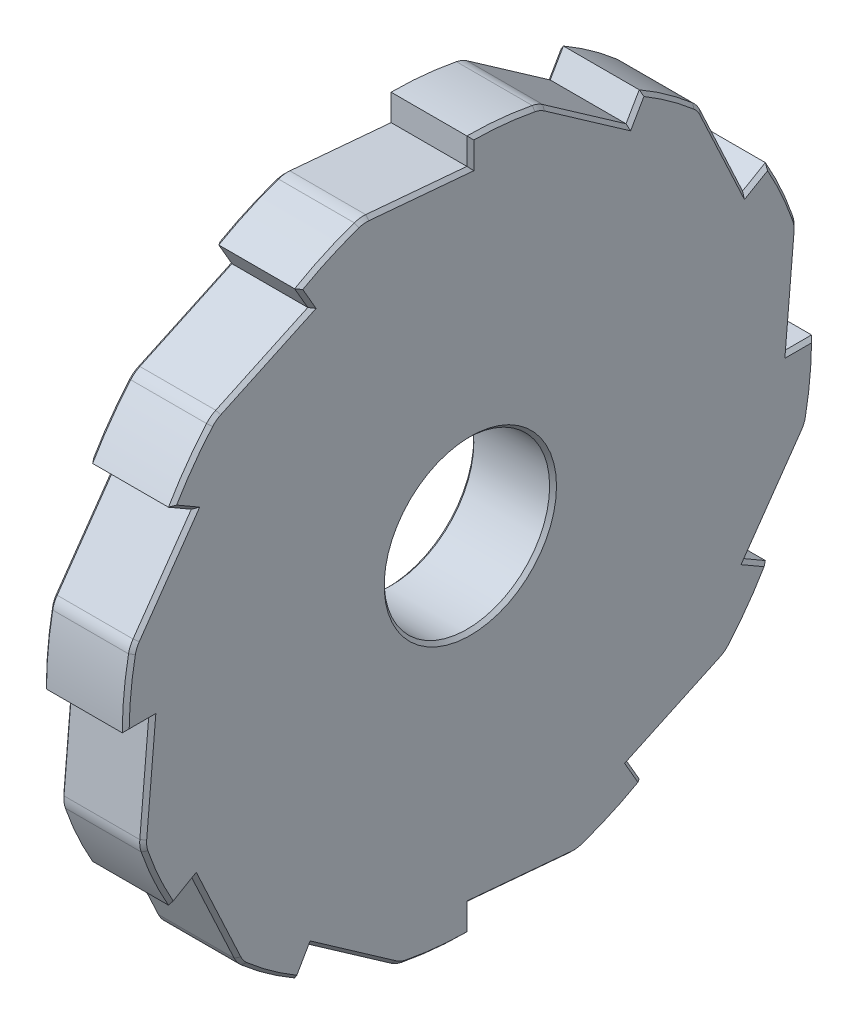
ISO-10303-21;
HEADER;
FILE_DESCRIPTION(('STEP AP214'),'2;1');
FILE_NAME('part.step','',(''),(''),'','','');
FILE_SCHEMA(('AUTOMOTIVE_DESIGN { 1 0 10303 214 1 1 1 1 }'));
ENDSEC;
DATA;
#1=APPLICATION_CONTEXT('core data for automotive mechanical design processes');
#2=APPLICATION_PROTOCOL_DEFINITION('international standard','automotive_design',2000,#1);
#3=PRODUCT_CONTEXT('',#1,'mechanical');
#4=PRODUCT('Part','Part','',(#3));
#5=PRODUCT_RELATED_PRODUCT_CATEGORY('part','',(#4));
#6=PRODUCT_DEFINITION_FORMATION('','',#4);
#7=PRODUCT_DEFINITION_CONTEXT('part definition',#1,'design');
#8=PRODUCT_DEFINITION('design','',#6,#7);
#9=PRODUCT_DEFINITION_SHAPE('','',#8);
#10=(LENGTH_UNIT() NAMED_UNIT(*) SI_UNIT(.MILLI.,.METRE.));
#11=(NAMED_UNIT(*) PLANE_ANGLE_UNIT() SI_UNIT($,.RADIAN.));
#12=(NAMED_UNIT(*) SI_UNIT($,.STERADIAN.) SOLID_ANGLE_UNIT());
#13=UNCERTAINTY_MEASURE_WITH_UNIT(LENGTH_MEASURE(1.E-05),#10,'distance_accuracy_value','');
#14=(GEOMETRIC_REPRESENTATION_CONTEXT(3) GLOBAL_UNCERTAINTY_ASSIGNED_CONTEXT((#13)) GLOBAL_UNIT_ASSIGNED_CONTEXT((#10,
#11,#12)) REPRESENTATION_CONTEXT('',''));
#15=CARTESIAN_POINT('',(0.,0.,0.));
#16=DIRECTION('',(0.,0.,1.));
#17=DIRECTION('',(1.,0.,0.));
#18=AXIS2_PLACEMENT_3D('',#15,#16,#17);
#19=CARTESIAN_POINT('',(6.,22.5830821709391,-4.35940359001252));
#20=DIRECTION('',(1.,0.,0.));
#21=DIRECTION('',(0.,0.,-1.));
#22=AXIS2_PLACEMENT_3D('',#19,#20,#21);
#23=PLANE('',#22);
#24=CARTESIAN_POINT('',(6.,0.,0.));
#25=DIRECTION('',(1.,0.,0.));
#26=DIRECTION('',(0.,0.,-1.));
#27=AXIS2_PLACEMENT_3D('',#24,#25,#26);
#28=CIRCLE('',#27,6.25000000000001);
#29=CARTESIAN_POINT('',(6.,0.,-6.25000000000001));
#30=VERTEX_POINT('',#29);
#31=EDGE_CURVE('E11',#30,#30,#28,.F.);
#32=ORIENTED_EDGE('',*,*,#31,.T.);
#33=EDGE_LOOP('',(#32));
#34=FACE_BOUND('',#33,.T.);
#35=DIRECTION('',(0.,-0.866025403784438,0.500000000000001));
#36=VECTOR('',#35,1.);
#37=CARTESIAN_POINT('',(6.,19.8695636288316,-11.7603730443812));
#38=LINE('',#37,#36);
#39=CARTESIAN_POINT('',(6.,21.3080352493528,-12.5908750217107));
#40=VERTEX_POINT('',#39);
#41=CARTESIAN_POINT('',(6.,19.6333028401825,-11.6239678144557));
#42=VERTEX_POINT('',#41);
#43=EDGE_CURVE('E47',#40,#42,#38,.T.);
#44=ORIENTED_EDGE('',*,*,#43,.T.);
#45=DIRECTION('',(0.,0.573526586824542,0.819186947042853));
#46=VECTOR('',#45,1.);
#47=CARTESIAN_POINT('',(6.,24.0166593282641,-5.36307511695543));
#48=LINE('',#47,#46);
#49=CARTESIAN_POINT('',(6.,24.0166593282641,-5.36307511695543));
#50=VERTEX_POINT('',#49);
#51=EDGE_CURVE('E39',#42,#50,#48,.T.);
#52=ORIENTED_EDGE('',*,*,#51,.T.);
#53=CARTESIAN_POINT('',(6.,22.5830821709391,-4.35940359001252));
#54=DIRECTION('',(1.,0.,0.));
#55=DIRECTION('',(0.,0.,-1.));
#56=AXIS2_PLACEMENT_3D('',#53,#54,#55);
#57=CIRCLE('',#56,1.74999999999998);
#58=CARTESIAN_POINT('',(6.,24.3013601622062,-4.69109734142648));
#59=VERTEX_POINT('',#58);
#60=EDGE_CURVE('E858',#50,#59,#57,.T.);
#61=ORIENTED_EDGE('',*,*,#60,.T.);
#62=CARTESIAN_POINT('',(6.,0.,0.));
#63=DIRECTION('',(1.,0.,0.));
#64=DIRECTION('',(0.,0.,-1.));
#65=AXIS2_PLACEMENT_3D('',#62,#63,#64);
#66=CIRCLE('',#65,24.75);
#67=CARTESIAN_POINT('',(6.,24.7487373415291,-0.250000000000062));
#68=VERTEX_POINT('',#67);
#69=EDGE_CURVE('E860',#59,#68,#66,.T.);
#70=ORIENTED_EDGE('',*,*,#69,.T.);
#71=DIRECTION('',(0.,-1.,-1.67823796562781E-13));
#72=VECTOR('',#71,1.);
#73=CARTESIAN_POINT('',(6.,23.0877333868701,-0.250000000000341));
#74=LINE('',#73,#72);
#75=CARTESIAN_POINT('',(6.,22.814922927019,-0.250000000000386));
#76=VERTEX_POINT('',#75);
#77=EDGE_CURVE('E862',#68,#76,#74,.T.);
#78=ORIENTED_EDGE('',*,*,#77,.T.);
#79=DIRECTION('',(0.,0.0870951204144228,0.996199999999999));
#80=VECTOR('',#79,1.);
#81=CARTESIAN_POINT('',(6.,23.480574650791,7.3637703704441));
#82=LINE('',#81,#80);
#83=CARTESIAN_POINT('',(6.,23.480574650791,7.36377037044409));
#84=VERTEX_POINT('',#83);
#85=EDGE_CURVE('E864',#76,#84,#82,.T.);
#86=ORIENTED_EDGE('',*,*,#85,.T.);
#87=CARTESIAN_POINT('',(6.,21.737224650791,7.51618683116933));
#88=DIRECTION('',(1.,0.,0.));
#89=DIRECTION('',(0.,0.,-1.));
#90=AXIS2_PLACEMENT_3D('',#87,#88,#89);
#91=CIRCLE('',#90,1.74999999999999);
#92=CARTESIAN_POINT('',(6.,23.391143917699,8.08807061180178));
#93=VERTEX_POINT('',#92);
#94=EDGE_CURVE('E866',#84,#93,#91,.T.);
#95=ORIENTED_EDGE('',*,*,#94,.T.);
#96=CARTESIAN_POINT('',(6.,0.,0.));
#97=DIRECTION('',(1.,0.,0.));
#98=DIRECTION('',(0.,0.,-1.));
#99=AXIS2_PLACEMENT_3D('',#96,#97,#98);
#100=CIRCLE('',#99,24.75);
#101=CARTESIAN_POINT('',(6.,21.558035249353,12.1578623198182));
#102=VERTEX_POINT('',#101);
#103=EDGE_CURVE('E868',#93,#102,#100,.T.);
#104=ORIENTED_EDGE('',*,*,#103,.T.);
#105=DIRECTION('',(0.,-0.866025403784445,-0.499999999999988));
#106=VECTOR('',#105,1.);
#107=CARTESIAN_POINT('',(6.,20.1195636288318,11.3273603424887));
#108=LINE('',#107,#106);
#109=CARTESIAN_POINT('',(6.,19.8833028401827,11.1909551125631));
#110=VERTEX_POINT('',#109);
#111=EDGE_CURVE('E870',#102,#110,#108,.T.);
#112=ORIENTED_EDGE('',*,*,#111,.T.);
#113=DIRECTION('',(0.,-0.422673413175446,0.906282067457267));
#114=VECTOR('',#113,1.);
#115=CARTESIAN_POINT('',(6.,16.6528889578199,18.1174995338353));
#116=LINE('',#115,#114);
#117=CARTESIAN_POINT('',(6.,16.6528889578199,18.1174995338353));
#118=VERTEX_POINT('',#117);
#119=EDGE_CURVE('E872',#110,#118,#116,.T.);
#120=ORIENTED_EDGE('',*,*,#119,.T.);
#121=CARTESIAN_POINT('',(6.,15.0668953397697,17.3778210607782));
#122=DIRECTION('',(1.,0.,0.));
#123=DIRECTION('',(0.,0.,-1.));
#124=AXIS2_PLACEMENT_3D('',#121,#122,#123);
#125=CIRCLE('',#124,1.74999999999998);
#126=CARTESIAN_POINT('',(6.,16.2132895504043,18.7000465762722));
#127=VERTEX_POINT('',#126);
#128=EDGE_CURVE('E874',#118,#127,#125,.T.);
#129=ORIENTED_EDGE('',*,*,#128,.T.);
#130=CARTESIAN_POINT('',(6.,0.,0.));
#131=DIRECTION('',(1.,0.,0.));
#132=DIRECTION('',(0.,0.,-1.));
#133=AXIS2_PLACEMENT_3D('',#130,#131,#132);
#134=CIRCLE('',#133,24.75);
#135=CARTESIAN_POINT('',(6.,12.5908750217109,21.3080352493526));
#136=VERTEX_POINT('',#135);
#137=EDGE_CURVE('E876',#127,#136,#134,.T.);
#138=ORIENTED_EDGE('',*,*,#137,.T.);
#139=DIRECTION('',(0.,-0.50000000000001,-0.866025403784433));
#140=VECTOR('',#139,1.);
#141=CARTESIAN_POINT('',(6.,11.7603730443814,19.8695636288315));
#142=LINE('',#141,#140);
#143=CARTESIAN_POINT('',(6.,11.6239678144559,19.6333028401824));
#144=VERTEX_POINT('',#143);
#145=EDGE_CURVE('E878',#136,#144,#142,.T.);
#146=ORIENTED_EDGE('',*,*,#145,.T.);
#147=DIRECTION('',(0.,-0.819186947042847,0.573526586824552));
#148=VECTOR('',#147,1.);
#149=CARTESIAN_POINT('',(6.,5.36307511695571,24.016659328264));
#150=LINE('',#149,#148);
#151=CARTESIAN_POINT('',(6.,5.36307511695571,24.016659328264));
#152=VERTEX_POINT('',#151);
#153=EDGE_CURVE('E880',#144,#152,#150,.T.);
#154=ORIENTED_EDGE('',*,*,#153,.T.);
#155=CARTESIAN_POINT('',(6.,4.35940359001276,22.583082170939));
#156=DIRECTION('',(1.,0.,0.));
#157=DIRECTION('',(0.,0.,-1.));
#158=AXIS2_PLACEMENT_3D('',#155,#156,#157);
#159=CIRCLE('',#158,1.74999999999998);
#160=CARTESIAN_POINT('',(6.,4.69109734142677,24.3013601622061));
#161=VERTEX_POINT('',#160);
#162=EDGE_CURVE('E882',#152,#161,#159,.T.);
#163=ORIENTED_EDGE('',*,*,#162,.T.);
#164=CARTESIAN_POINT('',(6.,0.,0.));
#165=DIRECTION('',(1.,0.,0.));
#166=DIRECTION('',(0.,0.,-1.));
#167=AXIS2_PLACEMENT_3D('',#164,#165,#166);
#168=CIRCLE('',#167,24.75);
#169=CARTESIAN_POINT('',(6.,0.250000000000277,24.7487373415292));
#170=VERTEX_POINT('',#169);
#171=EDGE_CURVE('E884',#161,#170,#168,.T.);
#172=ORIENTED_EDGE('',*,*,#171,.T.);
#173=DIRECTION('',(0.,0.,-1.));
#174=VECTOR('',#173,1.);
#175=CARTESIAN_POINT('',(6.,0.25000000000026,23.0877333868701));
#176=LINE('',#175,#174);
#177=CARTESIAN_POINT('',(6.,0.250000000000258,22.814922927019));
#178=VERTEX_POINT('',#177);
#179=EDGE_CURVE('E886',#170,#178,#176,.T.);
#180=ORIENTED_EDGE('',*,*,#179,.T.);
#181=DIRECTION('',(0.,-0.996199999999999,0.0870951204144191));
#182=VECTOR('',#181,1.);
#183=CARTESIAN_POINT('',(6.,-7.36377037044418,23.480574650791));
#184=LINE('',#183,#182);
#185=CARTESIAN_POINT('',(6.,-7.36377037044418,23.480574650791));
#186=VERTEX_POINT('',#185);
#187=EDGE_CURVE('E888',#178,#186,#184,.T.);
#188=ORIENTED_EDGE('',*,*,#187,.T.);
#189=CARTESIAN_POINT('',(6.,-7.51618683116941,21.737224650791));
#190=DIRECTION('',(1.,0.,0.));
#191=DIRECTION('',(0.,0.,-1.));
#192=AXIS2_PLACEMENT_3D('',#189,#190,#191);
#193=CIRCLE('',#192,1.74999999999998);
#194=CARTESIAN_POINT('',(6.,-8.08807061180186,23.391143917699));
#195=VERTEX_POINT('',#194);
#196=EDGE_CURVE('E890',#186,#195,#193,.T.);
#197=ORIENTED_EDGE('',*,*,#196,.T.);
#198=CARTESIAN_POINT('',(6.,0.,0.));
#199=DIRECTION('',(1.,0.,0.));
#200=DIRECTION('',(0.,0.,-1.));
#201=AXIS2_PLACEMENT_3D('',#198,#199,#200);
#202=CIRCLE('',#201,24.75);
#203=CARTESIAN_POINT('',(6.,-12.1578623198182,21.5580352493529));
#204=VERTEX_POINT('',#203);
#205=EDGE_CURVE('E892',#195,#204,#202,.T.);
#206=ORIENTED_EDGE('',*,*,#205,.T.);
#207=DIRECTION('',(0.,0.499999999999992,-0.866025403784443));
#208=VECTOR('',#207,1.);
#209=CARTESIAN_POINT('',(6.,-11.3273603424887,20.1195636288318));
#210=LINE('',#209,#208);
#211=CARTESIAN_POINT('',(6.,-11.1909551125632,19.8833028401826));
#212=VERTEX_POINT('',#211);
#213=EDGE_CURVE('E894',#204,#212,#210,.T.);
#214=ORIENTED_EDGE('',*,*,#213,.T.);
#215=DIRECTION('',(0.,-0.906282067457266,-0.422673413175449));
#216=VECTOR('',#215,1.);
#217=CARTESIAN_POINT('',(6.,-18.1174995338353,16.6528889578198));
#218=LINE('',#217,#216);
#219=CARTESIAN_POINT('',(6.,-18.1174995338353,16.6528889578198));
#220=VERTEX_POINT('',#219);
#221=EDGE_CURVE('E896',#212,#220,#218,.T.);
#222=ORIENTED_EDGE('',*,*,#221,.T.);
#223=CARTESIAN_POINT('',(6.,-17.3778210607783,15.0668953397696));
#224=DIRECTION('',(1.,0.,0.));
#225=DIRECTION('',(0.,0.,-1.));
#226=AXIS2_PLACEMENT_3D('',#223,#224,#225);
#227=CIRCLE('',#226,1.74999999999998);
#228=CARTESIAN_POINT('',(6.,-18.7000465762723,16.2132895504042));
#229=VERTEX_POINT('',#228);
#230=EDGE_CURVE('E898',#220,#229,#227,.T.);
#231=ORIENTED_EDGE('',*,*,#230,.T.);
#232=CARTESIAN_POINT('',(6.,0.,0.));
#233=DIRECTION('',(1.,0.,0.));
#234=DIRECTION('',(0.,0.,-1.));
#235=AXIS2_PLACEMENT_3D('',#232,#233,#234);
#236=CIRCLE('',#235,24.75);
#237=CARTESIAN_POINT('',(6.,-21.3080352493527,12.5908750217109));
#238=VERTEX_POINT('',#237);
#239=EDGE_CURVE('E900',#229,#238,#236,.T.);
#240=ORIENTED_EDGE('',*,*,#239,.T.);
#241=DIRECTION('',(0.,0.866025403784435,-0.500000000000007));
#242=VECTOR('',#241,1.);
#243=CARTESIAN_POINT('',(6.,-19.8695636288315,11.7603730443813));
#244=LINE('',#243,#242);
#245=CARTESIAN_POINT('',(6.,-19.6333028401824,11.6239678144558));
#246=VERTEX_POINT('',#245);
#247=EDGE_CURVE('E902',#238,#246,#244,.T.);
#248=ORIENTED_EDGE('',*,*,#247,.T.);
#249=DIRECTION('',(0.,-0.573526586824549,-0.819186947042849));
#250=VECTOR('',#249,1.);
#251=CARTESIAN_POINT('',(6.,-24.016659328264,5.36307511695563));
#252=LINE('',#251,#250);
#253=CARTESIAN_POINT('',(6.,-24.016659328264,5.36307511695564));
#254=VERTEX_POINT('',#253);
#255=EDGE_CURVE('E904',#246,#254,#252,.T.);
#256=ORIENTED_EDGE('',*,*,#255,.T.);
#257=CARTESIAN_POINT('',(6.,-22.583082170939,4.35940359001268));
#258=DIRECTION('',(1.,0.,0.));
#259=DIRECTION('',(0.,0.,-1.));
#260=AXIS2_PLACEMENT_3D('',#257,#258,#259);
#261=CIRCLE('',#260,1.74999999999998);
#262=CARTESIAN_POINT('',(6.,-24.3013601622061,4.69109734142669));
#263=VERTEX_POINT('',#262);
#264=EDGE_CURVE('E906',#254,#263,#261,.T.);
#265=ORIENTED_EDGE('',*,*,#264,.T.);
#266=CARTESIAN_POINT('',(6.,0.,0.));
#267=DIRECTION('',(1.,0.,0.));
#268=DIRECTION('',(0.,0.,-1.));
#269=AXIS2_PLACEMENT_3D('',#266,#267,#268);
#270=CIRCLE('',#269,24.75);
#271=CARTESIAN_POINT('',(6.,-24.7487373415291,0.250000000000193));
#272=VERTEX_POINT('',#271);
#273=EDGE_CURVE('E908',#263,#272,#270,.T.);
#274=ORIENTED_EDGE('',*,*,#273,.T.);
#275=DIRECTION('',(0.,1.,0.));
#276=VECTOR('',#275,1.);
#277=CARTESIAN_POINT('',(6.,-23.0877333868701,0.250000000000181));
#278=LINE('',#277,#276);
#279=CARTESIAN_POINT('',(6.,-22.814922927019,0.250000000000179));
#280=VERTEX_POINT('',#279);
#281=EDGE_CURVE('E910',#272,#280,#278,.T.);
#282=ORIENTED_EDGE('',*,*,#281,.T.);
#283=DIRECTION('',(0.,-0.0870951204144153,-0.996199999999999));
#284=VECTOR('',#283,1.);
#285=CARTESIAN_POINT('',(6.,-23.4805746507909,-7.36377037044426));
#286=LINE('',#285,#284);
#287=CARTESIAN_POINT('',(6.,-23.4805746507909,-7.36377037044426));
#288=VERTEX_POINT('',#287);
#289=EDGE_CURVE('E912',#280,#288,#286,.T.);
#290=ORIENTED_EDGE('',*,*,#289,.T.);
#291=CARTESIAN_POINT('',(6.,-21.737224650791,-7.51618683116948));
#292=DIRECTION('',(1.,0.,0.));
#293=DIRECTION('',(0.,0.,-1.));
#294=AXIS2_PLACEMENT_3D('',#291,#292,#293);
#295=CIRCLE('',#294,1.74999999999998);
#296=CARTESIAN_POINT('',(6.,-23.391143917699,-8.08807061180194));
#297=VERTEX_POINT('',#296);
#298=EDGE_CURVE('E914',#288,#297,#295,.T.);
#299=ORIENTED_EDGE('',*,*,#298,.T.);
#300=CARTESIAN_POINT('',(6.,0.,0.));
#301=DIRECTION('',(1.,0.,0.));
#302=DIRECTION('',(0.,0.,-1.));
#303=AXIS2_PLACEMENT_3D('',#300,#301,#302);
#304=CIRCLE('',#303,24.75);
#305=CARTESIAN_POINT('',(6.,-21.5580352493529,-12.1578623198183));
#306=VERTEX_POINT('',#305);
#307=EDGE_CURVE('E916',#297,#306,#304,.T.);
#308=ORIENTED_EDGE('',*,*,#307,.T.);
#309=DIRECTION('',(0.,0.866025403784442,0.499999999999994));
#310=VECTOR('',#309,1.);
#311=CARTESIAN_POINT('',(6.,-20.1195636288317,-11.3273603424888));
#312=LINE('',#311,#310);
#313=CARTESIAN_POINT('',(6.,-19.8833028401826,-11.1909551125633));
#314=VERTEX_POINT('',#313);
#315=EDGE_CURVE('E918',#306,#314,#312,.T.);
#316=ORIENTED_EDGE('',*,*,#315,.T.);
#317=DIRECTION('',(0.,0.422673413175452,-0.906282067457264));
#318=VECTOR('',#317,1.);
#319=CARTESIAN_POINT('',(6.,-16.6528889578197,-18.1174995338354));
#320=LINE('',#319,#318);
#321=CARTESIAN_POINT('',(6.,-16.6528889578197,-18.1174995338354));
#322=VERTEX_POINT('',#321);
#323=EDGE_CURVE('E920',#314,#322,#320,.T.);
#324=ORIENTED_EDGE('',*,*,#323,.T.);
#325=CARTESIAN_POINT('',(6.,-15.0668953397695,-17.3778210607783));
#326=DIRECTION('',(1.,0.,0.));
#327=DIRECTION('',(0.,0.,-1.));
#328=AXIS2_PLACEMENT_3D('',#325,#326,#327);
#329=CIRCLE('',#328,1.74999999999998);
#330=CARTESIAN_POINT('',(6.,-16.2132895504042,-18.7000465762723));
#331=VERTEX_POINT('',#330);
#332=EDGE_CURVE('E922',#322,#331,#329,.T.);
#333=ORIENTED_EDGE('',*,*,#332,.T.);
#334=CARTESIAN_POINT('',(6.,0.,0.));
#335=DIRECTION('',(1.,0.,0.));
#336=DIRECTION('',(0.,0.,-1.));
#337=AXIS2_PLACEMENT_3D('',#334,#335,#336);
#338=CIRCLE('',#337,24.75);
#339=CARTESIAN_POINT('',(6.,-12.5908750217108,-21.3080352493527));
#340=VERTEX_POINT('',#339);
#341=EDGE_CURVE('E924',#331,#340,#338,.T.);
#342=ORIENTED_EDGE('',*,*,#341,.T.);
#343=DIRECTION('',(0.,0.500000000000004,0.866025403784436));
#344=VECTOR('',#343,1.);
#345=CARTESIAN_POINT('',(6.,-11.7603730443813,-19.8695636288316));
#346=LINE('',#345,#344);
#347=CARTESIAN_POINT('',(6.,-11.6239678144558,-19.6333028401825));
#348=VERTEX_POINT('',#347);
#349=EDGE_CURVE('E926',#340,#348,#346,.T.);
#350=ORIENTED_EDGE('',*,*,#349,.T.);
#351=DIRECTION('',(0.,0.819186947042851,-0.573526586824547));
#352=VECTOR('',#351,1.);
#353=CARTESIAN_POINT('',(6.,-5.36307511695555,-24.016659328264));
#354=LINE('',#353,#352);
#355=CARTESIAN_POINT('',(6.,-5.36307511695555,-24.016659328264));
#356=VERTEX_POINT('',#355);
#357=EDGE_CURVE('E928',#348,#356,#354,.T.);
#358=ORIENTED_EDGE('',*,*,#357,.T.);
#359=CARTESIAN_POINT('',(6.,-4.3594035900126,-22.5830821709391));
#360=DIRECTION('',(1.,0.,0.));
#361=DIRECTION('',(0.,0.,-1.));
#362=AXIS2_PLACEMENT_3D('',#359,#360,#361);
#363=CIRCLE('',#362,1.74999999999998);
#364=CARTESIAN_POINT('',(6.,-4.6910973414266,-24.3013601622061));
#365=VERTEX_POINT('',#364);
#366=EDGE_CURVE('E930',#356,#365,#363,.T.);
#367=ORIENTED_EDGE('',*,*,#366,.T.);
#368=CARTESIAN_POINT('',(6.,0.,0.));
#369=DIRECTION('',(1.,0.,0.));
#370=DIRECTION('',(0.,0.,-1.));
#371=AXIS2_PLACEMENT_3D('',#368,#369,#370);
#372=CIRCLE('',#371,24.75);
#373=CARTESIAN_POINT('',(6.,-0.250000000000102,-24.7487373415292));
#374=VERTEX_POINT('',#373);
#375=EDGE_CURVE('E932',#365,#374,#372,.T.);
#376=ORIENTED_EDGE('',*,*,#375,.T.);
#377=DIRECTION('',(0.,0.,1.));
#378=VECTOR('',#377,1.);
#379=CARTESIAN_POINT('',(6.,-0.250000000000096,-23.0877333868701));
#380=LINE('',#379,#378);
#381=CARTESIAN_POINT('',(6.,-0.250000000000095,-22.8149229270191));
#382=VERTEX_POINT('',#381);
#383=EDGE_CURVE('E934',#374,#382,#380,.T.);
#384=ORIENTED_EDGE('',*,*,#383,.T.);
#385=DIRECTION('',(0.,0.9962,-0.087095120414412));
#386=VECTOR('',#385,1.);
#387=CARTESIAN_POINT('',(6.,7.36377037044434,-23.4805746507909));
#388=LINE('',#387,#386);
#389=CARTESIAN_POINT('',(6.,7.36377037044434,-23.4805746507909));
#390=VERTEX_POINT('',#389);
#391=EDGE_CURVE('E936',#382,#390,#388,.T.);
#392=ORIENTED_EDGE('',*,*,#391,.T.);
#393=CARTESIAN_POINT('',(6.,7.51618683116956,-21.7372246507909));
#394=DIRECTION('',(1.,0.,0.));
#395=DIRECTION('',(0.,0.,-1.));
#396=AXIS2_PLACEMENT_3D('',#393,#394,#395);
#397=CIRCLE('',#396,1.74999999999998);
#398=CARTESIAN_POINT('',(6.,8.08807061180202,-23.3911439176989));
#399=VERTEX_POINT('',#398);
#400=EDGE_CURVE('E938',#390,#399,#397,.T.);
#401=ORIENTED_EDGE('',*,*,#400,.T.);
#402=CARTESIAN_POINT('',(6.,0.,0.));
#403=DIRECTION('',(1.,0.,0.));
#404=DIRECTION('',(0.,0.,-1.));
#405=AXIS2_PLACEMENT_3D('',#402,#403,#404);
#406=CIRCLE('',#405,24.75);
#407=CARTESIAN_POINT('',(6.,12.1578623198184,-21.5580352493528));
#408=VERTEX_POINT('',#407);
#409=EDGE_CURVE('E940',#399,#408,#406,.T.);
#410=ORIENTED_EDGE('',*,*,#409,.T.);
#411=DIRECTION('',(0.,-0.499999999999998,0.86602540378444));
#412=VECTOR('',#411,1.);
#413=CARTESIAN_POINT('',(6.,11.3273603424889,-20.1195636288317));
#414=LINE('',#413,#412);
#415=CARTESIAN_POINT('',(6.,11.1909551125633,-19.8833028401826));
#416=VERTEX_POINT('',#415);
#417=EDGE_CURVE('E942',#408,#416,#414,.T.);
#418=ORIENTED_EDGE('',*,*,#417,.T.);
#419=DIRECTION('',(0.,0.906282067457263,0.422673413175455));
#420=VECTOR('',#419,1.);
#421=CARTESIAN_POINT('',(6.,18.1174995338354,-16.6528889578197));
#422=LINE('',#421,#420);
#423=CARTESIAN_POINT('',(6.,18.1174995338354,-16.6528889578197));
#424=VERTEX_POINT('',#423);
#425=EDGE_CURVE('E944',#416,#424,#422,.T.);
#426=ORIENTED_EDGE('',*,*,#425,.T.);
#427=CARTESIAN_POINT('',(6.,17.3778210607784,-15.0668953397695));
#428=DIRECTION('',(1.,0.,0.));
#429=DIRECTION('',(0.,0.,-1.));
#430=AXIS2_PLACEMENT_3D('',#427,#428,#429);
#431=CIRCLE('',#430,1.74999999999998);
#432=CARTESIAN_POINT('',(6.,18.7000465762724,-16.2132895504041));
#433=VERTEX_POINT('',#432);
#434=EDGE_CURVE('E946',#424,#433,#431,.T.);
#435=ORIENTED_EDGE('',*,*,#434,.T.);
#436=CARTESIAN_POINT('',(6.,0.,0.));
#437=DIRECTION('',(1.,0.,0.));
#438=DIRECTION('',(0.,0.,-1.));
#439=AXIS2_PLACEMENT_3D('',#436,#437,#438);
#440=CIRCLE('',#439,24.75);
#441=EDGE_CURVE('E52',#433,#40,#440,.T.);
#442=ORIENTED_EDGE('',*,*,#441,.T.);
#443=EDGE_LOOP('',(#44,#52,#61,#70,#78,#86,#95,#104,#112,#120,#129,#138,#146,#154,#163,#172,
#180,#188,#197,#206,#214,#222,#231,#240,#248,#256,#265,#274,#282,#290,#299,#308,#316,#324,#333,
#342,#350,#358,#367,#376,#384,#392,#401,#410,#418,#426,#435,#442));
#444=FACE_BOUND('',#443,.T.);
#445=ADVANCED_FACE('F30',(#34,#444),#23,.T.);
#446=CARTESIAN_POINT('',(0.,22.5830821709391,-4.35940359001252));
#447=DIRECTION('',(1.,0.,0.));
#448=DIRECTION('',(0.,0.,-1.));
#449=AXIS2_PLACEMENT_3D('',#446,#447,#448);
#450=PLANE('',#449);
#451=CARTESIAN_POINT('',(0.,0.,0.));
#452=DIRECTION('',(1.,0.,0.));
#453=DIRECTION('',(0.,0.,-1.));
#454=AXIS2_PLACEMENT_3D('',#451,#452,#453);
#455=CIRCLE('',#454,6.25000000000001);
#456=CARTESIAN_POINT('',(0.,0.,-6.25000000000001));
#457=VERTEX_POINT('',#456);
#458=EDGE_CURVE('E652',#457,#457,#455,.T.);
#459=ORIENTED_EDGE('',*,*,#458,.T.);
#460=EDGE_LOOP('',(#459));
#461=FACE_BOUND('',#460,.T.);
#462=DIRECTION('',(0.,1.,1.67823796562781E-13));
#463=VECTOR('',#462,1.);
#464=CARTESIAN_POINT('',(0.,22.5830821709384,-0.250000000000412));
#465=LINE('',#464,#463);
#466=CARTESIAN_POINT('',(0.,22.8149229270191,-0.250000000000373));
#467=VERTEX_POINT('',#466);
#468=CARTESIAN_POINT('',(0.,24.7487373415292,-0.250000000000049));
#469=VERTEX_POINT('',#468);
#470=EDGE_CURVE('E651',#467,#469,#465,.T.);
#471=ORIENTED_EDGE('',*,*,#470,.T.);
#472=CARTESIAN_POINT('',(0.,0.,0.));
#473=DIRECTION('',(1.,0.,0.));
#474=DIRECTION('',(0.,0.,-1.));
#475=AXIS2_PLACEMENT_3D('',#472,#473,#474);
#476=CIRCLE('',#475,24.75);
#477=CARTESIAN_POINT('',(0.,24.3013601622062,-4.69109734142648));
#478=VERTEX_POINT('',#477);
#479=EDGE_CURVE('E630',#469,#478,#476,.F.);
#480=ORIENTED_EDGE('',*,*,#479,.T.);
#481=CARTESIAN_POINT('',(0.,22.5830821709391,-4.35940359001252));
#482=DIRECTION('',(1.,0.,0.));
#483=DIRECTION('',(0.,0.,-1.));
#484=AXIS2_PLACEMENT_3D('',#481,#482,#483);
#485=CIRCLE('',#484,1.74999999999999);
#486=CARTESIAN_POINT('',(0.,24.0166593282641,-5.36307511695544));
#487=VERTEX_POINT('',#486);
#488=EDGE_CURVE('E640',#478,#487,#485,.F.);
#489=ORIENTED_EDGE('',*,*,#488,.T.);
#490=DIRECTION('',(0.,-0.573526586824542,-0.819186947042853));
#491=VECTOR('',#490,1.);
#492=CARTESIAN_POINT('',(0.,24.016659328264,-5.36307511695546));
#493=LINE('',#492,#491);
#494=CARTESIAN_POINT('',(0.,19.6333028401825,-11.6239678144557));
#495=VERTEX_POINT('',#494);
#496=EDGE_CURVE('E646',#487,#495,#493,.T.);
#497=ORIENTED_EDGE('',*,*,#496,.T.);
#498=DIRECTION('',(0.,0.866025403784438,-0.500000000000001));
#499=VECTOR('',#498,1.);
#500=CARTESIAN_POINT('',(0.,18.6999887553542,-11.0851186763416));
#501=LINE('',#500,#499);
#502=CARTESIAN_POINT('',(0.,21.3080352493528,-12.5908750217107));
#503=VERTEX_POINT('',#502);
#504=EDGE_CURVE('E2143',#495,#503,#501,.T.);
#505=ORIENTED_EDGE('',*,*,#504,.T.);
#506=CARTESIAN_POINT('',(0.,0.,0.));
#507=DIRECTION('',(1.,0.,0.));
#508=DIRECTION('',(0.,0.,-1.));
#509=AXIS2_PLACEMENT_3D('',#506,#507,#508);
#510=CIRCLE('',#509,24.75);
#511=CARTESIAN_POINT('',(0.,18.7000465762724,-16.2132895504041));
#512=VERTEX_POINT('',#511);
#513=EDGE_CURVE('E2145',#503,#512,#510,.F.);
#514=ORIENTED_EDGE('',*,*,#513,.T.);
#515=CARTESIAN_POINT('',(0.,17.3778210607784,-15.0668953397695));
#516=DIRECTION('',(1.,0.,0.));
#517=DIRECTION('',(0.,0.,-1.));
#518=AXIS2_PLACEMENT_3D('',#515,#516,#517);
#519=CIRCLE('',#518,1.74999999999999);
#520=CARTESIAN_POINT('',(0.,18.1174995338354,-16.6528889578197));
#521=VERTEX_POINT('',#520);
#522=EDGE_CURVE('E2147',#512,#521,#519,.F.);
#523=ORIENTED_EDGE('',*,*,#522,.T.);
#524=DIRECTION('',(0.,-0.906282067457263,-0.422673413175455));
#525=VECTOR('',#524,1.);
#526=CARTESIAN_POINT('',(0.,26.4944521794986,-12.7460311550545));
#527=LINE('',#526,#525);
#528=CARTESIAN_POINT('',(0.,11.1909551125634,-19.8833028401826));
#529=VERTEX_POINT('',#528);
#530=EDGE_CURVE('E2149',#521,#529,#527,.T.);
#531=ORIENTED_EDGE('',*,*,#530,.T.);
#532=DIRECTION('',(0.,0.499999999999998,-0.86602540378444));
#533=VECTOR('',#532,1.);
#534=CARTESIAN_POINT('',(0.,7.31694131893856,-13.1733141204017));
#535=LINE('',#534,#533);
#536=CARTESIAN_POINT('',(0.,12.1578623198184,-21.5580352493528));
#537=VERTEX_POINT('',#536);
#538=EDGE_CURVE('E2151',#529,#537,#535,.T.);
#539=ORIENTED_EDGE('',*,*,#538,.T.);
#540=CARTESIAN_POINT('',(0.,0.,0.));
#541=DIRECTION('',(1.,0.,0.));
#542=DIRECTION('',(0.,0.,-1.));
#543=AXIS2_PLACEMENT_3D('',#540,#541,#542);
#544=CIRCLE('',#543,24.75);
#545=CARTESIAN_POINT('',(0.,8.08807061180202,-23.3911439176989));
#546=VERTEX_POINT('',#545);
#547=EDGE_CURVE('E2153',#537,#546,#544,.F.);
#548=ORIENTED_EDGE('',*,*,#547,.T.);
#549=CARTESIAN_POINT('',(0.,7.51618683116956,-21.7372246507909));
#550=DIRECTION('',(1.,0.,0.));
#551=DIRECTION('',(0.,0.,-1.));
#552=AXIS2_PLACEMENT_3D('',#549,#550,#551);
#553=CIRCLE('',#552,1.74999999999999);
#554=CARTESIAN_POINT('',(0.,7.36377037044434,-23.4805746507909));
#555=VERTEX_POINT('',#554);
#556=EDGE_CURVE('E2155',#546,#555,#553,.F.);
#557=ORIENTED_EDGE('',*,*,#556,.T.);
#558=DIRECTION('',(0.,-0.9962,0.087095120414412));
#559=VECTOR('',#558,1.);
#560=CARTESIAN_POINT('',(0.,20.8086028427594,-24.6560206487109));
#561=LINE('',#560,#559);
#562=CARTESIAN_POINT('',(0.,-0.250000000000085,-22.8149229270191));
#563=VERTEX_POINT('',#562);
#564=EDGE_CURVE('E2157',#555,#563,#561,.T.);
#565=ORIENTED_EDGE('',*,*,#564,.T.);
#566=DIRECTION('',(0.,0.,-1.));
#567=VECTOR('',#566,1.);
#568=CARTESIAN_POINT('',(0.,-0.250000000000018,-4.35940359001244));
#569=LINE('',#568,#567);
#570=CARTESIAN_POINT('',(0.,-0.250000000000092,-24.7487373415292));
#571=VERTEX_POINT('',#570);
#572=EDGE_CURVE('E2159',#563,#571,#569,.T.);
#573=ORIENTED_EDGE('',*,*,#572,.T.);
#574=CARTESIAN_POINT('',(0.,0.,0.));
#575=DIRECTION('',(1.,0.,0.));
#576=DIRECTION('',(0.,0.,-1.));
#577=AXIS2_PLACEMENT_3D('',#574,#575,#576);
#578=CIRCLE('',#577,24.75);
#579=CARTESIAN_POINT('',(0.,-4.6910973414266,-24.3013601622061));
#580=VERTEX_POINT('',#579);
#581=EDGE_CURVE('E2161',#571,#580,#578,.F.);
#582=ORIENTED_EDGE('',*,*,#581,.T.);
#583=CARTESIAN_POINT('',(0.,-4.3594035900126,-22.5830821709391));
#584=DIRECTION('',(1.,0.,0.));
#585=DIRECTION('',(0.,0.,-1.));
#586=AXIS2_PLACEMENT_3D('',#583,#584,#585);
#587=CIRCLE('',#586,1.74999999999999);
#588=CARTESIAN_POINT('',(0.,-5.36307511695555,-24.016659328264));
#589=VERTEX_POINT('',#588);
#590=EDGE_CURVE('E2163',#580,#589,#587,.F.);
#591=ORIENTED_EDGE('',*,*,#590,.T.);
#592=DIRECTION('',(0.,-0.819186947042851,0.573526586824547));
#593=VECTOR('',#592,1.);
#594=CARTESIAN_POINT('',(0.,4.1551960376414,-30.6805613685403));
#595=LINE('',#594,#593);
#596=CARTESIAN_POINT('',(0.,-11.6239678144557,-19.6333028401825));
#597=VERTEX_POINT('',#596);
#598=EDGE_CURVE('E2165',#589,#597,#595,.T.);
#599=ORIENTED_EDGE('',*,*,#598,.T.);
#600=DIRECTION('',(0.,-0.500000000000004,-0.866025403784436));
#601=VECTOR('',#600,1.);
#602=CARTESIAN_POINT('',(0.,3.54158706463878,6.63420873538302));
#603=LINE('',#602,#601);
#604=CARTESIAN_POINT('',(0.,-12.5908750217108,-21.3080352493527));
#605=VERTEX_POINT('',#604);
#606=EDGE_CURVE('E2167',#597,#605,#603,.T.);
#607=ORIENTED_EDGE('',*,*,#606,.T.);
#608=CARTESIAN_POINT('',(0.,0.,0.));
#609=DIRECTION('',(1.,0.,0.));
#610=DIRECTION('',(0.,0.,-1.));
#611=AXIS2_PLACEMENT_3D('',#608,#609,#610);
#612=CIRCLE('',#611,24.75);
#613=CARTESIAN_POINT('',(0.,-16.2132895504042,-18.7000465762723));
#614=VERTEX_POINT('',#613);
#615=EDGE_CURVE('E2169',#605,#614,#612,.F.);
#616=ORIENTED_EDGE('',*,*,#615,.T.);
#617=CARTESIAN_POINT('',(0.,-15.0668953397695,-17.3778210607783));
#618=DIRECTION('',(1.,0.,0.));
#619=DIRECTION('',(0.,0.,-1.));
#620=AXIS2_PLACEMENT_3D('',#617,#618,#619);
#621=CIRCLE('',#620,1.74999999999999);
#622=CARTESIAN_POINT('',(0.,-16.6528889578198,-18.1174995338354));
#623=VERTEX_POINT('',#622);
#624=EDGE_CURVE('E2171',#614,#623,#621,.F.);
#625=ORIENTED_EDGE('',*,*,#624,.T.);
#626=DIRECTION('',(0.,-0.422673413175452,0.906282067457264));
#627=VECTOR('',#626,1.);
#628=CARTESIAN_POINT('',(0.,-14.9134668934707,-21.8471096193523));
#629=LINE('',#628,#627);
#630=CARTESIAN_POINT('',(0.,-19.8833028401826,-11.1909551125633));
#631=VERTEX_POINT('',#630);
#632=EDGE_CURVE('E2173',#623,#631,#629,.T.);
#633=ORIENTED_EDGE('',*,*,#632,.T.);
#634=DIRECTION('',(0.,-0.866025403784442,-0.499999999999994));
#635=VECTOR('',#634,1.);
#636=CARTESIAN_POINT('',(0.,14.9246345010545,8.90541688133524));
#637=LINE('',#636,#635);
#638=CARTESIAN_POINT('',(0.,-21.5580352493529,-12.1578623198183));
#639=VERTEX_POINT('',#638);
#640=EDGE_CURVE('E2175',#631,#639,#637,.T.);
#641=ORIENTED_EDGE('',*,*,#640,.T.);
#642=CARTESIAN_POINT('',(0.,0.,0.));
#643=DIRECTION('',(1.,0.,0.));
#644=DIRECTION('',(0.,0.,-1.));
#645=AXIS2_PLACEMENT_3D('',#642,#643,#644);
#646=CIRCLE('',#645,24.75);
#647=CARTESIAN_POINT('',(0.,-23.391143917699,-8.08807061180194));
#648=VERTEX_POINT('',#647);
#649=EDGE_CURVE('E2177',#639,#648,#646,.F.);
#650=ORIENTED_EDGE('',*,*,#649,.T.);
#651=CARTESIAN_POINT('',(0.,-21.737224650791,-7.51618683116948));
#652=DIRECTION('',(1.,0.,0.));
#653=DIRECTION('',(0.,0.,-1.));
#654=AXIS2_PLACEMENT_3D('',#651,#652,#653);
#655=CIRCLE('',#654,1.74999999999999);
#656=CARTESIAN_POINT('',(0.,-23.480574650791,-7.36377037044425));
#657=VERTEX_POINT('',#656);
#658=EDGE_CURVE('E2179',#648,#657,#655,.F.);
#659=ORIENTED_EDGE('',*,*,#658,.T.);
#660=DIRECTION('',(0.,0.0870951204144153,0.996199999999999));
#661=VECTOR('',#660,1.);
#662=CARTESIAN_POINT('',(0.,-22.8704846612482,-0.385518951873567));
#663=LINE('',#662,#661);
#664=CARTESIAN_POINT('',(0.,-22.8149229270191,0.250000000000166));
#665=VERTEX_POINT('',#664);
#666=EDGE_CURVE('E2181',#657,#665,#663,.T.);
#667=ORIENTED_EDGE('',*,*,#666,.T.);
#668=DIRECTION('',(0.,-1.,0.));
#669=VECTOR('',#668,1.);
#670=CARTESIAN_POINT('',(0.,22.5830821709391,0.249999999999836));
#671=LINE('',#670,#669);
#672=CARTESIAN_POINT('',(0.,-24.7487373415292,0.25000000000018));
#673=VERTEX_POINT('',#672);
#674=EDGE_CURVE('E2183',#665,#673,#671,.T.);
#675=ORIENTED_EDGE('',*,*,#674,.T.);
#676=CARTESIAN_POINT('',(0.,0.,0.));
#677=DIRECTION('',(1.,0.,0.));
#678=DIRECTION('',(0.,0.,-1.));
#679=AXIS2_PLACEMENT_3D('',#676,#677,#678);
#680=CIRCLE('',#679,24.75);
#681=CARTESIAN_POINT('',(0.,-24.3013601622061,4.69109734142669));
#682=VERTEX_POINT('',#681);
#683=EDGE_CURVE('E2185',#673,#682,#680,.F.);
#684=ORIENTED_EDGE('',*,*,#683,.T.);
#685=CARTESIAN_POINT('',(0.,-22.583082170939,4.35940359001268));
#686=DIRECTION('',(1.,0.,0.));
#687=DIRECTION('',(0.,0.,-1.));
#688=AXIS2_PLACEMENT_3D('',#685,#686,#687);
#689=CIRCLE('',#688,1.74999999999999);
#690=CARTESIAN_POINT('',(0.,-24.016659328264,5.36307511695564));
#691=VERTEX_POINT('',#690);
#692=EDGE_CURVE('E2187',#682,#691,#689,.F.);
#693=ORIENTED_EDGE('',*,*,#692,.T.);
#694=DIRECTION('',(0.,0.573526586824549,0.819186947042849));
#695=VECTOR('',#694,1.);
#696=CARTESIAN_POINT('',(0.,-13.2563467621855,20.7323845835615));
#697=LINE('',#696,#695);
#698=CARTESIAN_POINT('',(0.,-19.6333028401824,11.6239678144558));
#699=VERTEX_POINT('',#698);
#700=EDGE_CURVE('E2189',#691,#699,#697,.T.);
#701=ORIENTED_EDGE('',*,*,#700,.T.);
#702=DIRECTION('',(0.,-0.866025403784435,0.500000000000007));
#703=VECTOR('',#702,1.);
#704=CARTESIAN_POINT('',(0.,18.9499887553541,-10.6521059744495));
#705=LINE('',#704,#703);
#706=CARTESIAN_POINT('',(0.,-21.3080352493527,12.5908750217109));
#707=VERTEX_POINT('',#706);
#708=EDGE_CURVE('E2191',#699,#707,#705,.T.);
#709=ORIENTED_EDGE('',*,*,#708,.T.);
#710=CARTESIAN_POINT('',(0.,0.,0.));
#711=DIRECTION('',(1.,0.,0.));
#712=DIRECTION('',(0.,0.,-1.));
#713=AXIS2_PLACEMENT_3D('',#710,#711,#712);
#714=CIRCLE('',#713,24.75);
#715=CARTESIAN_POINT('',(0.,-18.7000465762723,16.2132895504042));
#716=VERTEX_POINT('',#715);
#717=EDGE_CURVE('E2193',#707,#716,#714,.F.);
#718=ORIENTED_EDGE('',*,*,#717,.T.);
#719=CARTESIAN_POINT('',(0.,-17.3778210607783,15.0668953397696));
#720=DIRECTION('',(1.,0.,0.));
#721=DIRECTION('',(0.,0.,-1.));
#722=AXIS2_PLACEMENT_3D('',#719,#720,#721);
#723=CIRCLE('',#722,1.75);
#724=CARTESIAN_POINT('',(0.,-18.1174995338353,16.6528889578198));
#725=VERTEX_POINT('',#724);
#726=EDGE_CURVE('E2195',#716,#725,#723,.F.);
#727=ORIENTED_EDGE('',*,*,#726,.T.);
#728=DIRECTION('',(0.,0.906282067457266,0.422673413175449));
#729=VECTOR('',#728,1.);
#730=CARTESIAN_POINT('',(0.,7.26281188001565,28.489802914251));
#731=LINE('',#730,#729);
#732=CARTESIAN_POINT('',(0.,-11.1909551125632,19.8833028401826));
#733=VERTEX_POINT('',#732);
#734=EDGE_CURVE('E2197',#725,#733,#731,.T.);
#735=ORIENTED_EDGE('',*,*,#734,.T.);
#736=DIRECTION('',(0.,-0.499999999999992,0.866025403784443));
#737=VECTOR('',#736,1.);
#738=CARTESIAN_POINT('',(0.,7.74995402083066,-12.9233141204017));
#739=LINE('',#738,#737);
#740=CARTESIAN_POINT('',(0.,-12.1578623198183,21.5580352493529));
#741=VERTEX_POINT('',#740);
#742=EDGE_CURVE('E2199',#733,#741,#739,.T.);
#743=ORIENTED_EDGE('',*,*,#742,.T.);
#744=CARTESIAN_POINT('',(0.,0.,0.));
#745=DIRECTION('',(1.,0.,0.));
#746=DIRECTION('',(0.,0.,-1.));
#747=AXIS2_PLACEMENT_3D('',#744,#745,#746);
#748=CIRCLE('',#747,24.75);
#749=CARTESIAN_POINT('',(0.,-8.08807061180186,23.391143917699));
#750=VERTEX_POINT('',#749);
#751=EDGE_CURVE('E2201',#741,#750,#748,.F.);
#752=ORIENTED_EDGE('',*,*,#751,.T.);
#753=CARTESIAN_POINT('',(0.,-7.51618683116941,21.737224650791));
#754=DIRECTION('',(1.,0.,0.));
#755=DIRECTION('',(0.,0.,-1.));
#756=AXIS2_PLACEMENT_3D('',#753,#754,#755);
#757=CIRCLE('',#756,1.75);
#758=CARTESIAN_POINT('',(0.,-7.36377037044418,23.480574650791));
#759=VERTEX_POINT('',#758);
#760=EDGE_CURVE('E2203',#750,#759,#757,.F.);
#761=ORIENTED_EDGE('',*,*,#760,.T.);
#762=DIRECTION('',(0.,0.996199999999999,-0.0870951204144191));
#763=VECTOR('',#762,1.);
#764=CARTESIAN_POINT('',(0.,24.7714308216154,20.6710793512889));
#765=LINE('',#764,#763);
#766=CARTESIAN_POINT('',(0.,0.250000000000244,22.8149229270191));
#767=VERTEX_POINT('',#766);
#768=EDGE_CURVE('E2205',#759,#767,#765,.T.);
#769=ORIENTED_EDGE('',*,*,#768,.T.);
#770=DIRECTION('',(0.,0.,1.));
#771=VECTOR('',#770,1.);
#772=CARTESIAN_POINT('',(0.,0.249999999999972,-4.3594035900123));
#773=LINE('',#772,#771);
#774=CARTESIAN_POINT('',(0.,0.250000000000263,24.7487373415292));
#775=VERTEX_POINT('',#774);
#776=EDGE_CURVE('E2207',#767,#775,#773,.T.);
#777=ORIENTED_EDGE('',*,*,#776,.T.);
#778=CARTESIAN_POINT('',(0.,0.,0.));
#779=DIRECTION('',(1.,0.,0.));
#780=DIRECTION('',(0.,0.,-1.));
#781=AXIS2_PLACEMENT_3D('',#778,#779,#780);
#782=CIRCLE('',#781,24.75);
#783=CARTESIAN_POINT('',(0.,4.69109734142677,24.3013601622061));
#784=VERTEX_POINT('',#783);
#785=EDGE_CURVE('E2209',#775,#784,#782,.F.);
#786=ORIENTED_EDGE('',*,*,#785,.T.);
#787=CARTESIAN_POINT('',(0.,4.35940359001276,22.583082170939));
#788=DIRECTION('',(1.,0.,0.));
#789=DIRECTION('',(0.,0.,-1.));
#790=AXIS2_PLACEMENT_3D('',#787,#788,#789);
#791=CIRCLE('',#790,1.74999999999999);
#792=CARTESIAN_POINT('',(0.,5.36307511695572,24.016659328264));
#793=VERTEX_POINT('',#792);
#794=EDGE_CURVE('E2211',#784,#793,#791,.F.);
#795=ORIENTED_EDGE('',*,*,#794,.T.);
#796=DIRECTION('',(0.,0.819186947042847,-0.573526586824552));
#797=VECTOR('',#796,1.);
#798=CARTESIAN_POINT('',(0.,30.2506557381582,6.59244472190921));
#799=LINE('',#798,#797);
#800=CARTESIAN_POINT('',(0.,11.6239678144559,19.6333028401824));
#801=VERTEX_POINT('',#800);
#802=EDGE_CURVE('E2213',#793,#801,#799,.T.);
#803=ORIENTED_EDGE('',*,*,#802,.T.);
#804=DIRECTION('',(0.,0.50000000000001,0.866025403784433));
#805=VECTOR('',#804,1.);
#806=CARTESIAN_POINT('',(0.,3.97459976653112,6.3842087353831));
#807=LINE('',#806,#805);
#808=CARTESIAN_POINT('',(0.,12.5908750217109,21.3080352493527));
#809=VERTEX_POINT('',#808);
#810=EDGE_CURVE('E2215',#801,#809,#807,.T.);
#811=ORIENTED_EDGE('',*,*,#810,.T.);
#812=CARTESIAN_POINT('',(0.,0.,0.));
#813=DIRECTION('',(1.,0.,0.));
#814=DIRECTION('',(0.,0.,-1.));
#815=AXIS2_PLACEMENT_3D('',#812,#813,#814);
#816=CIRCLE('',#815,24.75);
#817=CARTESIAN_POINT('',(0.,16.2132895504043,18.7000465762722));
#818=VERTEX_POINT('',#817);
#819=EDGE_CURVE('E2217',#809,#818,#816,.F.);
#820=ORIENTED_EDGE('',*,*,#819,.T.);
#821=CARTESIAN_POINT('',(0.,15.0668953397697,17.3778210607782));
#822=DIRECTION('',(1.,0.,0.));
#823=DIRECTION('',(0.,0.,-1.));
#824=AXIS2_PLACEMENT_3D('',#821,#822,#823);
#825=CIRCLE('',#824,1.75);
#826=CARTESIAN_POINT('',(0.,16.6528889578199,18.1174995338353));
#827=VERTEX_POINT('',#826);
#828=EDGE_CURVE('E2219',#818,#827,#825,.F.);
#829=ORIENTED_EDGE('',*,*,#828,.T.);
#830=DIRECTION('',(0.,0.422673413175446,-0.906282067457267));
#831=VECTOR('',#830,1.);
#832=CARTESIAN_POINT('',(0.,26.3223671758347,-2.61546931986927));
#833=LINE('',#832,#831);
#834=CARTESIAN_POINT('',(0.,19.8833028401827,11.1909551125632));
#835=VERTEX_POINT('',#834);
#836=EDGE_CURVE('E2221',#827,#835,#833,.T.);
#837=ORIENTED_EDGE('',*,*,#836,.T.);
#838=DIRECTION('',(0.,0.866025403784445,0.499999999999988));
#839=VECTOR('',#838,1.);
#840=CARTESIAN_POINT('',(0.,15.1746345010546,8.472404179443));
#841=LINE('',#840,#839);
#842=CARTESIAN_POINT('',(0.,21.558035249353,12.1578623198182));
#843=VERTEX_POINT('',#842);
#844=EDGE_CURVE('E2223',#835,#843,#841,.T.);
#845=ORIENTED_EDGE('',*,*,#844,.T.);
#846=CARTESIAN_POINT('',(0.,0.,0.));
#847=DIRECTION('',(1.,0.,0.));
#848=DIRECTION('',(0.,0.,-1.));
#849=AXIS2_PLACEMENT_3D('',#846,#847,#848);
#850=CIRCLE('',#849,24.75);
#851=CARTESIAN_POINT('',(0.,23.391143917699,8.08807061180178));
#852=VERTEX_POINT('',#851);
#853=EDGE_CURVE('E2225',#843,#852,#850,.F.);
#854=ORIENTED_EDGE('',*,*,#853,.T.);
#855=CARTESIAN_POINT('',(0.,21.737224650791,7.51618683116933));
#856=DIRECTION('',(1.,0.,0.));
#857=DIRECTION('',(0.,0.,-1.));
#858=AXIS2_PLACEMENT_3D('',#855,#856,#857);
#859=CIRCLE('',#858,1.75);
#860=CARTESIAN_POINT('',(0.,23.480574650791,7.36377037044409));
#861=VERTEX_POINT('',#860);
#862=EDGE_CURVE('E2227',#852,#861,#859,.F.);
#863=ORIENTED_EDGE('',*,*,#862,.T.);
#864=DIRECTION('',(0.,-0.0870951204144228,-0.996199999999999));
#865=VECTOR('',#864,1.);
#866=CARTESIAN_POINT('',(0.,22.4566153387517,-4.34834693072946));
#867=LINE('',#866,#865);
#868=EDGE_CURVE('E657',#861,#467,#867,.T.);
#869=ORIENTED_EDGE('',*,*,#868,.T.);
#870=EDGE_LOOP('',(#471,#480,#489,#497,#505,#514,#523,#531,#539,#548,#557,#565,#573,#582,#591,
#599,#607,#616,#625,#633,#641,#650,#659,#667,#675,#684,#693,#701,#709,#718,#727,#735,#743,#752,
#761,#769,#777,#786,#795,#803,#811,#820,#829,#837,#845,#854,#863,#869));
#871=FACE_BOUND('',#870,.T.);
#872=ADVANCED_FACE('F649',(#461,#871),#450,.F.);
#873=CARTESIAN_POINT('',(6.,22.5830821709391,-4.35940359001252));
#874=DIRECTION('',(-1.,0.,0.));
#875=DIRECTION('',(0.,0.,1.));
#876=AXIS2_PLACEMENT_3D('',#873,#874,#875);
#877=CYLINDRICAL_SURFACE('',#876,2.);
#878=DIRECTION('',(-1.,0.,0.));
#879=VECTOR('',#878,1.);
#880=CARTESIAN_POINT('',(6.,24.2214560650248,-5.50645676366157));
#881=LINE('',#880,#879);
#882=CARTESIAN_POINT('',(5.74999999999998,24.2214560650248,-5.50645676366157));
#883=VERTEX_POINT('',#882);
#884=CARTESIAN_POINT('',(0.249999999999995,24.2214560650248,-5.50645676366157));
#885=VERTEX_POINT('',#884);
#886=EDGE_CURVE('E1244',#883,#885,#881,.T.);
#887=ORIENTED_EDGE('',*,*,#886,.T.);
#888=CARTESIAN_POINT('',(0.249999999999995,22.5830821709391,-4.35940359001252));
#889=DIRECTION('',(1.,0.,0.));
#890=DIRECTION('',(0.,0.,-1.));
#891=AXIS2_PLACEMENT_3D('',#888,#889,#890);
#892=CIRCLE('',#891,2.);
#893=CARTESIAN_POINT('',(0.249999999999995,24.5468284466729,-4.73848216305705));
#894=VERTEX_POINT('',#893);
#895=EDGE_CURVE('E856',#885,#894,#892,.T.);
#896=ORIENTED_EDGE('',*,*,#895,.T.);
#897=DIRECTION('',(-1.,0.,0.));
#898=VECTOR('',#897,1.);
#899=CARTESIAN_POINT('',(6.,24.5468284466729,-4.73848216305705));
#900=LINE('',#899,#898);
#901=CARTESIAN_POINT('',(5.74999999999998,24.5468284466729,-4.73848216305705));
#902=VERTEX_POINT('',#901);
#903=EDGE_CURVE('E647',#902,#894,#900,.T.);
#904=ORIENTED_EDGE('',*,*,#903,.F.);
#905=CARTESIAN_POINT('',(5.74999999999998,22.5830821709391,-4.35940359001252));
#906=DIRECTION('',(1.,0.,0.));
#907=DIRECTION('',(0.,0.,-1.));
#908=AXIS2_PLACEMENT_3D('',#905,#906,#907);
#909=CIRCLE('',#908,2.);
#910=EDGE_CURVE('E854',#902,#883,#909,.F.);
#911=ORIENTED_EDGE('',*,*,#910,.T.);
#912=EDGE_LOOP('',(#887,#896,#904,#911));
#913=FACE_BOUND('',#912,.T.);
#914=ADVANCED_FACE('F1548',(#913),#877,.T.);
#915=CARTESIAN_POINT('',(6.,0.,0.));
#916=DIRECTION('',(-1.,0.,0.));
#917=DIRECTION('',(0.,0.,1.));
#918=AXIS2_PLACEMENT_3D('',#915,#916,#917);
#919=CYLINDRICAL_SURFACE('',#918,25.);
#920=ORIENTED_EDGE('',*,*,#903,.T.);
#921=CARTESIAN_POINT('',(0.249999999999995,0.,0.));
#922=DIRECTION('',(1.,0.,0.));
#923=DIRECTION('',(0.,0.,-1.));
#924=AXIS2_PLACEMENT_3D('',#921,#922,#923);
#925=CIRCLE('',#924,25.);
#926=CARTESIAN_POINT('',(0.249999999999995,25.,0.));
#927=VERTEX_POINT('',#926);
#928=EDGE_CURVE('E633',#894,#927,#925,.T.);
#929=ORIENTED_EDGE('',*,*,#928,.T.);
#930=DIRECTION('',(-1.,0.,0.));
#931=VECTOR('',#930,1.);
#932=CARTESIAN_POINT('',(6.,25.,0.));
#933=LINE('',#932,#931);
#934=CARTESIAN_POINT('',(5.74999999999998,25.,0.));
#935=VERTEX_POINT('',#934);
#936=EDGE_CURVE('E2137',#935,#927,#933,.T.);
#937=ORIENTED_EDGE('',*,*,#936,.F.);
#938=CARTESIAN_POINT('',(5.74999999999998,0.,0.));
#939=DIRECTION('',(1.,0.,0.));
#940=DIRECTION('',(0.,0.,-1.));
#941=AXIS2_PLACEMENT_3D('',#938,#939,#940);
#942=CIRCLE('',#941,25.);
#943=EDGE_CURVE('E666',#935,#902,#942,.F.);
#944=ORIENTED_EDGE('',*,*,#943,.T.);
#945=EDGE_LOOP('',(#920,#929,#937,#944));
#946=FACE_BOUND('',#945,.T.);
#947=ADVANCED_FACE('F1737',(#946),#919,.T.);
#948=CARTESIAN_POINT('',(6.,25.,0.));
#949=DIRECTION('',(0.,1.67823796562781E-13,-1.));
#950=DIRECTION('',(0.,1.,1.67823796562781E-13));
#951=AXIS2_PLACEMENT_3D('',#948,#949,#950);
#952=PLANE('',#951);
#953=ORIENTED_EDGE('',*,*,#936,.T.);
#954=DIRECTION('',(0.,-1.,-1.67823796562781E-13));
#955=VECTOR('',#954,1.);
#956=CARTESIAN_POINT('',(0.249999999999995,25.,0.));
#957=LINE('',#956,#955);
#958=CARTESIAN_POINT('',(0.249999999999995,23.0877333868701,-3.20923843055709E-13));
#959=VERTEX_POINT('',#958);
#960=EDGE_CURVE('E671',#927,#959,#957,.T.);
#961=ORIENTED_EDGE('',*,*,#960,.T.);
#962=DIRECTION('',(-1.,0.,0.));
#963=VECTOR('',#962,1.);
#964=CARTESIAN_POINT('',(6.,23.0877333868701,-3.20923843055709E-13));
#965=LINE('',#964,#963);
#966=CARTESIAN_POINT('',(5.74999999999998,23.0877333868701,-3.20923843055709E-13));
#967=VERTEX_POINT('',#966);
#968=EDGE_CURVE('E2134',#967,#959,#965,.T.);
#969=ORIENTED_EDGE('',*,*,#968,.F.);
#970=DIRECTION('',(0.,1.,1.67823796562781E-13));
#971=VECTOR('',#970,1.);
#972=CARTESIAN_POINT('',(5.74999999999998,25.,0.));
#973=LINE('',#972,#971);
#974=EDGE_CURVE('E669',#967,#935,#973,.T.);
#975=ORIENTED_EDGE('',*,*,#974,.T.);
#976=EDGE_LOOP('',(#953,#961,#969,#975));
#977=FACE_BOUND('',#976,.T.);
#978=ADVANCED_FACE('F1733',(#977),#952,.F.);
#979=CARTESIAN_POINT('',(6.,23.729624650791,7.34199659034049));
#980=DIRECTION('',(0.,-0.996199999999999,0.0870951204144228));
#981=DIRECTION('',(0.,-0.0870951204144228,-0.996199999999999));
#982=AXIS2_PLACEMENT_3D('',#979,#980,#981);
#983=PLANE('',#982);
#984=ORIENTED_EDGE('',*,*,#968,.T.);
#985=DIRECTION('',(0.,0.0870951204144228,0.996199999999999));
#986=VECTOR('',#985,1.);
#987=CARTESIAN_POINT('',(0.249999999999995,23.729624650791,7.34199659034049));
#988=LINE('',#987,#986);
#989=CARTESIAN_POINT('',(0.249999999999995,23.729624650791,7.34199659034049));
#990=VERTEX_POINT('',#989);
#991=EDGE_CURVE('E675',#959,#990,#988,.T.);
#992=ORIENTED_EDGE('',*,*,#991,.T.);
#993=DIRECTION('',(-1.,0.,0.));
#994=VECTOR('',#993,1.);
#995=CARTESIAN_POINT('',(6.,23.729624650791,7.34199659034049));
#996=LINE('',#995,#994);
#997=CARTESIAN_POINT('',(5.74999999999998,23.729624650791,7.34199659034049));
#998=VERTEX_POINT('',#997);
#999=EDGE_CURVE('E2131',#998,#990,#996,.T.);
#1000=ORIENTED_EDGE('',*,*,#999,.F.);
#1001=DIRECTION('',(0.,-0.0870951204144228,-0.996199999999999));
#1002=VECTOR('',#1001,1.);
#1003=CARTESIAN_POINT('',(5.74999999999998,23.0877333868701,-3.20924460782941E-13));
#1004=LINE('',#1003,#1002);
#1005=EDGE_CURVE('E673',#998,#967,#1004,.T.);
#1006=ORIENTED_EDGE('',*,*,#1005,.T.);
#1007=EDGE_LOOP('',(#984,#992,#1000,#1006));
#1008=FACE_BOUND('',#1007,.T.);
#1009=ADVANCED_FACE('F1729',(#1008),#983,.F.);
#1010=CARTESIAN_POINT('',(6.,21.737224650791,7.51618683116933));
#1011=DIRECTION('',(-1.,0.,0.));
#1012=DIRECTION('',(0.,0.,1.));
#1013=AXIS2_PLACEMENT_3D('',#1010,#1011,#1012);
#1014=CYLINDRICAL_SURFACE('',#1013,2.);
#1015=ORIENTED_EDGE('',*,*,#999,.T.);
#1016=CARTESIAN_POINT('',(0.249999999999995,21.737224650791,7.51618683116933));
#1017=DIRECTION('',(1.,0.,0.));
#1018=DIRECTION('',(0.,0.,-1.));
#1019=AXIS2_PLACEMENT_3D('',#1016,#1017,#1018);
#1020=CIRCLE('',#1019,2.);
#1021=CARTESIAN_POINT('',(0.249999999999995,23.6274180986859,8.16976829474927));
#1022=VERTEX_POINT('',#1021);
#1023=EDGE_CURVE('E679',#990,#1022,#1020,.T.);
#1024=ORIENTED_EDGE('',*,*,#1023,.T.);
#1025=DIRECTION('',(-1.,0.,0.));
#1026=VECTOR('',#1025,1.);
#1027=CARTESIAN_POINT('',(6.,23.6274180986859,8.16976829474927));
#1028=LINE('',#1027,#1026);
#1029=CARTESIAN_POINT('',(5.74999999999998,23.6274180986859,8.16976829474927));
#1030=VERTEX_POINT('',#1029);
#1031=EDGE_CURVE('E2128',#1030,#1022,#1028,.T.);
#1032=ORIENTED_EDGE('',*,*,#1031,.F.);
#1033=CARTESIAN_POINT('',(5.74999999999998,21.737224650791,7.51618683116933));
#1034=DIRECTION('',(1.,0.,0.));
#1035=DIRECTION('',(0.,0.,-1.));
#1036=AXIS2_PLACEMENT_3D('',#1033,#1034,#1035);
#1037=CIRCLE('',#1036,2.);
#1038=EDGE_CURVE('E677',#1030,#998,#1037,.F.);
#1039=ORIENTED_EDGE('',*,*,#1038,.T.);
#1040=EDGE_LOOP('',(#1015,#1024,#1032,#1039));
#1041=FACE_BOUND('',#1040,.T.);
#1042=ADVANCED_FACE('F1725',(#1041),#1014,.T.);
#1043=CARTESIAN_POINT('',(6.,0.,0.));
#1044=DIRECTION('',(-1.,0.,0.));
#1045=DIRECTION('',(0.,0.,1.));
#1046=AXIS2_PLACEMENT_3D('',#1043,#1044,#1045);
#1047=CYLINDRICAL_SURFACE('',#1046,25.);
#1048=ORIENTED_EDGE('',*,*,#1031,.T.);
#1049=CARTESIAN_POINT('',(0.249999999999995,0.,0.));
#1050=DIRECTION('',(1.,0.,0.));
#1051=DIRECTION('',(0.,0.,-1.));
#1052=AXIS2_PLACEMENT_3D('',#1049,#1050,#1051);
#1053=CIRCLE('',#1052,25.);
#1054=CARTESIAN_POINT('',(0.249999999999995,21.6506350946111,12.4999999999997));
#1055=VERTEX_POINT('',#1054);
#1056=EDGE_CURVE('E683',#1022,#1055,#1053,.T.);
#1057=ORIENTED_EDGE('',*,*,#1056,.T.);
#1058=DIRECTION('',(-1.,0.,0.));
#1059=VECTOR('',#1058,1.);
#1060=CARTESIAN_POINT('',(6.,21.6506350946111,12.4999999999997));
#1061=LINE('',#1060,#1059);
#1062=CARTESIAN_POINT('',(5.74999999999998,21.6506350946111,12.4999999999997));
#1063=VERTEX_POINT('',#1062);
#1064=EDGE_CURVE('E2125',#1063,#1055,#1061,.T.);
#1065=ORIENTED_EDGE('',*,*,#1064,.F.);
#1066=CARTESIAN_POINT('',(5.74999999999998,0.,0.));
#1067=DIRECTION('',(1.,0.,0.));
#1068=DIRECTION('',(0.,0.,-1.));
#1069=AXIS2_PLACEMENT_3D('',#1066,#1067,#1068);
#1070=CIRCLE('',#1069,25.);
#1071=EDGE_CURVE('E681',#1063,#1030,#1070,.F.);
#1072=ORIENTED_EDGE('',*,*,#1071,.T.);
#1073=EDGE_LOOP('',(#1048,#1057,#1065,#1072));
#1074=FACE_BOUND('',#1073,.T.);
#1075=ADVANCED_FACE('F1721',(#1074),#1047,.T.);
#1076=CARTESIAN_POINT('',(6.,21.6506350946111,12.4999999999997));
#1077=DIRECTION('',(0.,0.499999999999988,-0.866025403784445));
#1078=DIRECTION('',(0.,0.866025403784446,0.499999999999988));
#1079=AXIS2_PLACEMENT_3D('',#1076,#1077,#1078);
#1080=PLANE('',#1079);
#1081=ORIENTED_EDGE('',*,*,#1064,.T.);
#1082=DIRECTION('',(0.,-0.866025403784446,-0.499999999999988));
#1083=VECTOR('',#1082,1.);
#1084=CARTESIAN_POINT('',(0.249999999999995,21.6506350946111,12.4999999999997));
#1085=LINE('',#1084,#1083);
#1086=CARTESIAN_POINT('',(0.249999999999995,19.9945636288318,11.5438666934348));
#1087=VERTEX_POINT('',#1086);
#1088=EDGE_CURVE('E687',#1055,#1087,#1085,.T.);
#1089=ORIENTED_EDGE('',*,*,#1088,.T.);
#1090=DIRECTION('',(-1.,0.,0.));
#1091=VECTOR('',#1090,1.);
#1092=CARTESIAN_POINT('',(6.,19.9945636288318,11.5438666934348));
#1093=LINE('',#1092,#1091);
#1094=CARTESIAN_POINT('',(5.74999999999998,19.9945636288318,11.5438666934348));
#1095=VERTEX_POINT('',#1094);
#1096=EDGE_CURVE('E2122',#1095,#1087,#1093,.T.);
#1097=ORIENTED_EDGE('',*,*,#1096,.F.);
#1098=DIRECTION('',(0.,0.866025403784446,0.499999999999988));
#1099=VECTOR('',#1098,1.);
#1100=CARTESIAN_POINT('',(5.74999999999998,21.6506350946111,12.4999999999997));
#1101=LINE('',#1100,#1099);
#1102=EDGE_CURVE('E685',#1095,#1063,#1101,.T.);
#1103=ORIENTED_EDGE('',*,*,#1102,.T.);
#1104=EDGE_LOOP('',(#1081,#1089,#1097,#1103));
#1105=FACE_BOUND('',#1104,.T.);
#1106=ADVANCED_FACE('F1717',(#1105),#1080,.F.);
#1107=CARTESIAN_POINT('',(6.,16.8794594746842,18.2231678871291));
#1108=DIRECTION('',(0.,-0.906282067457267,-0.422673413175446));
#1109=DIRECTION('',(0.,0.422673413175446,-0.906282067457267));
#1110=AXIS2_PLACEMENT_3D('',#1107,#1108,#1109);
#1111=PLANE('',#1110);
#1112=ORIENTED_EDGE('',*,*,#1096,.T.);
#1113=DIRECTION('',(0.,-0.422673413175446,0.906282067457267));
#1114=VECTOR('',#1113,1.);
#1115=CARTESIAN_POINT('',(0.249999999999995,16.8794594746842,18.2231678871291));
#1116=LINE('',#1115,#1114);
#1117=CARTESIAN_POINT('',(0.249999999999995,16.8794594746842,18.2231678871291));
#1118=VERTEX_POINT('',#1117);
#1119=EDGE_CURVE('E691',#1087,#1118,#1116,.T.);
#1120=ORIENTED_EDGE('',*,*,#1119,.T.);
#1121=DIRECTION('',(-1.,0.,0.));
#1122=VECTOR('',#1121,1.);
#1123=CARTESIAN_POINT('',(6.,16.8794594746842,18.2231678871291));
#1124=LINE('',#1123,#1122);
#1125=CARTESIAN_POINT('',(5.74999999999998,16.8794594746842,18.2231678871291));
#1126=VERTEX_POINT('',#1125);
#1127=EDGE_CURVE('E2119',#1126,#1118,#1124,.T.);
#1128=ORIENTED_EDGE('',*,*,#1127,.F.);
#1129=DIRECTION('',(0.,0.422673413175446,-0.906282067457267));
#1130=VECTOR('',#1129,1.);
#1131=CARTESIAN_POINT('',(5.74999999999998,19.9945636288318,11.5438666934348));
#1132=LINE('',#1131,#1130);
#1133=EDGE_CURVE('E689',#1126,#1095,#1132,.T.);
#1134=ORIENTED_EDGE('',*,*,#1133,.T.);
#1135=EDGE_LOOP('',(#1112,#1120,#1128,#1134));
#1136=FACE_BOUND('',#1135,.T.);
#1137=ADVANCED_FACE('F1713',(#1136),#1111,.F.);
#1138=CARTESIAN_POINT('',(6.,15.0668953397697,17.3778210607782));
#1139=DIRECTION('',(-1.,0.,0.));
#1140=DIRECTION('',(0.,0.,1.));
#1141=AXIS2_PLACEMENT_3D('',#1138,#1139,#1140);
#1142=CYLINDRICAL_SURFACE('',#1141,2.);
#1143=ORIENTED_EDGE('',*,*,#1127,.T.);
#1144=CARTESIAN_POINT('',(0.249999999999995,15.0668953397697,17.3778210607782));
#1145=DIRECTION('',(1.,0.,0.));
#1146=DIRECTION('',(0.,0.,-1.));
#1147=AXIS2_PLACEMENT_3D('',#1144,#1145,#1146);
#1148=CIRCLE('',#1147,2.);
#1149=CARTESIAN_POINT('',(0.249999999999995,16.3770601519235,18.8889359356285));
#1150=VERTEX_POINT('',#1149);
#1151=EDGE_CURVE('E695',#1118,#1150,#1148,.T.);
#1152=ORIENTED_EDGE('',*,*,#1151,.T.);
#1153=DIRECTION('',(-1.,0.,0.));
#1154=VECTOR('',#1153,1.);
#1155=CARTESIAN_POINT('',(6.,16.3770601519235,18.8889359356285));
#1156=LINE('',#1155,#1154);
#1157=CARTESIAN_POINT('',(5.74999999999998,16.3770601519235,18.8889359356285));
#1158=VERTEX_POINT('',#1157);
#1159=EDGE_CURVE('E2116',#1158,#1150,#1156,.T.);
#1160=ORIENTED_EDGE('',*,*,#1159,.F.);
#1161=CARTESIAN_POINT('',(5.74999999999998,15.0668953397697,17.3778210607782));
#1162=DIRECTION('',(1.,0.,0.));
#1163=DIRECTION('',(0.,0.,-1.));
#1164=AXIS2_PLACEMENT_3D('',#1161,#1162,#1163);
#1165=CIRCLE('',#1164,2.);
#1166=EDGE_CURVE('E693',#1158,#1126,#1165,.F.);
#1167=ORIENTED_EDGE('',*,*,#1166,.T.);
#1168=EDGE_LOOP('',(#1143,#1152,#1160,#1167));
#1169=FACE_BOUND('',#1168,.T.);
#1170=ADVANCED_FACE('F1709',(#1169),#1142,.T.);
#1171=CARTESIAN_POINT('',(6.,0.,0.));
#1172=DIRECTION('',(-1.,0.,0.));
#1173=DIRECTION('',(0.,0.,1.));
#1174=AXIS2_PLACEMENT_3D('',#1171,#1172,#1173);
#1175=CYLINDRICAL_SURFACE('',#1174,25.);
#1176=ORIENTED_EDGE('',*,*,#1159,.T.);
#1177=CARTESIAN_POINT('',(0.249999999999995,0.,0.));
#1178=DIRECTION('',(1.,0.,0.));
#1179=DIRECTION('',(0.,0.,-1.));
#1180=AXIS2_PLACEMENT_3D('',#1177,#1178,#1179);
#1181=CIRCLE('',#1180,25.);
#1182=CARTESIAN_POINT('',(0.249999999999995,12.5000000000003,21.6506350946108));
#1183=VERTEX_POINT('',#1182);
#1184=EDGE_CURVE('E699',#1150,#1183,#1181,.T.);
#1185=ORIENTED_EDGE('',*,*,#1184,.T.);
#1186=DIRECTION('',(-1.,0.,0.));
#1187=VECTOR('',#1186,1.);
#1188=CARTESIAN_POINT('',(6.,12.5000000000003,21.6506350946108));
#1189=LINE('',#1188,#1187);
#1190=CARTESIAN_POINT('',(5.74999999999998,12.5000000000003,21.6506350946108));
#1191=VERTEX_POINT('',#1190);
#1192=EDGE_CURVE('E2113',#1191,#1183,#1189,.T.);
#1193=ORIENTED_EDGE('',*,*,#1192,.F.);
#1194=CARTESIAN_POINT('',(5.74999999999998,0.,0.));
#1195=DIRECTION('',(1.,0.,0.));
#1196=DIRECTION('',(0.,0.,-1.));
#1197=AXIS2_PLACEMENT_3D('',#1194,#1195,#1196);
#1198=CIRCLE('',#1197,25.);
#1199=EDGE_CURVE('E697',#1191,#1158,#1198,.F.);
#1200=ORIENTED_EDGE('',*,*,#1199,.T.);
#1201=EDGE_LOOP('',(#1176,#1185,#1193,#1200));
#1202=FACE_BOUND('',#1201,.T.);
#1203=ADVANCED_FACE('F1705',(#1202),#1175,.T.);
#1204=CARTESIAN_POINT('',(6.,12.5000000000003,21.6506350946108));
#1205=DIRECTION('',(0.,0.866025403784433,-0.50000000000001));
#1206=DIRECTION('',(0.,0.50000000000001,0.866025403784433));
#1207=AXIS2_PLACEMENT_3D('',#1204,#1205,#1206);
#1208=PLANE('',#1207);
#1209=ORIENTED_EDGE('',*,*,#1192,.T.);
#1210=DIRECTION('',(0.,-0.50000000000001,-0.866025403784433));
#1211=VECTOR('',#1210,1.);
#1212=CARTESIAN_POINT('',(0.249999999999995,12.5000000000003,21.6506350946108));
#1213=LINE('',#1212,#1211);
#1214=CARTESIAN_POINT('',(0.249999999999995,11.5438666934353,19.9945636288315));
#1215=VERTEX_POINT('',#1214);
#1216=EDGE_CURVE('E703',#1183,#1215,#1213,.T.);
#1217=ORIENTED_EDGE('',*,*,#1216,.T.);
#1218=DIRECTION('',(-1.,0.,0.));
#1219=VECTOR('',#1218,1.);
#1220=CARTESIAN_POINT('',(6.,11.5438666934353,19.9945636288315));
#1221=LINE('',#1220,#1219);
#1222=CARTESIAN_POINT('',(5.74999999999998,11.5438666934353,19.9945636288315));
#1223=VERTEX_POINT('',#1222);
#1224=EDGE_CURVE('E2110',#1223,#1215,#1221,.T.);
#1225=ORIENTED_EDGE('',*,*,#1224,.F.);
#1226=DIRECTION('',(0.,0.50000000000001,0.866025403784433));
#1227=VECTOR('',#1226,1.);
#1228=CARTESIAN_POINT('',(5.74999999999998,12.5000000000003,21.6506350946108));
#1229=LINE('',#1228,#1227);
#1230=EDGE_CURVE('E701',#1223,#1191,#1229,.T.);
#1231=ORIENTED_EDGE('',*,*,#1230,.T.);
#1232=EDGE_LOOP('',(#1209,#1217,#1225,#1231));
#1233=FACE_BOUND('',#1232,.T.);
#1234=ADVANCED_FACE('F1701',(#1233),#1208,.F.);
#1235=CARTESIAN_POINT('',(6.,5.50645676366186,24.2214560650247));
#1236=DIRECTION('',(0.,-0.573526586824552,-0.819186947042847));
#1237=DIRECTION('',(0.,0.819186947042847,-0.573526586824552));
#1238=AXIS2_PLACEMENT_3D('',#1235,#1236,#1237);
#1239=PLANE('',#1238);
#1240=ORIENTED_EDGE('',*,*,#1224,.T.);
#1241=DIRECTION('',(0.,-0.819186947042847,0.573526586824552));
#1242=VECTOR('',#1241,1.);
#1243=CARTESIAN_POINT('',(0.249999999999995,5.50645676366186,24.2214560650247));
#1244=LINE('',#1243,#1242);
#1245=CARTESIAN_POINT('',(0.249999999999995,5.50645676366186,24.2214560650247));
#1246=VERTEX_POINT('',#1245);
#1247=EDGE_CURVE('E707',#1215,#1246,#1244,.T.);
#1248=ORIENTED_EDGE('',*,*,#1247,.T.);
#1249=DIRECTION('',(-1.,0.,0.));
#1250=VECTOR('',#1249,1.);
#1251=CARTESIAN_POINT('',(6.,5.50645676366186,24.2214560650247));
#1252=LINE('',#1251,#1250);
#1253=CARTESIAN_POINT('',(5.74999999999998,5.50645676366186,24.2214560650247));
#1254=VERTEX_POINT('',#1253);
#1255=EDGE_CURVE('E2107',#1254,#1246,#1252,.T.);
#1256=ORIENTED_EDGE('',*,*,#1255,.F.);
#1257=DIRECTION('',(0.,0.819186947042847,-0.573526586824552));
#1258=VECTOR('',#1257,1.);
#1259=CARTESIAN_POINT('',(5.74999999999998,11.5438666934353,19.9945636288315));
#1260=LINE('',#1259,#1258);
#1261=EDGE_CURVE('E705',#1254,#1223,#1260,.T.);
#1262=ORIENTED_EDGE('',*,*,#1261,.T.);
#1263=EDGE_LOOP('',(#1240,#1248,#1256,#1262));
#1264=FACE_BOUND('',#1263,.T.);
#1265=ADVANCED_FACE('F1697',(#1264),#1239,.F.);
#1266=CARTESIAN_POINT('',(6.,4.35940359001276,22.583082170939));
#1267=DIRECTION('',(-1.,0.,0.));
#1268=DIRECTION('',(0.,0.,1.));
#1269=AXIS2_PLACEMENT_3D('',#1266,#1267,#1268);
#1270=CYLINDRICAL_SURFACE('',#1269,2.);
#1271=ORIENTED_EDGE('',*,*,#1255,.T.);
#1272=CARTESIAN_POINT('',(0.249999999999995,4.35940359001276,22.583082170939));
#1273=DIRECTION('',(1.,0.,0.));
#1274=DIRECTION('',(0.,0.,-1.));
#1275=AXIS2_PLACEMENT_3D('',#1272,#1273,#1274);
#1276=CIRCLE('',#1275,2.);
#1277=CARTESIAN_POINT('',(0.249999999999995,4.73848216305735,24.5468284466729));
#1278=VERTEX_POINT('',#1277);
#1279=EDGE_CURVE('E711',#1246,#1278,#1276,.T.);
#1280=ORIENTED_EDGE('',*,*,#1279,.T.);
#1281=DIRECTION('',(-1.,0.,0.));
#1282=VECTOR('',#1281,1.);
#1283=CARTESIAN_POINT('',(6.,4.73848216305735,24.5468284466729));
#1284=LINE('',#1283,#1282);
#1285=CARTESIAN_POINT('',(5.74999999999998,4.73848216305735,24.5468284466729));
#1286=VERTEX_POINT('',#1285);
#1287=EDGE_CURVE('E2104',#1286,#1278,#1284,.T.);
#1288=ORIENTED_EDGE('',*,*,#1287,.F.);
#1289=CARTESIAN_POINT('',(5.74999999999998,4.35940359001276,22.583082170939));
#1290=DIRECTION('',(1.,0.,0.));
#1291=DIRECTION('',(0.,0.,-1.));
#1292=AXIS2_PLACEMENT_3D('',#1289,#1290,#1291);
#1293=CIRCLE('',#1292,2.);
#1294=EDGE_CURVE('E709',#1286,#1254,#1293,.F.);
#1295=ORIENTED_EDGE('',*,*,#1294,.T.);
#1296=EDGE_LOOP('',(#1271,#1280,#1288,#1295));
#1297=FACE_BOUND('',#1296,.T.);
#1298=ADVANCED_FACE('F1693',(#1297),#1270,.T.);
#1299=CARTESIAN_POINT('',(6.,0.,0.));
#1300=DIRECTION('',(-1.,0.,0.));
#1301=DIRECTION('',(0.,0.,1.));
#1302=AXIS2_PLACEMENT_3D('',#1299,#1300,#1301);
#1303=CYLINDRICAL_SURFACE('',#1302,25.);
#1304=ORIENTED_EDGE('',*,*,#1287,.T.);
#1305=CARTESIAN_POINT('',(0.249999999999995,0.,0.));
#1306=DIRECTION('',(1.,0.,0.));
#1307=DIRECTION('',(0.,0.,-1.));
#1308=AXIS2_PLACEMENT_3D('',#1305,#1306,#1307);
#1309=CIRCLE('',#1308,25.);
#1310=CARTESIAN_POINT('',(0.249999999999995,2.58473797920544E-13,25.));
#1311=VERTEX_POINT('',#1310);
#1312=EDGE_CURVE('E715',#1278,#1311,#1309,.T.);
#1313=ORIENTED_EDGE('',*,*,#1312,.T.);
#1314=DIRECTION('',(-1.,0.,0.));
#1315=VECTOR('',#1314,1.);
#1316=CARTESIAN_POINT('',(6.,2.58473797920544E-13,25.));
#1317=LINE('',#1316,#1315);
#1318=CARTESIAN_POINT('',(5.74999999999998,2.58473797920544E-13,25.));
#1319=VERTEX_POINT('',#1318);
#1320=EDGE_CURVE('E2101',#1319,#1311,#1317,.T.);
#1321=ORIENTED_EDGE('',*,*,#1320,.F.);
#1322=CARTESIAN_POINT('',(5.74999999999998,0.,0.));
#1323=DIRECTION('',(1.,0.,0.));
#1324=DIRECTION('',(0.,0.,-1.));
#1325=AXIS2_PLACEMENT_3D('',#1322,#1323,#1324);
#1326=CIRCLE('',#1325,25.);
#1327=EDGE_CURVE('E713',#1319,#1286,#1326,.F.);
#1328=ORIENTED_EDGE('',*,*,#1327,.T.);
#1329=EDGE_LOOP('',(#1304,#1313,#1321,#1328));
#1330=FACE_BOUND('',#1329,.T.);
#1331=ADVANCED_FACE('F1689',(#1330),#1303,.T.);
#1332=CARTESIAN_POINT('',(6.,2.58473797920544E-13,25.));
#1333=DIRECTION('',(0.,1.,0.));
#1334=DIRECTION('',(0.,0.,1.));
#1335=AXIS2_PLACEMENT_3D('',#1332,#1333,#1334);
#1336=PLANE('',#1335);
#1337=ORIENTED_EDGE('',*,*,#1320,.T.);
#1338=DIRECTION('',(0.,0.,-1.));
#1339=VECTOR('',#1338,1.);
#1340=CARTESIAN_POINT('',(0.249999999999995,2.58473797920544E-13,25.));
#1341=LINE('',#1340,#1339);
#1342=CARTESIAN_POINT('',(0.249999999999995,2.39391839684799E-13,23.0877333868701));
#1343=VERTEX_POINT('',#1342);
#1344=EDGE_CURVE('E719',#1311,#1343,#1341,.T.);
#1345=ORIENTED_EDGE('',*,*,#1344,.T.);
#1346=DIRECTION('',(-1.,0.,0.));
#1347=VECTOR('',#1346,1.);
#1348=CARTESIAN_POINT('',(6.,2.39391839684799E-13,23.0877333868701));
#1349=LINE('',#1348,#1347);
#1350=CARTESIAN_POINT('',(5.74999999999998,2.39391839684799E-13,23.0877333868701));
#1351=VERTEX_POINT('',#1350);
#1352=EDGE_CURVE('E2098',#1351,#1343,#1349,.T.);
#1353=ORIENTED_EDGE('',*,*,#1352,.F.);
#1354=DIRECTION('',(0.,0.,1.));
#1355=VECTOR('',#1354,1.);
#1356=CARTESIAN_POINT('',(5.74999999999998,2.58473797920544E-13,25.));
#1357=LINE('',#1356,#1355);
#1358=EDGE_CURVE('E717',#1351,#1319,#1357,.T.);
#1359=ORIENTED_EDGE('',*,*,#1358,.T.);
#1360=EDGE_LOOP('',(#1337,#1345,#1353,#1359));
#1361=FACE_BOUND('',#1360,.T.);
#1362=ADVANCED_FACE('F1685',(#1361),#1336,.F.);
#1363=CARTESIAN_POINT('',(6.,-7.34199659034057,23.729624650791));
#1364=DIRECTION('',(0.,-0.087095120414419,-0.996199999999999));
#1365=DIRECTION('',(0.,0.996199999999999,-0.0870951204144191));
#1366=AXIS2_PLACEMENT_3D('',#1363,#1364,#1365);
#1367=PLANE('',#1366);
#1368=ORIENTED_EDGE('',*,*,#1352,.T.);
#1369=DIRECTION('',(0.,-0.996199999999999,0.0870951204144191));
#1370=VECTOR('',#1369,1.);
#1371=CARTESIAN_POINT('',(0.249999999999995,-7.34199659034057,23.729624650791));
#1372=LINE('',#1371,#1370);
#1373=CARTESIAN_POINT('',(0.249999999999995,-7.34199659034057,23.729624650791));
#1374=VERTEX_POINT('',#1373);
#1375=EDGE_CURVE('E723',#1343,#1374,#1372,.T.);
#1376=ORIENTED_EDGE('',*,*,#1375,.T.);
#1377=DIRECTION('',(-1.,0.,0.));
#1378=VECTOR('',#1377,1.);
#1379=CARTESIAN_POINT('',(6.,-7.34199659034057,23.729624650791));
#1380=LINE('',#1379,#1378);
#1381=CARTESIAN_POINT('',(5.74999999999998,-7.34199659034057,23.729624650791));
#1382=VERTEX_POINT('',#1381);
#1383=EDGE_CURVE('E2095',#1382,#1374,#1380,.T.);
#1384=ORIENTED_EDGE('',*,*,#1383,.F.);
#1385=DIRECTION('',(0.,0.996199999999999,-0.0870951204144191));
#1386=VECTOR('',#1385,1.);
#1387=CARTESIAN_POINT('',(5.74999999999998,2.39383678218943E-13,23.0877333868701));
#1388=LINE('',#1387,#1386);
#1389=EDGE_CURVE('E721',#1382,#1351,#1388,.T.);
#1390=ORIENTED_EDGE('',*,*,#1389,.T.);
#1391=EDGE_LOOP('',(#1368,#1376,#1384,#1390));
#1392=FACE_BOUND('',#1391,.T.);
#1393=ADVANCED_FACE('F1681',(#1392),#1367,.F.);
#1394=CARTESIAN_POINT('',(6.,-7.51618683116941,21.737224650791));
#1395=DIRECTION('',(-1.,0.,0.));
#1396=DIRECTION('',(0.,0.,1.));
#1397=AXIS2_PLACEMENT_3D('',#1394,#1395,#1396);
#1398=CYLINDRICAL_SURFACE('',#1397,2.);
#1399=ORIENTED_EDGE('',*,*,#1383,.T.);
#1400=CARTESIAN_POINT('',(0.249999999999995,-7.51618683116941,21.737224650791));
#1401=DIRECTION('',(1.,0.,0.));
#1402=DIRECTION('',(0.,0.,-1.));
#1403=AXIS2_PLACEMENT_3D('',#1400,#1401,#1402);
#1404=CIRCLE('',#1403,2.);
#1405=CARTESIAN_POINT('',(0.249999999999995,-8.16976829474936,23.6274180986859));
#1406=VERTEX_POINT('',#1405);
#1407=EDGE_CURVE('E727',#1374,#1406,#1404,.T.);
#1408=ORIENTED_EDGE('',*,*,#1407,.T.);
#1409=DIRECTION('',(-1.,0.,0.));
#1410=VECTOR('',#1409,1.);
#1411=CARTESIAN_POINT('',(6.,-8.16976829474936,23.6274180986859));
#1412=LINE('',#1411,#1410);
#1413=CARTESIAN_POINT('',(5.74999999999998,-8.16976829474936,23.6274180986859));
#1414=VERTEX_POINT('',#1413);
#1415=EDGE_CURVE('E2092',#1414,#1406,#1412,.T.);
#1416=ORIENTED_EDGE('',*,*,#1415,.F.);
#1417=CARTESIAN_POINT('',(5.74999999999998,-7.51618683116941,21.737224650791));
#1418=DIRECTION('',(1.,0.,0.));
#1419=DIRECTION('',(0.,0.,-1.));
#1420=AXIS2_PLACEMENT_3D('',#1417,#1418,#1419);
#1421=CIRCLE('',#1420,2.);
#1422=EDGE_CURVE('E725',#1414,#1382,#1421,.F.);
#1423=ORIENTED_EDGE('',*,*,#1422,.T.);
#1424=EDGE_LOOP('',(#1399,#1408,#1416,#1423));
#1425=FACE_BOUND('',#1424,.T.);
#1426=ADVANCED_FACE('F1677',(#1425),#1398,.T.);
#1427=CARTESIAN_POINT('',(6.,0.,0.));
#1428=DIRECTION('',(-1.,0.,0.));
#1429=DIRECTION('',(0.,0.,1.));
#1430=AXIS2_PLACEMENT_3D('',#1427,#1428,#1429);
#1431=CYLINDRICAL_SURFACE('',#1430,25.);
#1432=ORIENTED_EDGE('',*,*,#1415,.T.);
#1433=CARTESIAN_POINT('',(0.249999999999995,0.,0.));
#1434=DIRECTION('',(1.,0.,0.));
#1435=DIRECTION('',(0.,0.,-1.));
#1436=AXIS2_PLACEMENT_3D('',#1433,#1434,#1435);
#1437=CIRCLE('',#1436,25.);
#1438=CARTESIAN_POINT('',(0.249999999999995,-12.4999999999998,21.6506350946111));
#1439=VERTEX_POINT('',#1438);
#1440=EDGE_CURVE('E731',#1406,#1439,#1437,.T.);
#1441=ORIENTED_EDGE('',*,*,#1440,.T.);
#1442=DIRECTION('',(-1.,0.,0.));
#1443=VECTOR('',#1442,1.);
#1444=CARTESIAN_POINT('',(6.,-12.4999999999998,21.6506350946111));
#1445=LINE('',#1444,#1443);
#1446=CARTESIAN_POINT('',(5.74999999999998,-12.4999999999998,21.6506350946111));
#1447=VERTEX_POINT('',#1446);
#1448=EDGE_CURVE('E2089',#1447,#1439,#1445,.T.);
#1449=ORIENTED_EDGE('',*,*,#1448,.F.);
#1450=CARTESIAN_POINT('',(5.74999999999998,0.,0.));
#1451=DIRECTION('',(1.,0.,0.));
#1452=DIRECTION('',(0.,0.,-1.));
#1453=AXIS2_PLACEMENT_3D('',#1450,#1451,#1452);
#1454=CIRCLE('',#1453,25.);
#1455=EDGE_CURVE('E729',#1447,#1414,#1454,.F.);
#1456=ORIENTED_EDGE('',*,*,#1455,.T.);
#1457=EDGE_LOOP('',(#1432,#1441,#1449,#1456));
#1458=FACE_BOUND('',#1457,.T.);
#1459=ADVANCED_FACE('F1673',(#1458),#1431,.T.);
#1460=CARTESIAN_POINT('',(6.,-12.4999999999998,21.6506350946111));
#1461=DIRECTION('',(0.,0.866025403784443,0.499999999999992));
#1462=DIRECTION('',(0.,-0.499999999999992,0.866025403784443));
#1463=AXIS2_PLACEMENT_3D('',#1460,#1461,#1462);
#1464=PLANE('',#1463);
#1465=ORIENTED_EDGE('',*,*,#1448,.T.);
#1466=DIRECTION('',(0.,0.499999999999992,-0.866025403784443));
#1467=VECTOR('',#1466,1.);
#1468=CARTESIAN_POINT('',(0.249999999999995,-12.4999999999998,21.6506350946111));
#1469=LINE('',#1468,#1467);
#1470=CARTESIAN_POINT('',(0.249999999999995,-11.5438666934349,19.9945636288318));
#1471=VERTEX_POINT('',#1470);
#1472=EDGE_CURVE('E735',#1439,#1471,#1469,.T.);
#1473=ORIENTED_EDGE('',*,*,#1472,.T.);
#1474=DIRECTION('',(-1.,0.,0.));
#1475=VECTOR('',#1474,1.);
#1476=CARTESIAN_POINT('',(6.,-11.5438666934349,19.9945636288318));
#1477=LINE('',#1476,#1475);
#1478=CARTESIAN_POINT('',(5.74999999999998,-11.5438666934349,19.9945636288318));
#1479=VERTEX_POINT('',#1478);
#1480=EDGE_CURVE('E2086',#1479,#1471,#1477,.T.);
#1481=ORIENTED_EDGE('',*,*,#1480,.F.);
#1482=DIRECTION('',(0.,-0.499999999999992,0.866025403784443));
#1483=VECTOR('',#1482,1.);
#1484=CARTESIAN_POINT('',(5.74999999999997,-12.4999999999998,21.6506350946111));
#1485=LINE('',#1484,#1483);
#1486=EDGE_CURVE('E733',#1479,#1447,#1485,.T.);
#1487=ORIENTED_EDGE('',*,*,#1486,.T.);
#1488=EDGE_LOOP('',(#1465,#1473,#1481,#1487));
#1489=FACE_BOUND('',#1488,.T.);
#1490=ADVANCED_FACE('F1669',(#1489),#1464,.F.);
#1491=CARTESIAN_POINT('',(6.,-18.2231678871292,16.8794594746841));
#1492=DIRECTION('',(0.,0.422673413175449,-0.906282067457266));
#1493=DIRECTION('',(0.,0.906282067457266,0.422673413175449));
#1494=AXIS2_PLACEMENT_3D('',#1491,#1492,#1493);
#1495=PLANE('',#1494);
#1496=ORIENTED_EDGE('',*,*,#1480,.T.);
#1497=DIRECTION('',(0.,-0.906282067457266,-0.422673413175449));
#1498=VECTOR('',#1497,1.);
#1499=CARTESIAN_POINT('',(0.249999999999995,-18.2231678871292,16.8794594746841));
#1500=LINE('',#1499,#1498);
#1501=CARTESIAN_POINT('',(0.249999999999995,-18.2231678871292,16.8794594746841));
#1502=VERTEX_POINT('',#1501);
#1503=EDGE_CURVE('E739',#1471,#1502,#1500,.T.);
#1504=ORIENTED_EDGE('',*,*,#1503,.T.);
#1505=DIRECTION('',(-1.,0.,0.));
#1506=VECTOR('',#1505,1.);
#1507=CARTESIAN_POINT('',(6.,-18.2231678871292,16.8794594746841));
#1508=LINE('',#1507,#1506);
#1509=CARTESIAN_POINT('',(5.74999999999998,-18.2231678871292,16.8794594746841));
#1510=VERTEX_POINT('',#1509);
#1511=EDGE_CURVE('E2083',#1510,#1502,#1508,.T.);
#1512=ORIENTED_EDGE('',*,*,#1511,.F.);
#1513=DIRECTION('',(0.,0.906282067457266,0.422673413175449));
#1514=VECTOR('',#1513,1.);
#1515=CARTESIAN_POINT('',(5.74999999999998,-11.5438666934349,19.9945636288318));
#1516=LINE('',#1515,#1514);
#1517=EDGE_CURVE('E737',#1510,#1479,#1516,.T.);
#1518=ORIENTED_EDGE('',*,*,#1517,.T.);
#1519=EDGE_LOOP('',(#1496,#1504,#1512,#1518));
#1520=FACE_BOUND('',#1519,.T.);
#1521=ADVANCED_FACE('F1665',(#1520),#1495,.F.);
#1522=CARTESIAN_POINT('',(6.,-17.3778210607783,15.0668953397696));
#1523=DIRECTION('',(-1.,0.,0.));
#1524=DIRECTION('',(0.,0.,1.));
#1525=AXIS2_PLACEMENT_3D('',#1522,#1523,#1524);
#1526=CYLINDRICAL_SURFACE('',#1525,2.);
#1527=ORIENTED_EDGE('',*,*,#1511,.T.);
#1528=CARTESIAN_POINT('',(0.249999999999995,-17.3778210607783,15.0668953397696));
#1529=DIRECTION('',(1.,0.,0.));
#1530=DIRECTION('',(0.,0.,-1.));
#1531=AXIS2_PLACEMENT_3D('',#1528,#1529,#1530);
#1532=CIRCLE('',#1531,2.);
#1533=CARTESIAN_POINT('',(0.249999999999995,-18.8889359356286,16.3770601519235));
#1534=VERTEX_POINT('',#1533);
#1535=EDGE_CURVE('E743',#1502,#1534,#1532,.T.);
#1536=ORIENTED_EDGE('',*,*,#1535,.T.);
#1537=DIRECTION('',(-1.,0.,0.));
#1538=VECTOR('',#1537,1.);
#1539=CARTESIAN_POINT('',(6.,-18.8889359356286,16.3770601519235));
#1540=LINE('',#1539,#1538);
#1541=CARTESIAN_POINT('',(5.74999999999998,-18.8889359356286,16.3770601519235));
#1542=VERTEX_POINT('',#1541);
#1543=EDGE_CURVE('E2080',#1542,#1534,#1540,.T.);
#1544=ORIENTED_EDGE('',*,*,#1543,.F.);
#1545=CARTESIAN_POINT('',(5.74999999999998,-17.3778210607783,15.0668953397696));
#1546=DIRECTION('',(1.,0.,0.));
#1547=DIRECTION('',(0.,0.,-1.));
#1548=AXIS2_PLACEMENT_3D('',#1545,#1546,#1547);
#1549=CIRCLE('',#1548,2.);
#1550=EDGE_CURVE('E741',#1542,#1510,#1549,.F.);
#1551=ORIENTED_EDGE('',*,*,#1550,.T.);
#1552=EDGE_LOOP('',(#1527,#1536,#1544,#1551));
#1553=FACE_BOUND('',#1552,.T.);
#1554=ADVANCED_FACE('F1661',(#1553),#1526,.T.);
#1555=CARTESIAN_POINT('',(6.,0.,0.));
#1556=DIRECTION('',(-1.,0.,0.));
#1557=DIRECTION('',(0.,0.,1.));
#1558=AXIS2_PLACEMENT_3D('',#1555,#1556,#1557);
#1559=CYLINDRICAL_SURFACE('',#1558,25.);
#1560=ORIENTED_EDGE('',*,*,#1543,.T.);
#1561=CARTESIAN_POINT('',(0.249999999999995,0.,0.));
#1562=DIRECTION('',(1.,0.,0.));
#1563=DIRECTION('',(0.,0.,-1.));
#1564=AXIS2_PLACEMENT_3D('',#1561,#1562,#1563);
#1565=CIRCLE('',#1564,25.);
#1566=CARTESIAN_POINT('',(0.249999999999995,-21.6506350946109,12.5000000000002));
#1567=VERTEX_POINT('',#1566);
#1568=EDGE_CURVE('E747',#1534,#1567,#1565,.T.);
#1569=ORIENTED_EDGE('',*,*,#1568,.T.);
#1570=DIRECTION('',(-1.,0.,0.));
#1571=VECTOR('',#1570,1.);
#1572=CARTESIAN_POINT('',(6.,-21.6506350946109,12.5000000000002));
#1573=LINE('',#1572,#1571);
#1574=CARTESIAN_POINT('',(5.74999999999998,-21.6506350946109,12.5000000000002));
#1575=VERTEX_POINT('',#1574);
#1576=EDGE_CURVE('E2077',#1575,#1567,#1573,.T.);
#1577=ORIENTED_EDGE('',*,*,#1576,.F.);
#1578=CARTESIAN_POINT('',(5.74999999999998,0.,0.));
#1579=DIRECTION('',(1.,0.,0.));
#1580=DIRECTION('',(0.,0.,-1.));
#1581=AXIS2_PLACEMENT_3D('',#1578,#1579,#1580);
#1582=CIRCLE('',#1581,25.);
#1583=EDGE_CURVE('E745',#1575,#1542,#1582,.F.);
#1584=ORIENTED_EDGE('',*,*,#1583,.T.);
#1585=EDGE_LOOP('',(#1560,#1569,#1577,#1584));
#1586=FACE_BOUND('',#1585,.T.);
#1587=ADVANCED_FACE('F1657',(#1586),#1559,.T.);
#1588=CARTESIAN_POINT('',(6.,-21.6506350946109,12.5000000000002));
#1589=DIRECTION('',(0.,0.500000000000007,0.866025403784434));
#1590=DIRECTION('',(0.,-0.866025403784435,0.500000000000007));
#1591=AXIS2_PLACEMENT_3D('',#1588,#1589,#1590);
#1592=PLANE('',#1591);
#1593=ORIENTED_EDGE('',*,*,#1576,.T.);
#1594=DIRECTION('',(0.,0.866025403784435,-0.500000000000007));
#1595=VECTOR('',#1594,1.);
#1596=CARTESIAN_POINT('',(0.249999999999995,-21.6506350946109,12.5000000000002));
#1597=LINE('',#1596,#1595);
#1598=CARTESIAN_POINT('',(0.249999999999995,-19.9945636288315,11.5438666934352));
#1599=VERTEX_POINT('',#1598);
#1600=EDGE_CURVE('E751',#1567,#1599,#1597,.T.);
#1601=ORIENTED_EDGE('',*,*,#1600,.T.);
#1602=DIRECTION('',(-1.,0.,0.));
#1603=VECTOR('',#1602,1.);
#1604=CARTESIAN_POINT('',(6.,-19.9945636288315,11.5438666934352));
#1605=LINE('',#1604,#1603);
#1606=CARTESIAN_POINT('',(5.74999999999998,-19.9945636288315,11.5438666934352));
#1607=VERTEX_POINT('',#1606);
#1608=EDGE_CURVE('E1947',#1607,#1599,#1605,.T.);
#1609=ORIENTED_EDGE('',*,*,#1608,.F.);
#1610=DIRECTION('',(0.,-0.866025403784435,0.500000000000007));
#1611=VECTOR('',#1610,1.);
#1612=CARTESIAN_POINT('',(5.74999999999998,-21.6506350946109,12.5000000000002));
#1613=LINE('',#1612,#1611);
#1614=EDGE_CURVE('E749',#1607,#1575,#1613,.T.);
#1615=ORIENTED_EDGE('',*,*,#1614,.T.);
#1616=EDGE_LOOP('',(#1593,#1601,#1609,#1615));
#1617=FACE_BOUND('',#1616,.T.);
#1618=ADVANCED_FACE('F1653',(#1617),#1592,.F.);
#1619=CARTESIAN_POINT('',(6.,-24.2214560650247,5.50645676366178));
#1620=DIRECTION('',(0.,0.819186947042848,-0.573526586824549));
#1621=DIRECTION('',(0.,0.573526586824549,0.819186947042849));
#1622=AXIS2_PLACEMENT_3D('',#1619,#1620,#1621);
#1623=PLANE('',#1622);
#1624=ORIENTED_EDGE('',*,*,#1608,.T.);
#1625=DIRECTION('',(0.,-0.573526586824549,-0.819186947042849));
#1626=VECTOR('',#1625,1.);
#1627=CARTESIAN_POINT('',(0.249999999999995,-24.2214560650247,5.50645676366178));
#1628=LINE('',#1627,#1626);
#1629=CARTESIAN_POINT('',(0.249999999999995,-24.2214560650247,5.50645676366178));
#1630=VERTEX_POINT('',#1629);
#1631=EDGE_CURVE('E755',#1599,#1630,#1628,.T.);
#1632=ORIENTED_EDGE('',*,*,#1631,.T.);
#1633=DIRECTION('',(-1.,0.,0.));
#1634=VECTOR('',#1633,1.);
#1635=CARTESIAN_POINT('',(6.,-24.2214560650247,5.50645676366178));
#1636=LINE('',#1635,#1634);
#1637=CARTESIAN_POINT('',(5.74999999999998,-24.2214560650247,5.50645676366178));
#1638=VERTEX_POINT('',#1637);
#1639=EDGE_CURVE('E1940',#1638,#1630,#1636,.T.);
#1640=ORIENTED_EDGE('',*,*,#1639,.F.);
#1641=DIRECTION('',(0.,0.573526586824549,0.819186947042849));
#1642=VECTOR('',#1641,1.);
#1643=CARTESIAN_POINT('',(5.74999999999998,-19.9945636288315,11.5438666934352));
#1644=LINE('',#1643,#1642);
#1645=EDGE_CURVE('E753',#1638,#1607,#1644,.T.);
#1646=ORIENTED_EDGE('',*,*,#1645,.T.);
#1647=EDGE_LOOP('',(#1624,#1632,#1640,#1646));
#1648=FACE_BOUND('',#1647,.T.);
#1649=ADVANCED_FACE('F1649',(#1648),#1623,.F.);
#1650=CARTESIAN_POINT('',(6.,-22.583082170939,4.35940359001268));
#1651=DIRECTION('',(-1.,0.,0.));
#1652=DIRECTION('',(0.,0.,1.));
#1653=AXIS2_PLACEMENT_3D('',#1650,#1651,#1652);
#1654=CYLINDRICAL_SURFACE('',#1653,2.);
#1655=ORIENTED_EDGE('',*,*,#1639,.T.);
#1656=CARTESIAN_POINT('',(0.249999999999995,-22.583082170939,4.35940359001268));
#1657=DIRECTION('',(1.,0.,0.));
#1658=DIRECTION('',(0.,0.,-1.));
#1659=AXIS2_PLACEMENT_3D('',#1656,#1657,#1658);
#1660=CIRCLE('',#1659,2.);
#1661=CARTESIAN_POINT('',(0.249999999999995,-24.5468284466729,4.73848216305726));
#1662=VERTEX_POINT('',#1661);
#1663=EDGE_CURVE('E759',#1630,#1662,#1660,.T.);
#1664=ORIENTED_EDGE('',*,*,#1663,.T.);
#1665=DIRECTION('',(-1.,0.,0.));
#1666=VECTOR('',#1665,1.);
#1667=CARTESIAN_POINT('',(6.,-24.5468284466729,4.73848216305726));
#1668=LINE('',#1667,#1666);
#1669=CARTESIAN_POINT('',(5.74999999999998,-24.5468284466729,4.73848216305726));
#1670=VERTEX_POINT('',#1669);
#1671=EDGE_CURVE('E1943',#1670,#1662,#1668,.T.);
#1672=ORIENTED_EDGE('',*,*,#1671,.F.);
#1673=CARTESIAN_POINT('',(5.74999999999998,-22.583082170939,4.35940359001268));
#1674=DIRECTION('',(1.,0.,0.));
#1675=DIRECTION('',(0.,0.,-1.));
#1676=AXIS2_PLACEMENT_3D('',#1673,#1674,#1675);
#1677=CIRCLE('',#1676,2.);
#1678=EDGE_CURVE('E757',#1670,#1638,#1677,.F.);
#1679=ORIENTED_EDGE('',*,*,#1678,.T.);
#1680=EDGE_LOOP('',(#1655,#1664,#1672,#1679));
#1681=FACE_BOUND('',#1680,.T.);
#1682=ADVANCED_FACE('F1645',(#1681),#1654,.T.);
#1683=CARTESIAN_POINT('',(6.,0.,0.));
#1684=DIRECTION('',(-1.,0.,0.));
#1685=DIRECTION('',(0.,0.,1.));
#1686=AXIS2_PLACEMENT_3D('',#1683,#1684,#1685);
#1687=CYLINDRICAL_SURFACE('',#1686,25.);
#1688=ORIENTED_EDGE('',*,*,#1671,.T.);
#1689=CARTESIAN_POINT('',(0.249999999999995,0.,0.));
#1690=DIRECTION('',(1.,0.,0.));
#1691=DIRECTION('',(0.,0.,-1.));
#1692=AXIS2_PLACEMENT_3D('',#1689,#1690,#1691);
#1693=CIRCLE('',#1692,25.);
#1694=CARTESIAN_POINT('',(0.249999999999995,-25.,1.75207071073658E-13));
#1695=VERTEX_POINT('',#1694);
#1696=EDGE_CURVE('E763',#1662,#1695,#1693,.T.);
#1697=ORIENTED_EDGE('',*,*,#1696,.T.);
#1698=DIRECTION('',(-1.,0.,0.));
#1699=VECTOR('',#1698,1.);
#1700=CARTESIAN_POINT('',(6.,-25.,1.75207071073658E-13));
#1701=LINE('',#1700,#1699);
#1702=CARTESIAN_POINT('',(5.74999999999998,-25.,1.75207071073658E-13));
#1703=VERTEX_POINT('',#1702);
#1704=EDGE_CURVE('E2072',#1703,#1695,#1701,.T.);
#1705=ORIENTED_EDGE('',*,*,#1704,.F.);
#1706=CARTESIAN_POINT('',(5.74999999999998,0.,0.));
#1707=DIRECTION('',(1.,0.,0.));
#1708=DIRECTION('',(0.,0.,-1.));
#1709=AXIS2_PLACEMENT_3D('',#1706,#1707,#1708);
#1710=CIRCLE('',#1709,25.);
#1711=EDGE_CURVE('E761',#1703,#1670,#1710,.F.);
#1712=ORIENTED_EDGE('',*,*,#1711,.T.);
#1713=EDGE_LOOP('',(#1688,#1697,#1705,#1712));
#1714=FACE_BOUND('',#1713,.T.);
#1715=ADVANCED_FACE('F1641',(#1714),#1687,.T.);
#1716=CARTESIAN_POINT('',(6.,-25.,1.75207071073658E-13));
#1717=DIRECTION('',(0.,0.,1.));
#1718=DIRECTION('',(0.,-1.,0.));
#1719=AXIS2_PLACEMENT_3D('',#1716,#1717,#1718);
#1720=PLANE('',#1719);
#1721=ORIENTED_EDGE('',*,*,#1704,.T.);
#1722=DIRECTION('',(0.,1.,0.));
#1723=VECTOR('',#1722,1.);
#1724=CARTESIAN_POINT('',(0.249999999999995,-25.,1.75207071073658E-13));
#1725=LINE('',#1724,#1723);
#1726=CARTESIAN_POINT('',(0.249999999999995,-23.0877333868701,1.61329283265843E-13));
#1727=VERTEX_POINT('',#1726);
#1728=EDGE_CURVE('E767',#1695,#1727,#1725,.T.);
#1729=ORIENTED_EDGE('',*,*,#1728,.T.);
#1730=DIRECTION('',(-1.,0.,0.));
#1731=VECTOR('',#1730,1.);
#1732=CARTESIAN_POINT('',(6.,-23.0877333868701,1.61329283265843E-13));
#1733=LINE('',#1732,#1731);
#1734=CARTESIAN_POINT('',(5.74999999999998,-23.0877333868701,1.61329283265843E-13));
#1735=VERTEX_POINT('',#1734);
#1736=EDGE_CURVE('E2069',#1735,#1727,#1733,.T.);
#1737=ORIENTED_EDGE('',*,*,#1736,.F.);
#1738=DIRECTION('',(0.,-1.,0.));
#1739=VECTOR('',#1738,1.);
#1740=CARTESIAN_POINT('',(5.74999999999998,-25.,1.75207071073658E-13));
#1741=LINE('',#1740,#1739);
#1742=EDGE_CURVE('E765',#1735,#1703,#1741,.T.);
#1743=ORIENTED_EDGE('',*,*,#1742,.T.);
#1744=EDGE_LOOP('',(#1721,#1729,#1737,#1743));
#1745=FACE_BOUND('',#1744,.T.);
#1746=ADVANCED_FACE('F1637',(#1745),#1720,.F.);
#1747=CARTESIAN_POINT('',(6.,-23.729624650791,-7.34199659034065));
#1748=DIRECTION('',(0.,0.996199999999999,-0.0870951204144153));
#1749=DIRECTION('',(0.,0.0870951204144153,0.996199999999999));
#1750=AXIS2_PLACEMENT_3D('',#1747,#1748,#1749);
#1751=PLANE('',#1750);
#1752=ORIENTED_EDGE('',*,*,#1736,.T.);
#1753=DIRECTION('',(0.,-0.0870951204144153,-0.996199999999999));
#1754=VECTOR('',#1753,1.);
#1755=CARTESIAN_POINT('',(0.249999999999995,-23.729624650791,-7.34199659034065));
#1756=LINE('',#1755,#1754);
#1757=CARTESIAN_POINT('',(0.249999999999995,-23.729624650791,-7.34199659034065));
#1758=VERTEX_POINT('',#1757);
#1759=EDGE_CURVE('E771',#1727,#1758,#1756,.T.);
#1760=ORIENTED_EDGE('',*,*,#1759,.T.);
#1761=DIRECTION('',(-1.,0.,0.));
#1762=VECTOR('',#1761,1.);
#1763=CARTESIAN_POINT('',(6.,-23.729624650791,-7.34199659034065));
#1764=LINE('',#1763,#1762);
#1765=CARTESIAN_POINT('',(5.74999999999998,-23.729624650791,-7.34199659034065));
#1766=VERTEX_POINT('',#1765);
#1767=EDGE_CURVE('E2066',#1766,#1758,#1764,.T.);
#1768=ORIENTED_EDGE('',*,*,#1767,.F.);
#1769=DIRECTION('',(0.,0.0870951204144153,0.996199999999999));
#1770=VECTOR('',#1769,1.);
#1771=CARTESIAN_POINT('',(5.74999999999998,-23.0877333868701,1.61331435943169E-13));
#1772=LINE('',#1771,#1770);
#1773=EDGE_CURVE('E769',#1766,#1735,#1772,.T.);
#1774=ORIENTED_EDGE('',*,*,#1773,.T.);
#1775=EDGE_LOOP('',(#1752,#1760,#1768,#1774));
#1776=FACE_BOUND('',#1775,.T.);
#1777=ADVANCED_FACE('F1633',(#1776),#1751,.F.);
#1778=CARTESIAN_POINT('',(6.,-21.737224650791,-7.51618683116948));
#1779=DIRECTION('',(-1.,0.,0.));
#1780=DIRECTION('',(0.,0.,1.));
#1781=AXIS2_PLACEMENT_3D('',#1778,#1779,#1780);
#1782=CYLINDRICAL_SURFACE('',#1781,2.);
#1783=ORIENTED_EDGE('',*,*,#1767,.T.);
#1784=CARTESIAN_POINT('',(0.249999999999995,-21.737224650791,-7.51618683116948));
#1785=DIRECTION('',(1.,0.,0.));
#1786=DIRECTION('',(0.,0.,-1.));
#1787=AXIS2_PLACEMENT_3D('',#1784,#1785,#1786);
#1788=CIRCLE('',#1787,2.);
#1789=CARTESIAN_POINT('',(0.249999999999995,-23.6274180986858,-8.16976829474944));
#1790=VERTEX_POINT('',#1789);
#1791=EDGE_CURVE('E775',#1758,#1790,#1788,.T.);
#1792=ORIENTED_EDGE('',*,*,#1791,.T.);
#1793=DIRECTION('',(-1.,0.,0.));
#1794=VECTOR('',#1793,1.);
#1795=CARTESIAN_POINT('',(6.,-23.6274180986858,-8.16976829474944));
#1796=LINE('',#1795,#1794);
#1797=CARTESIAN_POINT('',(5.74999999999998,-23.6274180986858,-8.16976829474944));
#1798=VERTEX_POINT('',#1797);
#1799=EDGE_CURVE('E2063',#1798,#1790,#1796,.T.);
#1800=ORIENTED_EDGE('',*,*,#1799,.F.);
#1801=CARTESIAN_POINT('',(5.74999999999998,-21.737224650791,-7.51618683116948));
#1802=DIRECTION('',(1.,0.,0.));
#1803=DIRECTION('',(0.,0.,-1.));
#1804=AXIS2_PLACEMENT_3D('',#1801,#1802,#1803);
#1805=CIRCLE('',#1804,2.);
#1806=EDGE_CURVE('E773',#1798,#1766,#1805,.F.);
#1807=ORIENTED_EDGE('',*,*,#1806,.T.);
#1808=EDGE_LOOP('',(#1783,#1792,#1800,#1807));
#1809=FACE_BOUND('',#1808,.T.);
#1810=ADVANCED_FACE('F1629',(#1809),#1782,.T.);
#1811=CARTESIAN_POINT('',(6.,0.,0.));
#1812=DIRECTION('',(-1.,0.,0.));
#1813=DIRECTION('',(0.,0.,1.));
#1814=AXIS2_PLACEMENT_3D('',#1811,#1812,#1813);
#1815=CYLINDRICAL_SURFACE('',#1814,25.);
#1816=ORIENTED_EDGE('',*,*,#1799,.T.);
#1817=CARTESIAN_POINT('',(0.249999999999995,0.,0.));
#1818=DIRECTION('',(1.,0.,0.));
#1819=DIRECTION('',(0.,0.,-1.));
#1820=AXIS2_PLACEMENT_3D('',#1817,#1818,#1819);
#1821=CIRCLE('',#1820,25.);
#1822=CARTESIAN_POINT('',(0.249999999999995,-21.650635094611,-12.4999999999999));
#1823=VERTEX_POINT('',#1822);
#1824=EDGE_CURVE('E779',#1790,#1823,#1821,.T.);
#1825=ORIENTED_EDGE('',*,*,#1824,.T.);
#1826=DIRECTION('',(-1.,0.,0.));
#1827=VECTOR('',#1826,1.);
#1828=CARTESIAN_POINT('',(6.,-21.650635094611,-12.4999999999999));
#1829=LINE('',#1828,#1827);
#1830=CARTESIAN_POINT('',(5.74999999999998,-21.650635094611,-12.4999999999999));
#1831=VERTEX_POINT('',#1830);
#1832=EDGE_CURVE('E2060',#1831,#1823,#1829,.T.);
#1833=ORIENTED_EDGE('',*,*,#1832,.F.);
#1834=CARTESIAN_POINT('',(5.74999999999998,0.,0.));
#1835=DIRECTION('',(1.,0.,0.));
#1836=DIRECTION('',(0.,0.,-1.));
#1837=AXIS2_PLACEMENT_3D('',#1834,#1835,#1836);
#1838=CIRCLE('',#1837,25.);
#1839=EDGE_CURVE('E777',#1831,#1798,#1838,.F.);
#1840=ORIENTED_EDGE('',*,*,#1839,.T.);
#1841=EDGE_LOOP('',(#1816,#1825,#1833,#1840));
#1842=FACE_BOUND('',#1841,.T.);
#1843=ADVANCED_FACE('F1625',(#1842),#1815,.T.);
#1844=CARTESIAN_POINT('',(6.,-21.650635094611,-12.4999999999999));
#1845=DIRECTION('',(0.,-0.499999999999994,0.866025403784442));
#1846=DIRECTION('',(0.,-0.866025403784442,-0.499999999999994));
#1847=AXIS2_PLACEMENT_3D('',#1844,#1845,#1846);
#1848=PLANE('',#1847);
#1849=ORIENTED_EDGE('',*,*,#1832,.T.);
#1850=DIRECTION('',(0.,0.866025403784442,0.499999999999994));
#1851=VECTOR('',#1850,1.);
#1852=CARTESIAN_POINT('',(0.249999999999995,-21.650635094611,-12.4999999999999));
#1853=LINE('',#1852,#1851);
#1854=CARTESIAN_POINT('',(0.249999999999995,-19.9945636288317,-11.5438666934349));
#1855=VERTEX_POINT('',#1854);
#1856=EDGE_CURVE('E783',#1823,#1855,#1853,.T.);
#1857=ORIENTED_EDGE('',*,*,#1856,.T.);
#1858=DIRECTION('',(-1.,0.,0.));
#1859=VECTOR('',#1858,1.);
#1860=CARTESIAN_POINT('',(6.,-19.9945636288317,-11.5438666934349));
#1861=LINE('',#1860,#1859);
#1862=CARTESIAN_POINT('',(5.74999999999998,-19.9945636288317,-11.5438666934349));
#1863=VERTEX_POINT('',#1862);
#1864=EDGE_CURVE('E2057',#1863,#1855,#1861,.T.);
#1865=ORIENTED_EDGE('',*,*,#1864,.F.);
#1866=DIRECTION('',(0.,-0.866025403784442,-0.499999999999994));
#1867=VECTOR('',#1866,1.);
#1868=CARTESIAN_POINT('',(5.74999999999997,-21.650635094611,-12.4999999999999));
#1869=LINE('',#1868,#1867);
#1870=EDGE_CURVE('E781',#1863,#1831,#1869,.T.);
#1871=ORIENTED_EDGE('',*,*,#1870,.T.);
#1872=EDGE_LOOP('',(#1849,#1857,#1865,#1871));
#1873=FACE_BOUND('',#1872,.T.);
#1874=ADVANCED_FACE('F1621',(#1873),#1848,.F.);
#1875=CARTESIAN_POINT('',(6.,-16.8794594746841,-18.2231678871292));
#1876=DIRECTION('',(0.,0.906282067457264,0.422673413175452));
#1877=DIRECTION('',(0.,-0.422673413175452,0.906282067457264));
#1878=AXIS2_PLACEMENT_3D('',#1875,#1876,#1877);
#1879=PLANE('',#1878);
#1880=ORIENTED_EDGE('',*,*,#1864,.T.);
#1881=DIRECTION('',(0.,0.422673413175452,-0.906282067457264));
#1882=VECTOR('',#1881,1.);
#1883=CARTESIAN_POINT('',(0.249999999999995,-16.8794594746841,-18.2231678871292));
#1884=LINE('',#1883,#1882);
#1885=CARTESIAN_POINT('',(0.249999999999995,-16.8794594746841,-18.2231678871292));
#1886=VERTEX_POINT('',#1885);
#1887=EDGE_CURVE('E787',#1855,#1886,#1884,.T.);
#1888=ORIENTED_EDGE('',*,*,#1887,.T.);
#1889=DIRECTION('',(-1.,0.,0.));
#1890=VECTOR('',#1889,1.);
#1891=CARTESIAN_POINT('',(6.,-16.8794594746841,-18.2231678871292));
#1892=LINE('',#1891,#1890);
#1893=CARTESIAN_POINT('',(5.74999999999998,-16.8794594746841,-18.2231678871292));
#1894=VERTEX_POINT('',#1893);
#1895=EDGE_CURVE('E2054',#1894,#1886,#1892,.T.);
#1896=ORIENTED_EDGE('',*,*,#1895,.F.);
#1897=DIRECTION('',(0.,-0.422673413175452,0.906282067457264));
#1898=VECTOR('',#1897,1.);
#1899=CARTESIAN_POINT('',(5.74999999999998,-19.9945636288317,-11.5438666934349));
#1900=LINE('',#1899,#1898);
#1901=EDGE_CURVE('E785',#1894,#1863,#1900,.T.);
#1902=ORIENTED_EDGE('',*,*,#1901,.T.);
#1903=EDGE_LOOP('',(#1880,#1888,#1896,#1902));
#1904=FACE_BOUND('',#1903,.T.);
#1905=ADVANCED_FACE('F1617',(#1904),#1879,.F.);
#1906=CARTESIAN_POINT('',(6.,-15.0668953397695,-17.3778210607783));
#1907=DIRECTION('',(-1.,0.,0.));
#1908=DIRECTION('',(0.,0.,1.));
#1909=AXIS2_PLACEMENT_3D('',#1906,#1907,#1908);
#1910=CYLINDRICAL_SURFACE('',#1909,2.);
#1911=ORIENTED_EDGE('',*,*,#1895,.T.);
#1912=CARTESIAN_POINT('',(0.249999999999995,-15.0668953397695,-17.3778210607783));
#1913=DIRECTION('',(1.,0.,0.));
#1914=DIRECTION('',(0.,0.,-1.));
#1915=AXIS2_PLACEMENT_3D('',#1912,#1913,#1914);
#1916=CIRCLE('',#1915,2.);
#1917=CARTESIAN_POINT('',(0.249999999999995,-16.3770601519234,-18.8889359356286));
#1918=VERTEX_POINT('',#1917);
#1919=EDGE_CURVE('E791',#1886,#1918,#1916,.T.);
#1920=ORIENTED_EDGE('',*,*,#1919,.T.);
#1921=DIRECTION('',(-1.,0.,0.));
#1922=VECTOR('',#1921,1.);
#1923=CARTESIAN_POINT('',(6.,-16.3770601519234,-18.8889359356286));
#1924=LINE('',#1923,#1922);
#1925=CARTESIAN_POINT('',(5.74999999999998,-16.3770601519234,-18.8889359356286));
#1926=VERTEX_POINT('',#1925);
#1927=EDGE_CURVE('E2051',#1926,#1918,#1924,.T.);
#1928=ORIENTED_EDGE('',*,*,#1927,.F.);
#1929=CARTESIAN_POINT('',(5.74999999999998,-15.0668953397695,-17.3778210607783));
#1930=DIRECTION('',(1.,0.,0.));
#1931=DIRECTION('',(0.,0.,-1.));
#1932=AXIS2_PLACEMENT_3D('',#1929,#1930,#1931);
#1933=CIRCLE('',#1932,2.);
#1934=EDGE_CURVE('E789',#1926,#1894,#1933,.F.);
#1935=ORIENTED_EDGE('',*,*,#1934,.T.);
#1936=EDGE_LOOP('',(#1911,#1920,#1928,#1935));
#1937=FACE_BOUND('',#1936,.T.);
#1938=ADVANCED_FACE('F1613',(#1937),#1910,.T.);
#1939=CARTESIAN_POINT('',(6.,0.,0.));
#1940=DIRECTION('',(-1.,0.,0.));
#1941=DIRECTION('',(0.,0.,1.));
#1942=AXIS2_PLACEMENT_3D('',#1939,#1940,#1941);
#1943=CYLINDRICAL_SURFACE('',#1942,25.);
#1944=ORIENTED_EDGE('',*,*,#1927,.T.);
#1945=CARTESIAN_POINT('',(0.249999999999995,0.,0.));
#1946=DIRECTION('',(1.,0.,0.));
#1947=DIRECTION('',(0.,0.,-1.));
#1948=AXIS2_PLACEMENT_3D('',#1945,#1946,#1947);
#1949=CIRCLE('',#1948,25.);
#1950=CARTESIAN_POINT('',(0.249999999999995,-12.5000000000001,-21.6506350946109));
#1951=VERTEX_POINT('',#1950);
#1952=EDGE_CURVE('E795',#1918,#1951,#1949,.T.);
#1953=ORIENTED_EDGE('',*,*,#1952,.T.);
#1954=DIRECTION('',(-1.,0.,0.));
#1955=VECTOR('',#1954,1.);
#1956=CARTESIAN_POINT('',(6.,-12.5000000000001,-21.6506350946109));
#1957=LINE('',#1956,#1955);
#1958=CARTESIAN_POINT('',(5.74999999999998,-12.5000000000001,-21.6506350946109));
#1959=VERTEX_POINT('',#1958);
#1960=EDGE_CURVE('E2048',#1959,#1951,#1957,.T.);
#1961=ORIENTED_EDGE('',*,*,#1960,.F.);
#1962=CARTESIAN_POINT('',(5.74999999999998,0.,0.));
#1963=DIRECTION('',(1.,0.,0.));
#1964=DIRECTION('',(0.,0.,-1.));
#1965=AXIS2_PLACEMENT_3D('',#1962,#1963,#1964);
#1966=CIRCLE('',#1965,25.);
#1967=EDGE_CURVE('E793',#1959,#1926,#1966,.F.);
#1968=ORIENTED_EDGE('',*,*,#1967,.T.);
#1969=EDGE_LOOP('',(#1944,#1953,#1961,#1968));
#1970=FACE_BOUND('',#1969,.T.);
#1971=ADVANCED_FACE('F1609',(#1970),#1943,.T.);
#1972=CARTESIAN_POINT('',(6.,-12.5000000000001,-21.6506350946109));
#1973=DIRECTION('',(0.,-0.866025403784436,0.500000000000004));
#1974=DIRECTION('',(0.,-0.500000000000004,-0.866025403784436));
#1975=AXIS2_PLACEMENT_3D('',#1972,#1973,#1974);
#1976=PLANE('',#1975);
#1977=ORIENTED_EDGE('',*,*,#1960,.T.);
#1978=DIRECTION('',(0.,0.500000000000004,0.866025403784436));
#1979=VECTOR('',#1978,1.);
#1980=CARTESIAN_POINT('',(0.249999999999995,-12.5000000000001,-21.6506350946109));
#1981=LINE('',#1980,#1979);
#1982=CARTESIAN_POINT('',(0.249999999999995,-11.5438666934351,-19.9945636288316));
#1983=VERTEX_POINT('',#1982);
#1984=EDGE_CURVE('E799',#1951,#1983,#1981,.T.);
#1985=ORIENTED_EDGE('',*,*,#1984,.T.);
#1986=DIRECTION('',(-1.,0.,0.));
#1987=VECTOR('',#1986,1.);
#1988=CARTESIAN_POINT('',(6.,-11.5438666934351,-19.9945636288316));
#1989=LINE('',#1988,#1987);
#1990=CARTESIAN_POINT('',(5.74999999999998,-11.5438666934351,-19.9945636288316));
#1991=VERTEX_POINT('',#1990);
#1992=EDGE_CURVE('E2045',#1991,#1983,#1989,.T.);
#1993=ORIENTED_EDGE('',*,*,#1992,.F.);
#1994=DIRECTION('',(0.,-0.500000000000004,-0.866025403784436));
#1995=VECTOR('',#1994,1.);
#1996=CARTESIAN_POINT('',(5.74999999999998,-12.5000000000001,-21.6506350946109));
#1997=LINE('',#1996,#1995);
#1998=EDGE_CURVE('E797',#1991,#1959,#1997,.T.);
#1999=ORIENTED_EDGE('',*,*,#1998,.T.);
#2000=EDGE_LOOP('',(#1977,#1985,#1993,#1999));
#2001=FACE_BOUND('',#2000,.T.);
#2002=ADVANCED_FACE('F1605',(#2001),#1976,.F.);
#2003=CARTESIAN_POINT('',(6.,-5.50645676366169,-24.2214560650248));
#2004=DIRECTION('',(0.,0.573526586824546,0.819186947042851));
#2005=DIRECTION('',(0.,-0.819186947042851,0.573526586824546));
#2006=AXIS2_PLACEMENT_3D('',#2003,#2004,#2005);
#2007=PLANE('',#2006);
#2008=ORIENTED_EDGE('',*,*,#1992,.T.);
#2009=DIRECTION('',(0.,0.819186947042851,-0.573526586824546));
#2010=VECTOR('',#2009,1.);
#2011=CARTESIAN_POINT('',(0.249999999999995,-5.50645676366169,-24.2214560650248));
#2012=LINE('',#2011,#2010);
#2013=CARTESIAN_POINT('',(0.249999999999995,-5.50645676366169,-24.2214560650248));
#2014=VERTEX_POINT('',#2013);
#2015=EDGE_CURVE('E803',#1983,#2014,#2012,.T.);
#2016=ORIENTED_EDGE('',*,*,#2015,.T.);
#2017=DIRECTION('',(-1.,0.,0.));
#2018=VECTOR('',#2017,1.);
#2019=CARTESIAN_POINT('',(6.,-5.50645676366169,-24.2214560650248));
#2020=LINE('',#2019,#2018);
#2021=CARTESIAN_POINT('',(5.74999999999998,-5.50645676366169,-24.2214560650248));
#2022=VERTEX_POINT('',#2021);
#2023=EDGE_CURVE('E2042',#2022,#2014,#2020,.T.);
#2024=ORIENTED_EDGE('',*,*,#2023,.F.);
#2025=DIRECTION('',(0.,-0.819186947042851,0.573526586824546));
#2026=VECTOR('',#2025,1.);
#2027=CARTESIAN_POINT('',(5.74999999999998,-11.5438666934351,-19.9945636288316));
#2028=LINE('',#2027,#2026);
#2029=EDGE_CURVE('E801',#2022,#1991,#2028,.T.);
#2030=ORIENTED_EDGE('',*,*,#2029,.T.);
#2031=EDGE_LOOP('',(#2008,#2016,#2024,#2030));
#2032=FACE_BOUND('',#2031,.T.);
#2033=ADVANCED_FACE('F1601',(#2032),#2007,.F.);
#2034=CARTESIAN_POINT('',(6.,-4.3594035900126,-22.5830821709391));
#2035=DIRECTION('',(-1.,0.,0.));
#2036=DIRECTION('',(0.,0.,1.));
#2037=AXIS2_PLACEMENT_3D('',#2034,#2035,#2036);
#2038=CYLINDRICAL_SURFACE('',#2037,2.);
#2039=ORIENTED_EDGE('',*,*,#2023,.T.);
#2040=CARTESIAN_POINT('',(0.249999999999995,-4.3594035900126,-22.5830821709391));
#2041=DIRECTION('',(1.,0.,0.));
#2042=DIRECTION('',(0.,0.,-1.));
#2043=AXIS2_PLACEMENT_3D('',#2040,#2041,#2042);
#2044=CIRCLE('',#2043,2.);
#2045=CARTESIAN_POINT('',(0.249999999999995,-4.73848216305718,-24.5468284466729));
#2046=VERTEX_POINT('',#2045);
#2047=EDGE_CURVE('E807',#2014,#2046,#2044,.T.);
#2048=ORIENTED_EDGE('',*,*,#2047,.T.);
#2049=DIRECTION('',(-1.,0.,0.));
#2050=VECTOR('',#2049,1.);
#2051=CARTESIAN_POINT('',(6.,-4.73848216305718,-24.5468284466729));
#2052=LINE('',#2051,#2050);
#2053=CARTESIAN_POINT('',(5.74999999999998,-4.73848216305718,-24.5468284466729));
#2054=VERTEX_POINT('',#2053);
#2055=EDGE_CURVE('E2039',#2054,#2046,#2052,.T.);
#2056=ORIENTED_EDGE('',*,*,#2055,.F.);
#2057=CARTESIAN_POINT('',(5.74999999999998,-4.3594035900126,-22.5830821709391));
#2058=DIRECTION('',(1.,0.,0.));
#2059=DIRECTION('',(0.,0.,-1.));
#2060=AXIS2_PLACEMENT_3D('',#2057,#2058,#2059);
#2061=CIRCLE('',#2060,2.);
#2062=EDGE_CURVE('E805',#2054,#2022,#2061,.F.);
#2063=ORIENTED_EDGE('',*,*,#2062,.T.);
#2064=EDGE_LOOP('',(#2039,#2048,#2056,#2063));
#2065=FACE_BOUND('',#2064,.T.);
#2066=ADVANCED_FACE('F1597',(#2065),#2038,.T.);
#2067=CARTESIAN_POINT('',(6.,0.,0.));
#2068=DIRECTION('',(-1.,0.,0.));
#2069=DIRECTION('',(0.,0.,1.));
#2070=AXIS2_PLACEMENT_3D('',#2067,#2068,#2069);
#2071=CYLINDRICAL_SURFACE('',#2070,25.);
#2072=ORIENTED_EDGE('',*,*,#2055,.T.);
#2073=CARTESIAN_POINT('',(0.249999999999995,0.,0.));
#2074=DIRECTION('',(1.,0.,0.));
#2075=DIRECTION('',(0.,0.,-1.));
#2076=AXIS2_PLACEMENT_3D('',#2073,#2074,#2075);
#2077=CIRCLE('',#2076,25.);
#2078=CARTESIAN_POINT('',(0.249999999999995,0.,-25.));
#2079=VERTEX_POINT('',#2078);
#2080=EDGE_CURVE('E811',#2046,#2079,#2077,.T.);
#2081=ORIENTED_EDGE('',*,*,#2080,.T.);
#2082=DIRECTION('',(-1.,0.,0.));
#2083=VECTOR('',#2082,1.);
#2084=CARTESIAN_POINT('',(6.,0.,-25.));
#2085=LINE('',#2084,#2083);
#2086=CARTESIAN_POINT('',(5.74999999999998,0.,-25.));
#2087=VERTEX_POINT('',#2086);
#2088=EDGE_CURVE('E2036',#2087,#2079,#2085,.T.);
#2089=ORIENTED_EDGE('',*,*,#2088,.F.);
#2090=CARTESIAN_POINT('',(5.74999999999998,0.,0.));
#2091=DIRECTION('',(1.,0.,0.));
#2092=DIRECTION('',(0.,0.,-1.));
#2093=AXIS2_PLACEMENT_3D('',#2090,#2091,#2092);
#2094=CIRCLE('',#2093,25.);
#2095=EDGE_CURVE('E809',#2087,#2054,#2094,.F.);
#2096=ORIENTED_EDGE('',*,*,#2095,.T.);
#2097=EDGE_LOOP('',(#2072,#2081,#2089,#2096));
#2098=FACE_BOUND('',#2097,.T.);
#2099=ADVANCED_FACE('F1593',(#2098),#2071,.T.);
#2100=CARTESIAN_POINT('',(6.,0.,-25.));
#2101=DIRECTION('',(0.,-1.,0.));
#2102=DIRECTION('',(0.,0.,-1.));
#2103=AXIS2_PLACEMENT_3D('',#2100,#2101,#2102);
#2104=PLANE('',#2103);
#2105=ORIENTED_EDGE('',*,*,#2088,.T.);
#2106=DIRECTION('',(0.,0.,1.));
#2107=VECTOR('',#2106,1.);
#2108=CARTESIAN_POINT('',(0.249999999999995,0.,-25.));
#2109=LINE('',#2108,#2107);
#2110=CARTESIAN_POINT('',(0.249999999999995,0.,-23.0877333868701));
#2111=VERTEX_POINT('',#2110);
#2112=EDGE_CURVE('E815',#2079,#2111,#2109,.T.);
#2113=ORIENTED_EDGE('',*,*,#2112,.T.);
#2114=DIRECTION('',(-1.,0.,0.));
#2115=VECTOR('',#2114,1.);
#2116=CARTESIAN_POINT('',(6.,0.,-23.0877333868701));
#2117=LINE('',#2116,#2115);
#2118=CARTESIAN_POINT('',(5.74999999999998,0.,-23.0877333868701));
#2119=VERTEX_POINT('',#2118);
#2120=EDGE_CURVE('E2033',#2119,#2111,#2117,.T.);
#2121=ORIENTED_EDGE('',*,*,#2120,.F.);
#2122=DIRECTION('',(0.,0.,-1.));
#2123=VECTOR('',#2122,1.);
#2124=CARTESIAN_POINT('',(5.74999999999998,0.,-25.));
#2125=LINE('',#2124,#2123);
#2126=EDGE_CURVE('E813',#2119,#2087,#2125,.T.);
#2127=ORIENTED_EDGE('',*,*,#2126,.T.);
#2128=EDGE_LOOP('',(#2105,#2113,#2121,#2127));
#2129=FACE_BOUND('',#2128,.T.);
#2130=ADVANCED_FACE('F1589',(#2129),#2104,.F.);
#2131=CARTESIAN_POINT('',(6.,7.34199659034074,-23.7296246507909));
#2132=DIRECTION('',(0.,0.087095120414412,0.9962));
#2133=DIRECTION('',(0.,-0.9962,0.087095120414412));
#2134=AXIS2_PLACEMENT_3D('',#2131,#2132,#2133);
#2135=PLANE('',#2134);
#2136=ORIENTED_EDGE('',*,*,#2120,.T.);
#2137=DIRECTION('',(0.,0.9962,-0.087095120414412));
#2138=VECTOR('',#2137,1.);
#2139=CARTESIAN_POINT('',(0.249999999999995,7.34199659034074,-23.7296246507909));
#2140=LINE('',#2139,#2138);
#2141=CARTESIAN_POINT('',(0.249999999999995,7.34199659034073,-23.7296246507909));
#2142=VERTEX_POINT('',#2141);
#2143=EDGE_CURVE('E819',#2111,#2142,#2140,.T.);
#2144=ORIENTED_EDGE('',*,*,#2143,.T.);
#2145=DIRECTION('',(-1.,0.,0.));
#2146=VECTOR('',#2145,1.);
#2147=CARTESIAN_POINT('',(6.,7.34199659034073,-23.7296246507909));
#2148=LINE('',#2147,#2146);
#2149=CARTESIAN_POINT('',(5.74999999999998,7.34199659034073,-23.7296246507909));
#2150=VERTEX_POINT('',#2149);
#2151=EDGE_CURVE('E2030',#2150,#2142,#2148,.T.);
#2152=ORIENTED_EDGE('',*,*,#2151,.F.);
#2153=DIRECTION('',(0.,-0.9962,0.087095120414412));
#2154=VECTOR('',#2153,1.);
#2155=CARTESIAN_POINT('',(5.74999999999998,0.,-23.0877333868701));
#2156=LINE('',#2155,#2154);
#2157=EDGE_CURVE('E817',#2150,#2119,#2156,.T.);
#2158=ORIENTED_EDGE('',*,*,#2157,.T.);
#2159=EDGE_LOOP('',(#2136,#2144,#2152,#2158));
#2160=FACE_BOUND('',#2159,.T.);
#2161=ADVANCED_FACE('F1585',(#2160),#2135,.F.);
#2162=CARTESIAN_POINT('',(6.,7.51618683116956,-21.7372246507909));
#2163=DIRECTION('',(-1.,0.,0.));
#2164=DIRECTION('',(0.,0.,1.));
#2165=AXIS2_PLACEMENT_3D('',#2162,#2163,#2164);
#2166=CYLINDRICAL_SURFACE('',#2165,2.);
#2167=ORIENTED_EDGE('',*,*,#2151,.T.);
#2168=CARTESIAN_POINT('',(0.249999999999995,7.51618683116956,-21.7372246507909));
#2169=DIRECTION('',(1.,0.,0.));
#2170=DIRECTION('',(0.,0.,-1.));
#2171=AXIS2_PLACEMENT_3D('',#2168,#2169,#2170);
#2172=CIRCLE('',#2171,2.);
#2173=CARTESIAN_POINT('',(0.249999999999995,8.16976829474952,-23.6274180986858));
#2174=VERTEX_POINT('',#2173);
#2175=EDGE_CURVE('E823',#2142,#2174,#2172,.T.);
#2176=ORIENTED_EDGE('',*,*,#2175,.T.);
#2177=DIRECTION('',(-1.,0.,0.));
#2178=VECTOR('',#2177,1.);
#2179=CARTESIAN_POINT('',(6.,8.16976829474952,-23.6274180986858));
#2180=LINE('',#2179,#2178);
#2181=CARTESIAN_POINT('',(5.74999999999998,8.16976829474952,-23.6274180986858));
#2182=VERTEX_POINT('',#2181);
#2183=EDGE_CURVE('E2027',#2182,#2174,#2180,.T.);
#2184=ORIENTED_EDGE('',*,*,#2183,.F.);
#2185=CARTESIAN_POINT('',(5.74999999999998,7.51618683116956,-21.7372246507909));
#2186=DIRECTION('',(1.,0.,0.));
#2187=DIRECTION('',(0.,0.,-1.));
#2188=AXIS2_PLACEMENT_3D('',#2185,#2186,#2187);
#2189=CIRCLE('',#2188,2.);
#2190=EDGE_CURVE('E821',#2182,#2150,#2189,.F.);
#2191=ORIENTED_EDGE('',*,*,#2190,.T.);
#2192=EDGE_LOOP('',(#2167,#2176,#2184,#2191));
#2193=FACE_BOUND('',#2192,.T.);
#2194=ADVANCED_FACE('F1581',(#2193),#2166,.T.);
#2195=CARTESIAN_POINT('',(6.,0.,0.));
#2196=DIRECTION('',(-1.,0.,0.));
#2197=DIRECTION('',(0.,0.,1.));
#2198=AXIS2_PLACEMENT_3D('',#2195,#2196,#2197);
#2199=CYLINDRICAL_SURFACE('',#2198,25.);
#2200=ORIENTED_EDGE('',*,*,#2183,.T.);
#2201=CARTESIAN_POINT('',(0.249999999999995,0.,0.));
#2202=DIRECTION('',(1.,0.,0.));
#2203=DIRECTION('',(0.,0.,-1.));
#2204=AXIS2_PLACEMENT_3D('',#2201,#2202,#2203);
#2205=CIRCLE('',#2204,25.);
#2206=CARTESIAN_POINT('',(0.249999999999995,12.5,-21.650635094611));
#2207=VERTEX_POINT('',#2206);
#2208=EDGE_CURVE('E827',#2174,#2207,#2205,.T.);
#2209=ORIENTED_EDGE('',*,*,#2208,.T.);
#2210=DIRECTION('',(-1.,0.,0.));
#2211=VECTOR('',#2210,1.);
#2212=CARTESIAN_POINT('',(6.,12.5,-21.650635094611));
#2213=LINE('',#2212,#2211);
#2214=CARTESIAN_POINT('',(5.74999999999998,12.5,-21.650635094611));
#2215=VERTEX_POINT('',#2214);
#2216=EDGE_CURVE('E2024',#2215,#2207,#2213,.T.);
#2217=ORIENTED_EDGE('',*,*,#2216,.F.);
#2218=CARTESIAN_POINT('',(5.74999999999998,0.,0.));
#2219=DIRECTION('',(1.,0.,0.));
#2220=DIRECTION('',(0.,0.,-1.));
#2221=AXIS2_PLACEMENT_3D('',#2218,#2219,#2220);
#2222=CIRCLE('',#2221,25.);
#2223=EDGE_CURVE('E825',#2215,#2182,#2222,.F.);
#2224=ORIENTED_EDGE('',*,*,#2223,.T.);
#2225=EDGE_LOOP('',(#2200,#2209,#2217,#2224));
#2226=FACE_BOUND('',#2225,.T.);
#2227=ADVANCED_FACE('F1577',(#2226),#2199,.T.);
#2228=CARTESIAN_POINT('',(6.,12.5,-21.650635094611));
#2229=DIRECTION('',(0.,-0.86602540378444,-0.499999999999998));
#2230=DIRECTION('',(0.,0.499999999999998,-0.86602540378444));
#2231=AXIS2_PLACEMENT_3D('',#2228,#2229,#2230);
#2232=PLANE('',#2231);
#2233=ORIENTED_EDGE('',*,*,#2216,.T.);
#2234=DIRECTION('',(0.,-0.499999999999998,0.86602540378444));
#2235=VECTOR('',#2234,1.);
#2236=CARTESIAN_POINT('',(0.249999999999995,12.5,-21.650635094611));
#2237=LINE('',#2236,#2235);
#2238=CARTESIAN_POINT('',(0.249999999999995,11.543866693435,-19.9945636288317));
#2239=VERTEX_POINT('',#2238);
#2240=EDGE_CURVE('E831',#2207,#2239,#2237,.T.);
#2241=ORIENTED_EDGE('',*,*,#2240,.T.);
#2242=DIRECTION('',(-1.,0.,0.));
#2243=VECTOR('',#2242,1.);
#2244=CARTESIAN_POINT('',(6.,11.543866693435,-19.9945636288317));
#2245=LINE('',#2244,#2243);
#2246=CARTESIAN_POINT('',(5.74999999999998,11.543866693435,-19.9945636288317));
#2247=VERTEX_POINT('',#2246);
#2248=EDGE_CURVE('E2021',#2247,#2239,#2245,.T.);
#2249=ORIENTED_EDGE('',*,*,#2248,.F.);
#2250=DIRECTION('',(0.,0.499999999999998,-0.86602540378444));
#2251=VECTOR('',#2250,1.);
#2252=CARTESIAN_POINT('',(5.74999999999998,12.5,-21.650635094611));
#2253=LINE('',#2252,#2251);
#2254=EDGE_CURVE('E829',#2247,#2215,#2253,.T.);
#2255=ORIENTED_EDGE('',*,*,#2254,.T.);
#2256=EDGE_LOOP('',(#2233,#2241,#2249,#2255));
#2257=FACE_BOUND('',#2256,.T.);
#2258=ADVANCED_FACE('F1573',(#2257),#2232,.F.);
#2259=CARTESIAN_POINT('',(6.,18.2231678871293,-16.879459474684));
#2260=DIRECTION('',(0.,-0.422673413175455,0.906282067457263));
#2261=DIRECTION('',(0.,-0.906282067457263,-0.422673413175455));
#2262=AXIS2_PLACEMENT_3D('',#2259,#2260,#2261);
#2263=PLANE('',#2262);
#2264=ORIENTED_EDGE('',*,*,#2248,.T.);
#2265=DIRECTION('',(0.,0.906282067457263,0.422673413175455));
#2266=VECTOR('',#2265,1.);
#2267=CARTESIAN_POINT('',(0.249999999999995,18.2231678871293,-16.879459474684));
#2268=LINE('',#2267,#2266);
#2269=CARTESIAN_POINT('',(0.249999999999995,18.2231678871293,-16.879459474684));
#2270=VERTEX_POINT('',#2269);
#2271=EDGE_CURVE('E835',#2239,#2270,#2268,.T.);
#2272=ORIENTED_EDGE('',*,*,#2271,.T.);
#2273=DIRECTION('',(-1.,0.,0.));
#2274=VECTOR('',#2273,1.);
#2275=CARTESIAN_POINT('',(6.,18.2231678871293,-16.879459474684));
#2276=LINE('',#2275,#2274);
#2277=CARTESIAN_POINT('',(5.74999999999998,18.2231678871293,-16.879459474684));
#2278=VERTEX_POINT('',#2277);
#2279=EDGE_CURVE('E2018',#2278,#2270,#2276,.T.);
#2280=ORIENTED_EDGE('',*,*,#2279,.F.);
#2281=DIRECTION('',(0.,-0.906282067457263,-0.422673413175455));
#2282=VECTOR('',#2281,1.);
#2283=CARTESIAN_POINT('',(5.74999999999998,11.543866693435,-19.9945636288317));
#2284=LINE('',#2283,#2282);
#2285=EDGE_CURVE('E833',#2278,#2247,#2284,.T.);
#2286=ORIENTED_EDGE('',*,*,#2285,.T.);
#2287=EDGE_LOOP('',(#2264,#2272,#2280,#2286));
#2288=FACE_BOUND('',#2287,.T.);
#2289=ADVANCED_FACE('F1569',(#2288),#2263,.F.);
#2290=CARTESIAN_POINT('',(6.,17.3778210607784,-15.0668953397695));
#2291=DIRECTION('',(-1.,0.,0.));
#2292=DIRECTION('',(0.,0.,1.));
#2293=AXIS2_PLACEMENT_3D('',#2290,#2291,#2292);
#2294=CYLINDRICAL_SURFACE('',#2293,2.);
#2295=ORIENTED_EDGE('',*,*,#2279,.T.);
#2296=CARTESIAN_POINT('',(0.249999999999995,17.3778210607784,-15.0668953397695));
#2297=DIRECTION('',(1.,0.,0.));
#2298=DIRECTION('',(0.,0.,-1.));
#2299=AXIS2_PLACEMENT_3D('',#2296,#2297,#2298);
#2300=CIRCLE('',#2299,2.);
#2301=CARTESIAN_POINT('',(0.249999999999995,18.8889359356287,-16.3770601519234));
#2302=VERTEX_POINT('',#2301);
#2303=EDGE_CURVE('E839',#2270,#2302,#2300,.T.);
#2304=ORIENTED_EDGE('',*,*,#2303,.T.);
#2305=DIRECTION('',(-1.,0.,0.));
#2306=VECTOR('',#2305,1.);
#2307=CARTESIAN_POINT('',(6.,18.8889359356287,-16.3770601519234));
#2308=LINE('',#2307,#2306);
#2309=CARTESIAN_POINT('',(5.74999999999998,18.8889359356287,-16.3770601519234));
#2310=VERTEX_POINT('',#2309);
#2311=EDGE_CURVE('E2012',#2310,#2302,#2308,.T.);
#2312=ORIENTED_EDGE('',*,*,#2311,.F.);
#2313=CARTESIAN_POINT('',(5.74999999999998,17.3778210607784,-15.0668953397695));
#2314=DIRECTION('',(1.,0.,0.));
#2315=DIRECTION('',(0.,0.,-1.));
#2316=AXIS2_PLACEMENT_3D('',#2313,#2314,#2315);
#2317=CIRCLE('',#2316,2.);
#2318=EDGE_CURVE('E837',#2310,#2278,#2317,.F.);
#2319=ORIENTED_EDGE('',*,*,#2318,.T.);
#2320=EDGE_LOOP('',(#2295,#2304,#2312,#2319));
#2321=FACE_BOUND('',#2320,.T.);
#2322=ADVANCED_FACE('F1565',(#2321),#2294,.T.);
#2323=CARTESIAN_POINT('',(6.,0.,0.));
#2324=DIRECTION('',(-1.,0.,0.));
#2325=DIRECTION('',(0.,0.,1.));
#2326=AXIS2_PLACEMENT_3D('',#2323,#2324,#2325);
#2327=CYLINDRICAL_SURFACE('',#2326,25.);
#2328=ORIENTED_EDGE('',*,*,#2311,.T.);
#2329=CARTESIAN_POINT('',(0.249999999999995,0.,0.));
#2330=DIRECTION('',(1.,0.,0.));
#2331=DIRECTION('',(0.,0.,-1.));
#2332=AXIS2_PLACEMENT_3D('',#2329,#2330,#2331);
#2333=CIRCLE('',#2332,25.);
#2334=CARTESIAN_POINT('',(0.249999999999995,21.650635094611,-12.5));
#2335=VERTEX_POINT('',#2334);
#2336=EDGE_CURVE('E843',#2302,#2335,#2333,.T.);
#2337=ORIENTED_EDGE('',*,*,#2336,.T.);
#2338=DIRECTION('',(-1.,0.,0.));
#2339=VECTOR('',#2338,1.);
#2340=CARTESIAN_POINT('',(6.,21.650635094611,-12.5));
#2341=LINE('',#2340,#2339);
#2342=CARTESIAN_POINT('',(5.74999999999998,21.650635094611,-12.5));
#2343=VERTEX_POINT('',#2342);
#2344=EDGE_CURVE('E2010',#2343,#2335,#2341,.T.);
#2345=ORIENTED_EDGE('',*,*,#2344,.F.);
#2346=CARTESIAN_POINT('',(5.74999999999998,0.,0.));
#2347=DIRECTION('',(1.,0.,0.));
#2348=DIRECTION('',(0.,0.,-1.));
#2349=AXIS2_PLACEMENT_3D('',#2346,#2347,#2348);
#2350=CIRCLE('',#2349,25.);
#2351=EDGE_CURVE('E841',#2343,#2310,#2350,.F.);
#2352=ORIENTED_EDGE('',*,*,#2351,.T.);
#2353=EDGE_LOOP('',(#2328,#2337,#2345,#2352));
#2354=FACE_BOUND('',#2353,.T.);
#2355=ADVANCED_FACE('F1561',(#2354),#2327,.T.);
#2356=CARTESIAN_POINT('',(6.,21.650635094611,-12.5));
#2357=DIRECTION('',(0.,-0.500000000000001,-0.866025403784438));
#2358=DIRECTION('',(0.,0.866025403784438,-0.500000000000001));
#2359=AXIS2_PLACEMENT_3D('',#2356,#2357,#2358);
#2360=PLANE('',#2359);
#2361=ORIENTED_EDGE('',*,*,#2344,.T.);
#2362=DIRECTION('',(0.,-0.866025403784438,0.500000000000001));
#2363=VECTOR('',#2362,1.);
#2364=CARTESIAN_POINT('',(0.249999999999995,21.650635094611,-12.5));
#2365=LINE('',#2364,#2363);
#2366=CARTESIAN_POINT('',(0.249999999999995,19.9945636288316,-11.5438666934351));
#2367=VERTEX_POINT('',#2366);
#2368=EDGE_CURVE('E847',#2335,#2367,#2365,.T.);
#2369=ORIENTED_EDGE('',*,*,#2368,.T.);
#2370=DIRECTION('',(-1.,0.,0.));
#2371=VECTOR('',#2370,1.);
#2372=CARTESIAN_POINT('',(6.,19.9945636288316,-11.5438666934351));
#2373=LINE('',#2372,#2371);
#2374=CARTESIAN_POINT('',(5.74999999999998,19.9945636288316,-11.5438666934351));
#2375=VERTEX_POINT('',#2374);
#2376=EDGE_CURVE('E2004',#2375,#2367,#2373,.T.);
#2377=ORIENTED_EDGE('',*,*,#2376,.F.);
#2378=DIRECTION('',(0.,0.866025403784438,-0.500000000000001));
#2379=VECTOR('',#2378,1.);
#2380=CARTESIAN_POINT('',(5.74999999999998,21.650635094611,-12.5));
#2381=LINE('',#2380,#2379);
#2382=EDGE_CURVE('E845',#2375,#2343,#2381,.T.);
#2383=ORIENTED_EDGE('',*,*,#2382,.T.);
#2384=EDGE_LOOP('',(#2361,#2369,#2377,#2383));
#2385=FACE_BOUND('',#2384,.T.);
#2386=ADVANCED_FACE('F1557',(#2385),#2360,.F.);
#2387=CARTESIAN_POINT('',(6.,24.2214560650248,-5.50645676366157));
#2388=DIRECTION('',(0.,-0.819186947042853,0.573526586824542));
#2389=DIRECTION('',(0.,-0.573526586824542,-0.819186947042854));
#2390=AXIS2_PLACEMENT_3D('',#2387,#2388,#2389);
#2391=PLANE('',#2390);
#2392=ORIENTED_EDGE('',*,*,#2376,.T.);
#2393=DIRECTION('',(0.,0.573526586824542,0.819186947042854));
#2394=VECTOR('',#2393,1.);
#2395=CARTESIAN_POINT('',(0.249999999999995,24.2214560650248,-5.50645676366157));
#2396=LINE('',#2395,#2394);
#2397=EDGE_CURVE('E852',#2367,#885,#2396,.T.);
#2398=ORIENTED_EDGE('',*,*,#2397,.T.);
#2399=ORIENTED_EDGE('',*,*,#886,.F.);
#2400=DIRECTION('',(0.,-0.573526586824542,-0.819186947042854));
#2401=VECTOR('',#2400,1.);
#2402=CARTESIAN_POINT('',(5.74999999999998,19.9945636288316,-11.5438666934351));
#2403=LINE('',#2402,#2401);
#2404=EDGE_CURVE('E849',#883,#2375,#2403,.T.);
#2405=ORIENTED_EDGE('',*,*,#2404,.T.);
#2406=EDGE_LOOP('',(#2392,#2398,#2399,#2405));
#2407=FACE_BOUND('',#2406,.T.);
#2408=ADVANCED_FACE('F1554',(#2407),#2391,.F.);
#2409=CARTESIAN_POINT('',(6.,0.,0.));
#2410=DIRECTION('',(-1.,0.,0.));
#2411=DIRECTION('',(0.,0.,1.));
#2412=AXIS2_PLACEMENT_3D('',#2409,#2410,#2411);
#2413=CYLINDRICAL_SURFACE('',#2412,6.);
#2414=CARTESIAN_POINT('',(0.250000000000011,0.,0.));
#2415=DIRECTION('',(1.,0.,0.));
#2416=DIRECTION('',(0.,0.,-1.));
#2417=AXIS2_PLACEMENT_3D('',#2414,#2415,#2416);
#2418=CIRCLE('',#2417,6.);
#2419=CARTESIAN_POINT('',(0.250000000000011,0.,-6.));
#2420=VERTEX_POINT('',#2419);
#2421=EDGE_CURVE('E663',#2420,#2420,#2418,.F.);
#2422=ORIENTED_EDGE('',*,*,#2421,.T.);
#2423=EDGE_LOOP('',(#2422));
#2424=FACE_BOUND('',#2423,.T.);
#2425=CARTESIAN_POINT('',(5.75,0.,0.));
#2426=DIRECTION('',(1.,0.,0.));
#2427=DIRECTION('',(0.,0.,-1.));
#2428=AXIS2_PLACEMENT_3D('',#2425,#2426,#2427);
#2429=CIRCLE('',#2428,6.);
#2430=CARTESIAN_POINT('',(5.75,0.,-6.));
#2431=VERTEX_POINT('',#2430);
#2432=EDGE_CURVE('E655',#2431,#2431,#2429,.T.);
#2433=ORIENTED_EDGE('',*,*,#2432,.T.);
#2434=EDGE_LOOP('',(#2433));
#2435=FACE_BOUND('',#2434,.T.);
#2436=ADVANCED_FACE('F1552',(#2424,#2435),#2413,.F.);
#2437=CARTESIAN_POINT('',(0.,0.,0.));
#2438=DIRECTION('',(-1.,0.,0.));
#2439=DIRECTION('',(0.,0.,1.));
#2440=AXIS2_PLACEMENT_3D('',#2437,#2438,#2439);
#2441=CONICAL_SURFACE('',#2440,6.25000000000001,0.785398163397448);
#2442=ORIENTED_EDGE('',*,*,#2421,.F.);
#2443=EDGE_LOOP('',(#2442));
#2444=FACE_BOUND('',#2443,.T.);
#2445=ORIENTED_EDGE('',*,*,#458,.F.);
#2446=EDGE_LOOP('',(#2445));
#2447=FACE_BOUND('',#2446,.T.);
#2448=ADVANCED_FACE('F1744',(#2444,#2447),#2441,.F.);
#2449=CARTESIAN_POINT('',(0.249999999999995,0.,0.));
#2450=DIRECTION('',(1.,0.,0.));
#2451=DIRECTION('',(0.,0.,-1.));
#2452=AXIS2_PLACEMENT_3D('',#2449,#2450,#2451);
#2453=CONICAL_SURFACE('',#2452,25.,0.785398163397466);
#2454=DIRECTION('',(0.707106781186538,-0.694289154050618,0.134024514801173));
#2455=VECTOR('',#2454,1.);
#2456=CARTESIAN_POINT('',(0.,-24.3013601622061,4.69109734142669));
#2457=LINE('',#2456,#2455);
#2458=EDGE_CURVE('E1245',#682,#1662,#2457,.T.);
#2459=ORIENTED_EDGE('',*,*,#2458,.F.);
#2460=ORIENTED_EDGE('',*,*,#683,.F.);
#2461=CARTESIAN_POINT('',(0.249999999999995,-25.,1.75207071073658E-13));
#2462=CARTESIAN_POINT('',(0.208262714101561,-24.958263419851,0.0417372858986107));
#2463=CARTESIAN_POINT('',(0.166560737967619,-24.9164565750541,0.0834392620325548));
#2464=CARTESIAN_POINT('',(0.0832274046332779,-24.8327023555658,0.166772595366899));
#2465=CARTESIAN_POINT('',(0.041596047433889,-24.7907549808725,0.208403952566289));
#2466=CARTESIAN_POINT('',(0.,-24.7487373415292,0.250000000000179));
#2467=B_SPLINE_CURVE_WITH_KNOTS('',3,(#2461,#2462,#2463,#2464,#2465,#2466),.UNSPECIFIED.,.F.,
.F.,(4,2,4),(0.,0.216871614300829,0.433743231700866),.UNSPECIFIED.);
#2468=EDGE_CURVE('E1237',#1695,#673,#2467,.T.);
#2469=ORIENTED_EDGE('',*,*,#2468,.F.);
#2470=ORIENTED_EDGE('',*,*,#1696,.F.);
#2471=EDGE_LOOP('',(#2459,#2460,#2469,#2470));
#2472=FACE_BOUND('',#2471,.T.);
#2473=ADVANCED_FACE('F1232',(#2472),#2453,.T.);
#2474=CARTESIAN_POINT('',(0.249999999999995,-25.,1.75207071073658E-13));
#2475=DIRECTION('',(0.707106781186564,0.,0.707106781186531));
#2476=DIRECTION('',(0.707106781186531,0.,-0.707106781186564));
#2477=AXIS2_PLACEMENT_3D('',#2474,#2475,#2476);
#2478=PLANE('',#2477);
#2479=ORIENTED_EDGE('',*,*,#2468,.T.);
#2480=ORIENTED_EDGE('',*,*,#674,.F.);
#2481=DIRECTION('',(-0.5598215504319,0.610900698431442,0.559821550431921));
#2482=VECTOR('',#2481,1.);
#2483=CARTESIAN_POINT('',(0.903986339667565,-23.8013906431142,-0.653986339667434));
#2484=LINE('',#2483,#2482);
#2485=EDGE_CURVE('E2394',#1727,#665,#2484,.T.);
#2486=ORIENTED_EDGE('',*,*,#2485,.F.);
#2487=ORIENTED_EDGE('',*,*,#1728,.F.);
#2488=EDGE_LOOP('',(#2479,#2480,#2486,#2487));
#2489=FACE_BOUND('',#2488,.T.);
#2490=ADVANCED_FACE('F1227',(#2489),#2478,.F.);
#2491=CARTESIAN_POINT('',(0.249999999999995,-22.583082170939,4.35940359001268));
#2492=DIRECTION('',(1.,0.,0.));
#2493=DIRECTION('',(0.,0.,-1.));
#2494=AXIS2_PLACEMENT_3D('',#2491,#2492,#2493);
#2495=CONICAL_SURFACE('',#2494,2.,0.785398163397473);
#2496=ORIENTED_EDGE('',*,*,#2458,.T.);
#2497=ORIENTED_EDGE('',*,*,#1663,.F.);
#2498=DIRECTION('',(0.707106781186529,-0.579252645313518,0.405544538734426));
#2499=VECTOR('',#2498,1.);
#2500=CARTESIAN_POINT('',(0.,-24.016659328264,5.36307511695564));
#2501=LINE('',#2500,#2499);
#2502=EDGE_CURVE('E2389',#691,#1630,#2501,.T.);
#2503=ORIENTED_EDGE('',*,*,#2502,.F.);
#2504=ORIENTED_EDGE('',*,*,#692,.F.);
#2505=EDGE_LOOP('',(#2496,#2497,#2503,#2504));
#2506=FACE_BOUND('',#2505,.T.);
#2507=ADVANCED_FACE('F1223',(#2506),#2495,.T.);
#2508=CARTESIAN_POINT('',(0.249999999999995,-23.729624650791,-7.34199659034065));
#2509=DIRECTION('',(0.707106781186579,0.704419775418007,-0.0615855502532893));
#2510=DIRECTION('',(-0.705759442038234,0.708451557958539,0.));
#2511=AXIS2_PLACEMENT_3D('',#2508,#2509,#2510);
#2512=PLANE('',#2511);
#2513=ORIENTED_EDGE('',*,*,#2485,.T.);
#2514=ORIENTED_EDGE('',*,*,#666,.F.);
#2515=DIRECTION('',(-0.707106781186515,0.704419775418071,-0.0615855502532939));
#2516=VECTOR('',#2515,1.);
#2517=CARTESIAN_POINT('',(0.249999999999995,-23.729624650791,-7.34199659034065));
#2518=LINE('',#2517,#2516);
#2519=EDGE_CURVE('E2387',#1758,#657,#2518,.T.);
#2520=ORIENTED_EDGE('',*,*,#2519,.F.);
#2521=ORIENTED_EDGE('',*,*,#1759,.F.);
#2522=EDGE_LOOP('',(#2513,#2514,#2520,#2521));
#2523=FACE_BOUND('',#2522,.T.);
#2524=ADVANCED_FACE('F1219',(#2523),#2512,.F.);
#2525=CARTESIAN_POINT('',(0.249999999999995,-24.2214560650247,5.50645676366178));
#2526=DIRECTION('',(0.70710678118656,0.579252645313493,-0.405544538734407));
#2527=DIRECTION('',(-0.633703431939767,0.773576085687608,0.));
#2528=AXIS2_PLACEMENT_3D('',#2525,#2526,#2527);
#2529=PLANE('',#2528);
#2530=ORIENTED_EDGE('',*,*,#2502,.T.);
#2531=ORIENTED_EDGE('',*,*,#1631,.F.);
#2532=DIRECTION('',(-0.559821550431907,0.808966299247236,0.179369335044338));
#2533=VECTOR('',#2532,1.);
#2534=CARTESIAN_POINT('',(0.903986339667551,-20.9396021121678,11.3343265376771));
#2535=LINE('',#2534,#2533);
#2536=EDGE_CURVE('E2385',#699,#1599,#2535,.F.);
#2537=ORIENTED_EDGE('',*,*,#2536,.F.);
#2538=ORIENTED_EDGE('',*,*,#700,.F.);
#2539=EDGE_LOOP('',(#2530,#2531,#2537,#2538));
#2540=FACE_BOUND('',#2539,.T.);
#2541=ADVANCED_FACE('F1215',(#2540),#2529,.F.);
#2542=CARTESIAN_POINT('',(0.249999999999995,-21.737224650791,-7.51618683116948));
#2543=DIRECTION('',(1.,0.,0.));
#2544=DIRECTION('',(0.,0.,-1.));
#2545=AXIS2_PLACEMENT_3D('',#2542,#2543,#2544);
#2546=CONICAL_SURFACE('',#2545,2.,0.785398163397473);
#2547=ORIENTED_EDGE('',*,*,#2519,.T.);
#2548=ORIENTED_EDGE('',*,*,#658,.F.);
#2549=DIRECTION('',(-0.707106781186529,0.668284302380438,0.231075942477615));
#2550=VECTOR('',#2549,1.);
#2551=CARTESIAN_POINT('',(0.249999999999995,-23.6274180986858,-8.16976829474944));
#2552=LINE('',#2551,#2550);
#2553=EDGE_CURVE('E1204',#1790,#648,#2552,.T.);
#2554=ORIENTED_EDGE('',*,*,#2553,.F.);
#2555=ORIENTED_EDGE('',*,*,#1791,.F.);
#2556=EDGE_LOOP('',(#2547,#2548,#2554,#2555));
#2557=FACE_BOUND('',#2556,.T.);
#2558=ADVANCED_FACE('F1212',(#2557),#2546,.T.);
#2559=CARTESIAN_POINT('',(0.249999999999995,-21.6506350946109,12.5000000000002));
#2560=DIRECTION('',(0.707106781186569,0.353553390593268,0.612372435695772));
#2561=DIRECTION('',(0.654653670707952,0.,-0.755928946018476));
#2562=AXIS2_PLACEMENT_3D('',#2559,#2560,#2561);
#2563=PLANE('',#2562);
#2564=ORIENTED_EDGE('',*,*,#2536,.T.);
#2565=ORIENTED_EDGE('',*,*,#1600,.F.);
#2566=CARTESIAN_POINT('',(0.249999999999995,-21.6506350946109,12.5000000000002));
#2567=CARTESIAN_POINT('',(0.208262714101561,-21.5936215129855,12.5152772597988));
#2568=CARTESIAN_POINT('',(0.166560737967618,-21.5365647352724,12.5304888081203));
#2569=CARTESIAN_POINT('',(0.0832274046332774,-21.4223647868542,12.5607804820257));
#2570=CARTESIAN_POINT('',(0.0415960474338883,-21.365221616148,12.5758606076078));
#2571=CARTESIAN_POINT('',(0.,-21.3080352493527,12.5908750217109));
#2572=B_SPLINE_CURVE_WITH_KNOTS('',3,(#2566,#2567,#2568,#2569,#2570,#2571),.UNSPECIFIED.,.F.,
.F.,(4,2,4),(0.,0.216871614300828,0.433743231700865),.UNSPECIFIED.);
#2573=EDGE_CURVE('E1195',#707,#1567,#2572,.F.);
#2574=ORIENTED_EDGE('',*,*,#2573,.F.);
#2575=ORIENTED_EDGE('',*,*,#708,.F.);
#2576=EDGE_LOOP('',(#2564,#2565,#2574,#2575));
#2577=FACE_BOUND('',#2576,.T.);
#2578=ADVANCED_FACE('F1206',(#2577),#2563,.F.);
#2579=CARTESIAN_POINT('',(0.249999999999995,0.,0.));
#2580=DIRECTION('',(1.,0.,0.));
#2581=DIRECTION('',(0.,0.,-1.));
#2582=AXIS2_PLACEMENT_3D('',#2579,#2580,#2581);
#2583=CONICAL_SURFACE('',#2582,25.,0.785398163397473);
#2584=ORIENTED_EDGE('',*,*,#2553,.T.);
#2585=ORIENTED_EDGE('',*,*,#649,.F.);
#2586=CARTESIAN_POINT('',(0.249999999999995,-21.650635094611,-12.4999999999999));
#2587=CARTESIAN_POINT('',(0.208262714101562,-21.6353587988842,-12.4429861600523));
#2588=CARTESIAN_POINT('',(0.166560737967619,-21.6200039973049,-12.3859677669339));
#2589=CARTESIAN_POINT('',(0.0832274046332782,-21.5891373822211,-12.2719218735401));
#2590=CARTESIAN_POINT('',(0.0415960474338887,-21.5736255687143,-12.2148943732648));
#2591=CARTESIAN_POINT('',(0.,-21.5580352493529,-12.1578623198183));
#2592=B_SPLINE_CURVE_WITH_KNOTS('',3,(#2586,#2587,#2588,#2589,#2590,#2591),.UNSPECIFIED.,.F.,
.F.,(4,2,4),(0.,0.21687161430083,0.433743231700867),.UNSPECIFIED.);
#2593=EDGE_CURVE('E1188',#1823,#639,#2592,.T.);
#2594=ORIENTED_EDGE('',*,*,#2593,.F.);
#2595=ORIENTED_EDGE('',*,*,#1824,.F.);
#2596=EDGE_LOOP('',(#2584,#2585,#2594,#2595));
#2597=FACE_BOUND('',#2596,.T.);
#2598=ADVANCED_FACE('F1184',(#2597),#2583,.T.);
#2599=CARTESIAN_POINT('',(0.249999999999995,0.,0.));
#2600=DIRECTION('',(1.,0.,0.));
#2601=DIRECTION('',(0.,0.,-1.));
#2602=AXIS2_PLACEMENT_3D('',#2599,#2600,#2601);
#2603=CONICAL_SURFACE('',#2602,25.,0.785398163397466);
#2604=ORIENTED_EDGE('',*,*,#2573,.T.);
#2605=ORIENTED_EDGE('',*,*,#1568,.F.);
#2606=DIRECTION('',(0.707106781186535,-0.534259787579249,0.463213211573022));
#2607=VECTOR('',#2606,1.);
#2608=CARTESIAN_POINT('',(0.,-18.7000465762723,16.2132895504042));
#2609=LINE('',#2608,#2607);
#2610=EDGE_CURVE('E1196',#716,#1534,#2609,.T.);
#2611=ORIENTED_EDGE('',*,*,#2610,.F.);
#2612=ORIENTED_EDGE('',*,*,#717,.F.);
#2613=EDGE_LOOP('',(#2604,#2605,#2611,#2612));
#2614=FACE_BOUND('',#2613,.T.);
#2615=ADVANCED_FACE('F1182',(#2614),#2603,.T.);
#2616=CARTESIAN_POINT('',(0.249999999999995,-21.650635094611,-12.4999999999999));
#2617=DIRECTION('',(0.707106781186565,-0.353553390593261,0.612372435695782));
#2618=DIRECTION('',(0.654653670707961,0.,-0.755928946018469));
#2619=AXIS2_PLACEMENT_3D('',#2616,#2617,#2618);
#2620=PLANE('',#2619);
#2621=ORIENTED_EDGE('',*,*,#2593,.T.);
#2622=ORIENTED_EDGE('',*,*,#640,.F.);
#2623=DIRECTION('',(-0.559821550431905,0.249144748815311,0.790270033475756));
#2624=VECTOR('',#2623,1.);
#2625=CARTESIAN_POINT('',(0.90398633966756,-20.2856157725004,-12.4670641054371));
#2626=LINE('',#2625,#2624);
#2627=EDGE_CURVE('E2365',#1855,#631,#2626,.T.);
#2628=ORIENTED_EDGE('',*,*,#2627,.F.);
#2629=ORIENTED_EDGE('',*,*,#1856,.F.);
#2630=EDGE_LOOP('',(#2621,#2622,#2628,#2629));
#2631=FACE_BOUND('',#2630,.T.);
#2632=ADVANCED_FACE('F1177',(#2631),#2620,.F.);
#2633=CARTESIAN_POINT('',(0.249999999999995,-17.3778210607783,15.0668953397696));
#2634=DIRECTION('',(1.,0.,0.));
#2635=DIRECTION('',(0.,0.,-1.));
#2636=AXIS2_PLACEMENT_3D('',#2633,#2634,#2635);
#2637=CONICAL_SURFACE('',#2636,2.,0.785398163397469);
#2638=ORIENTED_EDGE('',*,*,#2610,.T.);
#2639=ORIENTED_EDGE('',*,*,#1535,.F.);
#2640=DIRECTION('',(0.707106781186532,-0.298875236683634,0.640838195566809));
#2641=VECTOR('',#2640,1.);
#2642=CARTESIAN_POINT('',(0.,-18.1174995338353,16.6528889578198));
#2643=LINE('',#2642,#2641);
#2644=EDGE_CURVE('E2360',#725,#1502,#2643,.T.);
#2645=ORIENTED_EDGE('',*,*,#2644,.F.);
#2646=ORIENTED_EDGE('',*,*,#726,.F.);
#2647=EDGE_LOOP('',(#2638,#2639,#2645,#2646));
#2648=FACE_BOUND('',#2647,.T.);
#2649=ADVANCED_FACE('F1173',(#2648),#2637,.T.);
#2650=CARTESIAN_POINT('',(0.249999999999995,-16.8794594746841,-18.2231678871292));
#2651=DIRECTION('',(0.707106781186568,0.640838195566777,0.298875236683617));
#2652=DIRECTION('',(-0.671532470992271,0.74097512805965,0.));
#2653=AXIS2_PLACEMENT_3D('',#2650,#2651,#2652);
#2654=PLANE('',#2653);
#2655=ORIENTED_EDGE('',*,*,#2627,.T.);
#2656=ORIENTED_EDGE('',*,*,#632,.F.);
#2657=DIRECTION('',(-0.707106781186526,0.640838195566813,0.298875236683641));
#2658=VECTOR('',#2657,1.);
#2659=CARTESIAN_POINT('',(0.249999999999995,-16.8794594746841,-18.2231678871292));
#2660=LINE('',#2659,#2658);
#2661=EDGE_CURVE('E2358',#1886,#623,#2660,.T.);
#2662=ORIENTED_EDGE('',*,*,#2661,.F.);
#2663=ORIENTED_EDGE('',*,*,#1887,.F.);
#2664=EDGE_LOOP('',(#2655,#2656,#2662,#2663));
#2665=FACE_BOUND('',#2664,.T.);
#2666=ADVANCED_FACE('F1169',(#2665),#2654,.F.);
#2667=CARTESIAN_POINT('',(0.249999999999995,-18.2231678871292,16.8794594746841));
#2668=DIRECTION('',(0.70710678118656,0.298875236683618,-0.640838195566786));
#2669=DIRECTION('',(-0.671532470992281,0.,-0.740975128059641));
#2670=AXIS2_PLACEMENT_3D('',#2667,#2668,#2669);
#2671=PLANE('',#2670);
#2672=ORIENTED_EDGE('',*,*,#2644,.T.);
#2673=ORIENTED_EDGE('',*,*,#1503,.F.);
#2674=DIRECTION('',(-0.559821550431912,0.790270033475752,-0.249144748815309));
#2675=VECTOR('',#2674,1.);
#2676=CARTESIAN_POINT('',(0.903986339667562,-12.467064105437,20.2856157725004));
#2677=LINE('',#2676,#2675);
#2678=EDGE_CURVE('E2355',#733,#1471,#2677,.F.);
#2679=ORIENTED_EDGE('',*,*,#2678,.F.);
#2680=ORIENTED_EDGE('',*,*,#734,.F.);
#2681=EDGE_LOOP('',(#2672,#2673,#2679,#2680));
#2682=FACE_BOUND('',#2681,.T.);
#2683=ADVANCED_FACE('F1165',(#2682),#2671,.F.);
#2684=CARTESIAN_POINT('',(0.249999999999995,-15.0668953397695,-17.3778210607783));
#2685=DIRECTION('',(1.,0.,0.));
#2686=DIRECTION('',(0.,0.,-1.));
#2687=AXIS2_PLACEMENT_3D('',#2684,#2685,#2686);
#2688=CONICAL_SURFACE('',#2687,2.,0.785398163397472);
#2689=ORIENTED_EDGE('',*,*,#2661,.T.);
#2690=ORIENTED_EDGE('',*,*,#624,.F.);
#2691=DIRECTION('',(-0.70710678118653,0.46321321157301,0.534259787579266));
#2692=VECTOR('',#2691,1.);
#2693=CARTESIAN_POINT('',(0.249999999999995,-16.3770601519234,-18.8889359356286));
#2694=LINE('',#2693,#2692);
#2695=EDGE_CURVE('E1154',#1918,#614,#2694,.T.);
#2696=ORIENTED_EDGE('',*,*,#2695,.F.);
#2697=ORIENTED_EDGE('',*,*,#1919,.F.);
#2698=EDGE_LOOP('',(#2689,#2690,#2696,#2697));
#2699=FACE_BOUND('',#2698,.T.);
#2700=ADVANCED_FACE('F1162',(#2699),#2688,.T.);
#2701=CARTESIAN_POINT('',(0.249999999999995,-12.4999999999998,21.6506350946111));
#2702=DIRECTION('',(0.70710678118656,0.612372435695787,0.353553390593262));
#2703=DIRECTION('',(-0.654653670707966,0.755928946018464,0.));
#2704=AXIS2_PLACEMENT_3D('',#2701,#2702,#2703);
#2705=PLANE('',#2704);
#2706=ORIENTED_EDGE('',*,*,#2678,.T.);
#2707=ORIENTED_EDGE('',*,*,#1472,.F.);
#2708=CARTESIAN_POINT('',(0.249999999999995,-12.4999999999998,21.6506350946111));
#2709=CARTESIAN_POINT('',(0.208262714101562,-12.4429861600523,21.6353587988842));
#2710=CARTESIAN_POINT('',(0.166560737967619,-12.3859677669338,21.620003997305));
#2711=CARTESIAN_POINT('',(0.0832274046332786,-12.2719218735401,21.5891373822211));
#2712=CARTESIAN_POINT('',(0.041596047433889,-12.2148943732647,21.5736255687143));
#2713=CARTESIAN_POINT('',(0.,-12.1578623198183,21.5580352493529));
#2714=B_SPLINE_CURVE_WITH_KNOTS('',3,(#2708,#2709,#2710,#2711,#2712,#2713),.UNSPECIFIED.,.F.,
.F.,(4,2,4),(0.,0.216871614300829,0.433743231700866),.UNSPECIFIED.);
#2715=EDGE_CURVE('E1145',#741,#1439,#2714,.F.);
#2716=ORIENTED_EDGE('',*,*,#2715,.F.);
#2717=ORIENTED_EDGE('',*,*,#742,.F.);
#2718=EDGE_LOOP('',(#2706,#2707,#2716,#2717));
#2719=FACE_BOUND('',#2718,.T.);
#2720=ADVANCED_FACE('F1156',(#2719),#2705,.F.);
#2721=CARTESIAN_POINT('',(0.249999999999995,0.,0.));
#2722=DIRECTION('',(1.,0.,0.));
#2723=DIRECTION('',(0.,0.,-1.));
#2724=AXIS2_PLACEMENT_3D('',#2721,#2722,#2723);
#2725=CONICAL_SURFACE('',#2724,25.,0.785398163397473);
#2726=ORIENTED_EDGE('',*,*,#2695,.T.);
#2727=ORIENTED_EDGE('',*,*,#615,.F.);
#2728=CARTESIAN_POINT('',(0.249999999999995,-12.5000000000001,-21.6506350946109));
#2729=CARTESIAN_POINT('',(0.208262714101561,-12.5152772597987,-21.5936215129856));
#2730=CARTESIAN_POINT('',(0.166560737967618,-12.5304888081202,-21.5365647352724));
#2731=CARTESIAN_POINT('',(0.0832274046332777,-12.5607804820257,-21.4223647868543));
#2732=CARTESIAN_POINT('',(0.0415960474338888,-12.5758606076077,-21.3652216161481));
#2733=CARTESIAN_POINT('',(0.,-12.5908750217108,-21.3080352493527));
#2734=B_SPLINE_CURVE_WITH_KNOTS('',3,(#2728,#2729,#2730,#2731,#2732,#2733),.UNSPECIFIED.,.F.,
.F.,(4,2,4),(0.,0.21687161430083,0.433743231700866),.UNSPECIFIED.);
#2735=EDGE_CURVE('E1138',#1951,#605,#2734,.T.);
#2736=ORIENTED_EDGE('',*,*,#2735,.F.);
#2737=ORIENTED_EDGE('',*,*,#1952,.F.);
#2738=EDGE_LOOP('',(#2726,#2727,#2736,#2737));
#2739=FACE_BOUND('',#2738,.T.);
#2740=ADVANCED_FACE('F1134',(#2739),#2725,.T.);
#2741=CARTESIAN_POINT('',(0.249999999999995,0.,0.));
#2742=DIRECTION('',(1.,0.,0.));
#2743=DIRECTION('',(0.,0.,-1.));
#2744=AXIS2_PLACEMENT_3D('',#2741,#2742,#2743);
#2745=CONICAL_SURFACE('',#2744,25.,0.785398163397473);
#2746=ORIENTED_EDGE('',*,*,#2715,.T.);
#2747=ORIENTED_EDGE('',*,*,#1440,.F.);
#2748=DIRECTION('',(0.707106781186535,-0.231075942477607,0.668284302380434));
#2749=VECTOR('',#2748,1.);
#2750=CARTESIAN_POINT('',(0.,-8.08807061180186,23.391143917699));
#2751=LINE('',#2750,#2749);
#2752=EDGE_CURVE('E1146',#750,#1406,#2751,.T.);
#2753=ORIENTED_EDGE('',*,*,#2752,.F.);
#2754=ORIENTED_EDGE('',*,*,#751,.F.);
#2755=EDGE_LOOP('',(#2746,#2747,#2753,#2754));
#2756=FACE_BOUND('',#2755,.T.);
#2757=ADVANCED_FACE('F1132',(#2756),#2745,.T.);
#2758=CARTESIAN_POINT('',(0.249999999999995,-12.5000000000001,-21.6506350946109));
#2759=DIRECTION('',(0.707106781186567,-0.612372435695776,0.353553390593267));
#2760=DIRECTION('',(0.654653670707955,0.755928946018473,0.));
#2761=AXIS2_PLACEMENT_3D('',#2758,#2759,#2760);
#2762=PLANE('',#2761);
#2763=ORIENTED_EDGE('',*,*,#2735,.T.);
#2764=ORIENTED_EDGE('',*,*,#606,.F.);
#2765=DIRECTION('',(-0.559821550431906,-0.179369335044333,0.808966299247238));
#2766=VECTOR('',#2765,1.);
#2767=CARTESIAN_POINT('',(0.903986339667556,-11.334326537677,-20.9396021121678));
#2768=LINE('',#2767,#2766);
#2769=EDGE_CURVE('E2334',#1983,#597,#2768,.T.);
#2770=ORIENTED_EDGE('',*,*,#2769,.F.);
#2771=ORIENTED_EDGE('',*,*,#1984,.F.);
#2772=EDGE_LOOP('',(#2763,#2764,#2770,#2771));
#2773=FACE_BOUND('',#2772,.T.);
#2774=ADVANCED_FACE('F1127',(#2773),#2762,.F.);
#2775=CARTESIAN_POINT('',(0.249999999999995,-7.51618683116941,21.737224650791));
#2776=DIRECTION('',(1.,0.,0.));
#2777=DIRECTION('',(0.,0.,-1.));
#2778=AXIS2_PLACEMENT_3D('',#2775,#2776,#2777);
#2779=CONICAL_SURFACE('',#2778,2.,0.78539816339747);
#2780=ORIENTED_EDGE('',*,*,#2752,.T.);
#2781=ORIENTED_EDGE('',*,*,#1407,.F.);
#2782=DIRECTION('',(0.707106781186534,0.0615855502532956,0.704419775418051));
#2783=VECTOR('',#2782,1.);
#2784=CARTESIAN_POINT('',(0.,-7.36377037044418,23.480574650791));
#2785=LINE('',#2784,#2783);
#2786=EDGE_CURVE('E2329',#759,#1374,#2785,.T.);
#2787=ORIENTED_EDGE('',*,*,#2786,.F.);
#2788=ORIENTED_EDGE('',*,*,#760,.F.);
#2789=EDGE_LOOP('',(#2780,#2781,#2787,#2788));
#2790=FACE_BOUND('',#2789,.T.);
#2791=ADVANCED_FACE('F1123',(#2790),#2779,.T.);
#2792=CARTESIAN_POINT('',(0.249999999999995,-5.50645676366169,-24.2214560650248));
#2793=DIRECTION('',(0.707106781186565,0.405544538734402,0.579252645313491));
#2794=DIRECTION('',(0.633703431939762,0.,-0.773576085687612));
#2795=AXIS2_PLACEMENT_3D('',#2792,#2793,#2794);
#2796=PLANE('',#2795);
#2797=ORIENTED_EDGE('',*,*,#2769,.T.);
#2798=ORIENTED_EDGE('',*,*,#598,.F.);
#2799=DIRECTION('',(-0.707106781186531,0.40554453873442,0.57925264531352));
#2800=VECTOR('',#2799,1.);
#2801=CARTESIAN_POINT('',(0.249999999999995,-5.50645676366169,-24.2214560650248));
#2802=LINE('',#2801,#2800);
#2803=EDGE_CURVE('E2327',#2014,#589,#2802,.T.);
#2804=ORIENTED_EDGE('',*,*,#2803,.F.);
#2805=ORIENTED_EDGE('',*,*,#2015,.F.);
#2806=EDGE_LOOP('',(#2797,#2798,#2804,#2805));
#2807=FACE_BOUND('',#2806,.T.);
#2808=ADVANCED_FACE('F1119',(#2807),#2796,.F.);
#2809=CARTESIAN_POINT('',(0.249999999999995,-7.34199659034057,23.729624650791));
#2810=DIRECTION('',(0.707106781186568,-0.0615855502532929,-0.704419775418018));
#2811=DIRECTION('',(-0.705759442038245,0.,-0.708451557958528));
#2812=AXIS2_PLACEMENT_3D('',#2809,#2810,#2811);
#2813=PLANE('',#2812);
#2814=ORIENTED_EDGE('',*,*,#2786,.T.);
#2815=ORIENTED_EDGE('',*,*,#1375,.F.);
#2816=DIRECTION('',(-0.559821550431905,0.559821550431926,-0.610900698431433));
#2817=VECTOR('',#2816,1.);
#2818=CARTESIAN_POINT('',(0.90398633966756,-0.65398633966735,23.8013906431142));
#2819=LINE('',#2818,#2817);
#2820=EDGE_CURVE('E2324',#767,#1343,#2819,.F.);
#2821=ORIENTED_EDGE('',*,*,#2820,.F.);
#2822=ORIENTED_EDGE('',*,*,#768,.F.);
#2823=EDGE_LOOP('',(#2814,#2815,#2821,#2822));
#2824=FACE_BOUND('',#2823,.T.);
#2825=ADVANCED_FACE('F1115',(#2824),#2813,.F.);
#2826=CARTESIAN_POINT('',(0.249999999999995,-4.3594035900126,-22.5830821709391));
#2827=DIRECTION('',(1.,0.,0.));
#2828=DIRECTION('',(0.,0.,-1.));
#2829=AXIS2_PLACEMENT_3D('',#2826,#2827,#2828);
#2830=CONICAL_SURFACE('',#2829,2.,0.785398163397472);
#2831=ORIENTED_EDGE('',*,*,#2803,.T.);
#2832=ORIENTED_EDGE('',*,*,#590,.F.);
#2833=DIRECTION('',(-0.707106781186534,0.13402451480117,0.694289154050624));
#2834=VECTOR('',#2833,1.);
#2835=CARTESIAN_POINT('',(0.249999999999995,-4.73848216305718,-24.5468284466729));
#2836=LINE('',#2835,#2834);
#2837=EDGE_CURVE('E1104',#2046,#580,#2836,.T.);
#2838=ORIENTED_EDGE('',*,*,#2837,.F.);
#2839=ORIENTED_EDGE('',*,*,#2047,.F.);
#2840=EDGE_LOOP('',(#2831,#2832,#2838,#2839));
#2841=FACE_BOUND('',#2840,.T.);
#2842=ADVANCED_FACE('F1112',(#2841),#2830,.T.);
#2843=CARTESIAN_POINT('',(0.249999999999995,2.58473797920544E-13,25.));
#2844=DIRECTION('',(0.707106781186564,0.707106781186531,0.));
#2845=DIRECTION('',(-0.707106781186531,0.707106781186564,0.));
#2846=AXIS2_PLACEMENT_3D('',#2843,#2844,#2845);
#2847=PLANE('',#2846);
#2848=ORIENTED_EDGE('',*,*,#2820,.T.);
#2849=ORIENTED_EDGE('',*,*,#1344,.F.);
#2850=CARTESIAN_POINT('',(0.249999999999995,2.58473797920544E-13,25.));
#2851=CARTESIAN_POINT('',(0.20826271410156,0.0417372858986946,24.958263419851));
#2852=CARTESIAN_POINT('',(0.166560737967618,0.0834392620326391,24.9164565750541));
#2853=CARTESIAN_POINT('',(0.083227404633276,0.166772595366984,24.8327023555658));
#2854=CARTESIAN_POINT('',(0.0415960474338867,0.208403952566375,24.7907549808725));
#2855=CARTESIAN_POINT('',(0.,0.250000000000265,24.7487373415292));
#2856=B_SPLINE_CURVE_WITH_KNOTS('',3,(#2850,#2851,#2852,#2853,#2854,#2855),.UNSPECIFIED.,.F.,
.F.,(4,2,4),(0.,0.216871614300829,0.433743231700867),.UNSPECIFIED.);
#2857=EDGE_CURVE('E1095',#775,#1311,#2856,.F.);
#2858=ORIENTED_EDGE('',*,*,#2857,.F.);
#2859=ORIENTED_EDGE('',*,*,#776,.F.);
#2860=EDGE_LOOP('',(#2848,#2849,#2858,#2859));
#2861=FACE_BOUND('',#2860,.T.);
#2862=ADVANCED_FACE('F1106',(#2861),#2847,.F.);
#2863=CARTESIAN_POINT('',(0.249999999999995,0.,0.));
#2864=DIRECTION('',(1.,0.,0.));
#2865=DIRECTION('',(0.,0.,-1.));
#2866=AXIS2_PLACEMENT_3D('',#2863,#2864,#2865);
#2867=CONICAL_SURFACE('',#2866,25.,0.785398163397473);
#2868=ORIENTED_EDGE('',*,*,#2837,.T.);
#2869=ORIENTED_EDGE('',*,*,#581,.F.);
#2870=CARTESIAN_POINT('',(0.249999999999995,0.,-25.));
#2871=CARTESIAN_POINT('',(0.20826271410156,-0.0417372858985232,-24.958263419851));
#2872=CARTESIAN_POINT('',(0.166560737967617,-0.0834392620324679,-24.9164565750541));
#2873=CARTESIAN_POINT('',(0.0832274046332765,-0.166772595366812,-24.8327023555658));
#2874=CARTESIAN_POINT('',(0.0415960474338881,-0.208403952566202,-24.7907549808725));
#2875=CARTESIAN_POINT('',(0.,-0.250000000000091,-24.7487373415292));
#2876=B_SPLINE_CURVE_WITH_KNOTS('',3,(#2870,#2871,#2872,#2873,#2874,#2875),.UNSPECIFIED.,.F.,
.F.,(4,2,4),(0.,0.216871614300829,0.433743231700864),.UNSPECIFIED.);
#2877=EDGE_CURVE('E1088',#2079,#571,#2876,.T.);
#2878=ORIENTED_EDGE('',*,*,#2877,.F.);
#2879=ORIENTED_EDGE('',*,*,#2080,.F.);
#2880=EDGE_LOOP('',(#2868,#2869,#2878,#2879));
#2881=FACE_BOUND('',#2880,.T.);
#2882=ADVANCED_FACE('F1084',(#2881),#2867,.T.);
#2883=CARTESIAN_POINT('',(0.249999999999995,0.,0.));
#2884=DIRECTION('',(1.,0.,0.));
#2885=DIRECTION('',(0.,0.,-1.));
#2886=AXIS2_PLACEMENT_3D('',#2883,#2884,#2885);
#2887=CONICAL_SURFACE('',#2886,25.,0.785398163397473);
#2888=ORIENTED_EDGE('',*,*,#2857,.T.);
#2889=ORIENTED_EDGE('',*,*,#1312,.F.);
#2890=DIRECTION('',(0.707106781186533,0.134024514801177,0.694289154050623));
#2891=VECTOR('',#2890,1.);
#2892=CARTESIAN_POINT('',(0.,4.69109734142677,24.3013601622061));
#2893=LINE('',#2892,#2891);
#2894=EDGE_CURVE('E1096',#784,#1278,#2893,.T.);
#2895=ORIENTED_EDGE('',*,*,#2894,.F.);
#2896=ORIENTED_EDGE('',*,*,#785,.F.);
#2897=EDGE_LOOP('',(#2888,#2889,#2895,#2896));
#2898=FACE_BOUND('',#2897,.T.);
#2899=ADVANCED_FACE('F1082',(#2898),#2887,.T.);
#2900=CARTESIAN_POINT('',(0.249999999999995,0.,-25.));
#2901=DIRECTION('',(0.707106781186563,-0.707106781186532,0.));
#2902=DIRECTION('',(0.707106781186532,0.707106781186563,0.));
#2903=AXIS2_PLACEMENT_3D('',#2900,#2901,#2902);
#2904=PLANE('',#2903);
#2905=ORIENTED_EDGE('',*,*,#2877,.T.);
#2906=ORIENTED_EDGE('',*,*,#572,.F.);
#2907=DIRECTION('',(-0.559821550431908,-0.559821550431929,0.610900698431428));
#2908=VECTOR('',#2907,1.);
#2909=CARTESIAN_POINT('',(0.903986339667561,0.653986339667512,-23.8013906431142));
#2910=LINE('',#2909,#2908);
#2911=EDGE_CURVE('E2303',#2111,#563,#2910,.T.);
#2912=ORIENTED_EDGE('',*,*,#2911,.F.);
#2913=ORIENTED_EDGE('',*,*,#2112,.F.);
#2914=EDGE_LOOP('',(#2905,#2906,#2912,#2913));
#2915=FACE_BOUND('',#2914,.T.);
#2916=ADVANCED_FACE('F1077',(#2915),#2904,.F.);
#2917=CARTESIAN_POINT('',(0.249999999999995,4.35940359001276,22.583082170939));
#2918=DIRECTION('',(1.,0.,0.));
#2919=DIRECTION('',(0.,0.,-1.));
#2920=AXIS2_PLACEMENT_3D('',#2917,#2918,#2919);
#2921=CONICAL_SURFACE('',#2920,2.,0.785398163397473);
#2922=ORIENTED_EDGE('',*,*,#2894,.T.);
#2923=ORIENTED_EDGE('',*,*,#1279,.F.);
#2924=DIRECTION('',(0.70710678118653,0.405544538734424,0.579252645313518));
#2925=VECTOR('',#2924,1.);
#2926=CARTESIAN_POINT('',(0.,5.36307511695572,24.016659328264));
#2927=LINE('',#2926,#2925);
#2928=EDGE_CURVE('E2298',#793,#1246,#2927,.T.);
#2929=ORIENTED_EDGE('',*,*,#2928,.F.);
#2930=ORIENTED_EDGE('',*,*,#794,.F.);
#2931=EDGE_LOOP('',(#2922,#2923,#2929,#2930));
#2932=FACE_BOUND('',#2931,.T.);
#2933=ADVANCED_FACE('F1073',(#2932),#2921,.T.);
#2934=CARTESIAN_POINT('',(0.249999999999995,7.34199659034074,-23.7296246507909));
#2935=DIRECTION('',(0.707106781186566,0.061585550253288,0.70441977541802));
#2936=DIRECTION('',(0.705759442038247,0.,-0.708451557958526));
#2937=AXIS2_PLACEMENT_3D('',#2934,#2935,#2936);
#2938=PLANE('',#2937);
#2939=ORIENTED_EDGE('',*,*,#2911,.T.);
#2940=ORIENTED_EDGE('',*,*,#564,.F.);
#2941=DIRECTION('',(-0.70710678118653,0.0615855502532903,0.704419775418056));
#2942=VECTOR('',#2941,1.);
#2943=CARTESIAN_POINT('',(0.249999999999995,7.34199659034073,-23.7296246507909));
#2944=LINE('',#2943,#2942);
#2945=EDGE_CURVE('E2296',#2142,#555,#2944,.T.);
#2946=ORIENTED_EDGE('',*,*,#2945,.F.);
#2947=ORIENTED_EDGE('',*,*,#2143,.F.);
#2948=EDGE_LOOP('',(#2939,#2940,#2946,#2947));
#2949=FACE_BOUND('',#2948,.T.);
#2950=ADVANCED_FACE('F1069',(#2949),#2938,.F.);
#2951=CARTESIAN_POINT('',(0.249999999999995,5.50645676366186,24.2214560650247));
#2952=DIRECTION('',(0.70710678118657,-0.405544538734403,-0.579252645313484));
#2953=DIRECTION('',(-0.633703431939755,0.,-0.773576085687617));
#2954=AXIS2_PLACEMENT_3D('',#2951,#2952,#2953);
#2955=PLANE('',#2954);
#2956=ORIENTED_EDGE('',*,*,#2928,.T.);
#2957=ORIENTED_EDGE('',*,*,#1247,.F.);
#2958=DIRECTION('',(-0.559821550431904,0.179369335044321,-0.808966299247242));
#2959=VECTOR('',#2958,1.);
#2960=CARTESIAN_POINT('',(0.90398633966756,11.3343265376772,20.9396021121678));
#2961=LINE('',#2960,#2959);
#2962=EDGE_CURVE('E2293',#801,#1215,#2961,.F.);
#2963=ORIENTED_EDGE('',*,*,#2962,.F.);
#2964=ORIENTED_EDGE('',*,*,#802,.F.);
#2965=EDGE_LOOP('',(#2956,#2957,#2963,#2964));
#2966=FACE_BOUND('',#2965,.T.);
#2967=ADVANCED_FACE('F1065',(#2966),#2955,.F.);
#2968=CARTESIAN_POINT('',(0.249999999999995,7.51618683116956,-21.7372246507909));
#2969=DIRECTION('',(1.,0.,0.));
#2970=DIRECTION('',(0.,0.,-1.));
#2971=AXIS2_PLACEMENT_3D('',#2968,#2969,#2970);
#2972=CONICAL_SURFACE('',#2971,2.,0.785398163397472);
#2973=ORIENTED_EDGE('',*,*,#2945,.T.);
#2974=ORIENTED_EDGE('',*,*,#556,.F.);
#2975=DIRECTION('',(-0.707106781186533,-0.231075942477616,0.668284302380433));
#2976=VECTOR('',#2975,1.);
#2977=CARTESIAN_POINT('',(0.249999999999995,8.16976829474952,-23.6274180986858));
#2978=LINE('',#2977,#2976);
#2979=EDGE_CURVE('E1054',#2174,#546,#2978,.T.);
#2980=ORIENTED_EDGE('',*,*,#2979,.F.);
#2981=ORIENTED_EDGE('',*,*,#2175,.F.);
#2982=EDGE_LOOP('',(#2973,#2974,#2980,#2981));
#2983=FACE_BOUND('',#2982,.T.);
#2984=ADVANCED_FACE('F1062',(#2983),#2972,.T.);
#2985=CARTESIAN_POINT('',(0.249999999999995,12.5000000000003,21.6506350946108));
#2986=DIRECTION('',(0.707106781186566,0.612372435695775,-0.353553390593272));
#2987=DIRECTION('',(-0.654653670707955,0.755928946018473,0.));
#2988=AXIS2_PLACEMENT_3D('',#2985,#2986,#2987);
#2989=PLANE('',#2988);
#2990=ORIENTED_EDGE('',*,*,#2962,.T.);
#2991=ORIENTED_EDGE('',*,*,#1216,.F.);
#2992=CARTESIAN_POINT('',(0.249999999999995,12.5000000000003,21.6506350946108));
#2993=CARTESIAN_POINT('',(0.208262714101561,12.5152772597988,21.5936215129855));
#2994=CARTESIAN_POINT('',(0.166560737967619,12.5304888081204,21.5365647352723));
#2995=CARTESIAN_POINT('',(0.0832274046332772,12.5607804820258,21.4223647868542));
#2996=CARTESIAN_POINT('',(0.0415960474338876,12.5758606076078,21.365221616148));
#2997=CARTESIAN_POINT('',(0.,12.5908750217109,21.3080352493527));
#2998=B_SPLINE_CURVE_WITH_KNOTS('',3,(#2992,#2993,#2994,#2995,#2996,#2997),.UNSPECIFIED.,.F.,
.F.,(4,2,4),(0.,0.216871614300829,0.43374323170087),.UNSPECIFIED.);
#2999=EDGE_CURVE('E1045',#809,#1183,#2998,.F.);
#3000=ORIENTED_EDGE('',*,*,#2999,.F.);
#3001=ORIENTED_EDGE('',*,*,#810,.F.);
#3002=EDGE_LOOP('',(#2990,#2991,#3000,#3001));
#3003=FACE_BOUND('',#3002,.T.);
#3004=ADVANCED_FACE('F1056',(#3003),#2989,.F.);
#3005=CARTESIAN_POINT('',(0.249999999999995,0.,0.));
#3006=DIRECTION('',(1.,0.,0.));
#3007=DIRECTION('',(0.,0.,-1.));
#3008=AXIS2_PLACEMENT_3D('',#3005,#3006,#3007);
#3009=CONICAL_SURFACE('',#3008,25.,0.785398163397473);
#3010=ORIENTED_EDGE('',*,*,#2979,.T.);
#3011=ORIENTED_EDGE('',*,*,#547,.F.);
#3012=CARTESIAN_POINT('',(0.249999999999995,12.5,-21.650635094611));
#3013=CARTESIAN_POINT('',(0.208262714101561,12.4429861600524,-21.6353587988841));
#3014=CARTESIAN_POINT('',(0.166560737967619,12.3859677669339,-21.6200039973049));
#3015=CARTESIAN_POINT('',(0.0832274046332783,12.2719218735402,-21.5891373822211));
#3016=CARTESIAN_POINT('',(0.0415960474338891,12.2148943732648,-21.5736255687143));
#3017=CARTESIAN_POINT('',(0.,12.1578623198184,-21.5580352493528));
#3018=B_SPLINE_CURVE_WITH_KNOTS('',3,(#3012,#3013,#3014,#3015,#3016,#3017),.UNSPECIFIED.,.F.,
.F.,(4,2,4),(0.,0.216871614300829,0.433743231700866),.UNSPECIFIED.);
#3019=EDGE_CURVE('E1038',#2207,#537,#3018,.T.);
#3020=ORIENTED_EDGE('',*,*,#3019,.F.);
#3021=ORIENTED_EDGE('',*,*,#2208,.F.);
#3022=EDGE_LOOP('',(#3010,#3011,#3020,#3021));
#3023=FACE_BOUND('',#3022,.T.);
#3024=ADVANCED_FACE('F1034',(#3023),#3009,.T.);
#3025=CARTESIAN_POINT('',(0.249999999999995,0.,0.));
#3026=DIRECTION('',(1.,0.,0.));
#3027=DIRECTION('',(0.,0.,-1.));
#3028=AXIS2_PLACEMENT_3D('',#3025,#3026,#3027);
#3029=CONICAL_SURFACE('',#3028,25.,0.785398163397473);
#3030=ORIENTED_EDGE('',*,*,#2999,.T.);
#3031=ORIENTED_EDGE('',*,*,#1184,.F.);
#3032=DIRECTION('',(0.707106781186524,0.463213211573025,0.534259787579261));
#3033=VECTOR('',#3032,1.);
#3034=CARTESIAN_POINT('',(0.,16.2132895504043,18.7000465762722));
#3035=LINE('',#3034,#3033);
#3036=EDGE_CURVE('E1046',#818,#1150,#3035,.T.);
#3037=ORIENTED_EDGE('',*,*,#3036,.F.);
#3038=ORIENTED_EDGE('',*,*,#819,.F.);
#3039=EDGE_LOOP('',(#3030,#3031,#3037,#3038));
#3040=FACE_BOUND('',#3039,.T.);
#3041=ADVANCED_FACE('F1032',(#3040),#3029,.T.);
#3042=CARTESIAN_POINT('',(0.249999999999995,12.5,-21.650635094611));
#3043=DIRECTION('',(0.707106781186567,-0.612372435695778,-0.353553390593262));
#3044=DIRECTION('',(0.654653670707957,0.755928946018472,0.));
#3045=AXIS2_PLACEMENT_3D('',#3042,#3043,#3044);
#3046=PLANE('',#3045);
#3047=ORIENTED_EDGE('',*,*,#3019,.T.);
#3048=ORIENTED_EDGE('',*,*,#538,.F.);
#3049=DIRECTION('',(-0.559821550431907,-0.790270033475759,0.2491447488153));
#3050=VECTOR('',#3049,1.);
#3051=CARTESIAN_POINT('',(0.903986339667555,12.4670641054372,-20.2856157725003));
#3052=LINE('',#3051,#3050);
#3053=EDGE_CURVE('E2272',#2239,#529,#3052,.T.);
#3054=ORIENTED_EDGE('',*,*,#3053,.F.);
#3055=ORIENTED_EDGE('',*,*,#2240,.F.);
#3056=EDGE_LOOP('',(#3047,#3048,#3054,#3055));
#3057=FACE_BOUND('',#3056,.T.);
#3058=ADVANCED_FACE('F1027',(#3057),#3046,.F.);
#3059=CARTESIAN_POINT('',(0.249999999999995,15.0668953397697,17.3778210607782));
#3060=DIRECTION('',(1.,0.,0.));
#3061=DIRECTION('',(0.,0.,-1.));
#3062=AXIS2_PLACEMENT_3D('',#3059,#3060,#3061);
#3063=CONICAL_SURFACE('',#3062,2.,0.785398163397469);
#3064=ORIENTED_EDGE('',*,*,#3036,.T.);
#3065=ORIENTED_EDGE('',*,*,#1151,.F.);
#3066=DIRECTION('',(0.707106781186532,0.640838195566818,0.298875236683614));
#3067=VECTOR('',#3066,1.);
#3068=CARTESIAN_POINT('',(0.,16.6528889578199,18.1174995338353));
#3069=LINE('',#3068,#3067);
#3070=EDGE_CURVE('E2268',#827,#1118,#3069,.T.);
#3071=ORIENTED_EDGE('',*,*,#3070,.F.);
#3072=ORIENTED_EDGE('',*,*,#828,.F.);
#3073=EDGE_LOOP('',(#3064,#3065,#3071,#3072));
#3074=FACE_BOUND('',#3073,.T.);
#3075=ADVANCED_FACE('F1023',(#3074),#3063,.T.);
#3076=CARTESIAN_POINT('',(0.249999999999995,18.2231678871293,-16.879459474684));
#3077=DIRECTION('',(0.707106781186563,-0.298875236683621,0.640838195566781));
#3078=DIRECTION('',(0.671532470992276,0.,-0.740975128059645));
#3079=AXIS2_PLACEMENT_3D('',#3076,#3077,#3078);
#3080=PLANE('',#3079);
#3081=ORIENTED_EDGE('',*,*,#3053,.T.);
#3082=ORIENTED_EDGE('',*,*,#530,.F.);
#3083=DIRECTION('',(-0.707106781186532,-0.298875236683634,0.640838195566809));
#3084=VECTOR('',#3083,1.);
#3085=CARTESIAN_POINT('',(0.249999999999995,18.2231678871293,-16.879459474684));
#3086=LINE('',#3085,#3084);
#3087=EDGE_CURVE('E2262',#2270,#521,#3086,.T.);
#3088=ORIENTED_EDGE('',*,*,#3087,.F.);
#3089=ORIENTED_EDGE('',*,*,#2271,.F.);
#3090=EDGE_LOOP('',(#3081,#3082,#3088,#3089));
#3091=FACE_BOUND('',#3090,.T.);
#3092=ADVANCED_FACE('F1019',(#3091),#3080,.F.);
#3093=CARTESIAN_POINT('',(0.249999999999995,16.8794594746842,18.2231678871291));
#3094=DIRECTION('',(0.70710678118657,-0.640838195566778,-0.298875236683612));
#3095=DIRECTION('',(0.671532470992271,0.74097512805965,0.));
#3096=AXIS2_PLACEMENT_3D('',#3093,#3094,#3095);
#3097=PLANE('',#3096);
#3098=ORIENTED_EDGE('',*,*,#3070,.T.);
#3099=ORIENTED_EDGE('',*,*,#1119,.F.);
#3100=DIRECTION('',(-0.559821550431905,-0.24914474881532,-0.790270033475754));
#3101=VECTOR('',#3100,1.);
#3102=CARTESIAN_POINT('',(0.903986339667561,20.2856157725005,12.467064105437));
#3103=LINE('',#3102,#3101);
#3104=EDGE_CURVE('E2260',#835,#1087,#3103,.F.);
#3105=ORIENTED_EDGE('',*,*,#3104,.F.);
#3106=ORIENTED_EDGE('',*,*,#836,.F.);
#3107=EDGE_LOOP('',(#3098,#3099,#3105,#3106));
#3108=FACE_BOUND('',#3107,.T.);
#3109=ADVANCED_FACE('F1015',(#3108),#3097,.F.);
#3110=CARTESIAN_POINT('',(0.249999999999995,17.3778210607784,-15.0668953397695));
#3111=DIRECTION('',(1.,0.,0.));
#3112=DIRECTION('',(0.,0.,-1.));
#3113=AXIS2_PLACEMENT_3D('',#3110,#3111,#3112);
#3114=CONICAL_SURFACE('',#3113,2.,0.785398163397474);
#3115=ORIENTED_EDGE('',*,*,#3087,.T.);
#3116=ORIENTED_EDGE('',*,*,#522,.F.);
#3117=DIRECTION('',(-0.70710678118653,-0.534259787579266,0.46321321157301));
#3118=VECTOR('',#3117,1.);
#3119=CARTESIAN_POINT('',(0.249999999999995,18.8889359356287,-16.3770601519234));
#3120=LINE('',#3119,#3118);
#3121=EDGE_CURVE('E1004',#2302,#512,#3120,.T.);
#3122=ORIENTED_EDGE('',*,*,#3121,.F.);
#3123=ORIENTED_EDGE('',*,*,#2303,.F.);
#3124=EDGE_LOOP('',(#3115,#3116,#3122,#3123));
#3125=FACE_BOUND('',#3124,.T.);
#3126=ADVANCED_FACE('F1012',(#3125),#3114,.T.);
#3127=CARTESIAN_POINT('',(0.249999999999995,21.6506350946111,12.4999999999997));
#3128=DIRECTION('',(0.707106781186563,0.353553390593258,-0.612372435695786));
#3129=DIRECTION('',(-0.654653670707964,0.,-0.755928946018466));
#3130=AXIS2_PLACEMENT_3D('',#3127,#3128,#3129);
#3131=PLANE('',#3130);
#3132=ORIENTED_EDGE('',*,*,#3104,.T.);
#3133=ORIENTED_EDGE('',*,*,#1088,.F.);
#3134=CARTESIAN_POINT('',(0.249999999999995,21.6506350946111,12.4999999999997));
#3135=CARTESIAN_POINT('',(0.208262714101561,21.6353587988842,12.4429861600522));
#3136=CARTESIAN_POINT('',(0.166560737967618,21.620003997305,12.3859677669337));
#3137=CARTESIAN_POINT('',(0.0832274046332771,21.5891373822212,12.27192187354));
#3138=CARTESIAN_POINT('',(0.0415960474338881,21.5736255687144,12.2148943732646));
#3139=CARTESIAN_POINT('',(0.,21.558035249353,12.1578623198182));
#3140=B_SPLINE_CURVE_WITH_KNOTS('',3,(#3134,#3135,#3136,#3137,#3138,#3139),.UNSPECIFIED.,.F.,
.F.,(4,2,4),(0.,0.21687161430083,0.433743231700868),.UNSPECIFIED.);
#3141=EDGE_CURVE('E995',#843,#1055,#3140,.F.);
#3142=ORIENTED_EDGE('',*,*,#3141,.F.);
#3143=ORIENTED_EDGE('',*,*,#844,.F.);
#3144=EDGE_LOOP('',(#3132,#3133,#3142,#3143));
#3145=FACE_BOUND('',#3144,.T.);
#3146=ADVANCED_FACE('F1006',(#3145),#3131,.F.);
#3147=CARTESIAN_POINT('',(0.249999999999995,0.,0.));
#3148=DIRECTION('',(1.,0.,0.));
#3149=DIRECTION('',(0.,0.,-1.));
#3150=AXIS2_PLACEMENT_3D('',#3147,#3148,#3149);
#3151=CONICAL_SURFACE('',#3150,25.,0.785398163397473);
#3152=ORIENTED_EDGE('',*,*,#3121,.T.);
#3153=ORIENTED_EDGE('',*,*,#513,.F.);
#3154=CARTESIAN_POINT('',(0.249999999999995,21.650635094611,-12.5));
#3155=CARTESIAN_POINT('',(0.20826271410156,21.5936215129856,-12.5152772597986));
#3156=CARTESIAN_POINT('',(0.166560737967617,21.5365647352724,-12.5304888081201));
#3157=CARTESIAN_POINT('',(0.0832274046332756,21.4223647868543,-12.5607804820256));
#3158=CARTESIAN_POINT('',(0.0415960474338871,21.3652216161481,-12.5758606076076));
#3159=CARTESIAN_POINT('',(0.,21.3080352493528,-12.5908750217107));
#3160=B_SPLINE_CURVE_WITH_KNOTS('',3,(#3154,#3155,#3156,#3157,#3158,#3159),.UNSPECIFIED.,.F.,
.F.,(4,2,4),(0.,0.216871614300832,0.433743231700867),.UNSPECIFIED.);
#3161=EDGE_CURVE('E988',#2335,#503,#3160,.T.);
#3162=ORIENTED_EDGE('',*,*,#3161,.F.);
#3163=ORIENTED_EDGE('',*,*,#2336,.F.);
#3164=EDGE_LOOP('',(#3152,#3153,#3162,#3163));
#3165=FACE_BOUND('',#3164,.T.);
#3166=ADVANCED_FACE('F984',(#3165),#3151,.T.);
#3167=CARTESIAN_POINT('',(0.249999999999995,0.,0.));
#3168=DIRECTION('',(1.,0.,0.));
#3169=DIRECTION('',(0.,0.,-1.));
#3170=AXIS2_PLACEMENT_3D('',#3167,#3168,#3169);
#3171=CONICAL_SURFACE('',#3170,25.,0.78539816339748);
#3172=ORIENTED_EDGE('',*,*,#3141,.T.);
#3173=ORIENTED_EDGE('',*,*,#1056,.F.);
#3174=DIRECTION('',(0.70710678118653,0.668284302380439,0.23107594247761));
#3175=VECTOR('',#3174,1.);
#3176=CARTESIAN_POINT('',(0.,23.391143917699,8.08807061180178));
#3177=LINE('',#3176,#3175);
#3178=EDGE_CURVE('E996',#852,#1022,#3177,.T.);
#3179=ORIENTED_EDGE('',*,*,#3178,.F.);
#3180=ORIENTED_EDGE('',*,*,#853,.F.);
#3181=EDGE_LOOP('',(#3172,#3173,#3179,#3180));
#3182=FACE_BOUND('',#3181,.T.);
#3183=ADVANCED_FACE('F982',(#3182),#3171,.T.);
#3184=CARTESIAN_POINT('',(0.249999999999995,21.650635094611,-12.5));
#3185=DIRECTION('',(0.707106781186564,-0.353553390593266,-0.612372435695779));
#3186=DIRECTION('',(-0.654653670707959,0.,-0.75592894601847));
#3187=AXIS2_PLACEMENT_3D('',#3184,#3185,#3186);
#3188=PLANE('',#3187);
#3189=ORIENTED_EDGE('',*,*,#3161,.T.);
#3190=ORIENTED_EDGE('',*,*,#504,.F.);
#3191=DIRECTION('',(-0.559821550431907,-0.808966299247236,-0.179369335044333));
#3192=VECTOR('',#3191,1.);
#3193=CARTESIAN_POINT('',(0.903986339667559,20.9396021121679,-11.334326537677));
#3194=LINE('',#3193,#3192);
#3195=EDGE_CURVE('E2246',#2367,#495,#3194,.T.);
#3196=ORIENTED_EDGE('',*,*,#3195,.F.);
#3197=ORIENTED_EDGE('',*,*,#2368,.F.);
#3198=EDGE_LOOP('',(#3189,#3190,#3196,#3197));
#3199=FACE_BOUND('',#3198,.T.);
#3200=ADVANCED_FACE('F977',(#3199),#3188,.F.);
#3201=CARTESIAN_POINT('',(0.249999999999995,21.737224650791,7.51618683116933));
#3202=DIRECTION('',(1.,0.,0.));
#3203=DIRECTION('',(0.,0.,-1.));
#3204=AXIS2_PLACEMENT_3D('',#3201,#3202,#3203);
#3205=CONICAL_SURFACE('',#3204,2.,0.785398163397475);
#3206=ORIENTED_EDGE('',*,*,#3178,.T.);
#3207=ORIENTED_EDGE('',*,*,#1023,.F.);
#3208=DIRECTION('',(0.707106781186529,0.704419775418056,-0.0615855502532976));
#3209=VECTOR('',#3208,1.);
#3210=CARTESIAN_POINT('',(0.,23.480574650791,7.36377037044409));
#3211=LINE('',#3210,#3209);
#3212=EDGE_CURVE('E2244',#861,#990,#3211,.T.);
#3213=ORIENTED_EDGE('',*,*,#3212,.F.);
#3214=ORIENTED_EDGE('',*,*,#862,.F.);
#3215=EDGE_LOOP('',(#3206,#3207,#3213,#3214));
#3216=FACE_BOUND('',#3215,.T.);
#3217=ADVANCED_FACE('F973',(#3216),#3205,.T.);
#3218=CARTESIAN_POINT('',(0.249999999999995,24.2214560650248,-5.50645676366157));
#3219=DIRECTION('',(0.707106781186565,-0.579252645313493,0.405544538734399));
#3220=DIRECTION('',(0.633703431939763,0.773576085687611,0.));
#3221=AXIS2_PLACEMENT_3D('',#3218,#3219,#3220);
#3222=PLANE('',#3221);
#3223=ORIENTED_EDGE('',*,*,#3195,.T.);
#3224=ORIENTED_EDGE('',*,*,#496,.F.);
#3225=DIRECTION('',(-0.70710678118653,-0.579252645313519,0.405544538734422));
#3226=VECTOR('',#3225,1.);
#3227=CARTESIAN_POINT('',(0.249999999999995,24.2214560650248,-5.50645676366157));
#3228=LINE('',#3227,#3226);
#3229=EDGE_CURVE('E643',#885,#487,#3228,.T.);
#3230=ORIENTED_EDGE('',*,*,#3229,.F.);
#3231=ORIENTED_EDGE('',*,*,#2397,.F.);
#3232=EDGE_LOOP('',(#3223,#3224,#3230,#3231));
#3233=FACE_BOUND('',#3232,.T.);
#3234=ADVANCED_FACE('F969',(#3233),#3222,.F.);
#3235=CARTESIAN_POINT('',(0.249999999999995,23.729624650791,7.34199659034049));
#3236=DIRECTION('',(0.707106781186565,-0.70441977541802,0.0615855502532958));
#3237=DIRECTION('',(0.705759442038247,0.708451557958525,0.));
#3238=AXIS2_PLACEMENT_3D('',#3235,#3236,#3237);
#3239=PLANE('',#3238);
#3240=ORIENTED_EDGE('',*,*,#3212,.T.);
#3241=ORIENTED_EDGE('',*,*,#991,.F.);
#3242=DIRECTION('',(-0.559821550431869,-0.6109006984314,-0.559821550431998));
#3243=VECTOR('',#3242,1.);
#3244=CARTESIAN_POINT('',(0.90398633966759,23.8013906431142,0.653986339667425));
#3245=LINE('',#3244,#3243);
#3246=EDGE_CURVE('E636',#467,#959,#3245,.F.);
#3247=ORIENTED_EDGE('',*,*,#3246,.F.);
#3248=ORIENTED_EDGE('',*,*,#868,.F.);
#3249=EDGE_LOOP('',(#3240,#3241,#3247,#3248));
#3250=FACE_BOUND('',#3249,.T.);
#3251=ADVANCED_FACE('F966',(#3250),#3239,.F.);
#3252=CARTESIAN_POINT('',(0.249999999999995,22.5830821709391,-4.35940359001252));
#3253=DIRECTION('',(1.,0.,0.));
#3254=DIRECTION('',(0.,0.,-1.));
#3255=AXIS2_PLACEMENT_3D('',#3252,#3253,#3254);
#3256=CONICAL_SURFACE('',#3255,2.,0.785398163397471);
#3257=ORIENTED_EDGE('',*,*,#3229,.T.);
#3258=ORIENTED_EDGE('',*,*,#488,.F.);
#3259=DIRECTION('',(-0.707106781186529,-0.694289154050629,0.134024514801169));
#3260=VECTOR('',#3259,1.);
#3261=CARTESIAN_POINT('',(0.249999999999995,24.5468284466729,-4.73848216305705));
#3262=LINE('',#3261,#3260);
#3263=EDGE_CURVE('E626',#894,#478,#3262,.T.);
#3264=ORIENTED_EDGE('',*,*,#3263,.F.);
#3265=ORIENTED_EDGE('',*,*,#895,.F.);
#3266=EDGE_LOOP('',(#3257,#3258,#3264,#3265));
#3267=FACE_BOUND('',#3266,.T.);
#3268=ADVANCED_FACE('F641',(#3267),#3256,.T.);
#3269=CARTESIAN_POINT('',(0.249999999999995,25.,0.));
#3270=DIRECTION('',(0.707106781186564,1.18669344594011E-13,-0.707106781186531));
#3271=DIRECTION('',(-0.707106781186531,0.,-0.707106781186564));
#3272=AXIS2_PLACEMENT_3D('',#3269,#3270,#3271);
#3273=PLANE('',#3272);
#3274=ORIENTED_EDGE('',*,*,#3246,.T.);
#3275=ORIENTED_EDGE('',*,*,#960,.F.);
#3276=CARTESIAN_POINT('',(0.249999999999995,25.,0.));
#3277=CARTESIAN_POINT('',(0.208262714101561,24.958263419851,-0.0417372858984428));
#3278=CARTESIAN_POINT('',(0.166560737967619,24.9164565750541,-0.0834392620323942));
#3279=CARTESIAN_POINT('',(0.0832274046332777,24.8327023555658,-0.166772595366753));
#3280=CARTESIAN_POINT('',(0.0415960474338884,24.7907549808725,-0.208403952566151));
#3281=CARTESIAN_POINT('',(0.,24.7487373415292,-0.250000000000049));
#3282=B_SPLINE_CURVE_WITH_KNOTS('',3,(#3276,#3277,#3278,#3279,#3280,#3281),.UNSPECIFIED.,.F.,
.F.,(4,2,4),(0.,0.216871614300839,0.43374323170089),.UNSPECIFIED.);
#3283=EDGE_CURVE('E637',#469,#927,#3282,.F.);
#3284=ORIENTED_EDGE('',*,*,#3283,.F.);
#3285=ORIENTED_EDGE('',*,*,#470,.F.);
#3286=EDGE_LOOP('',(#3274,#3275,#3284,#3285));
#3287=FACE_BOUND('',#3286,.T.);
#3288=ADVANCED_FACE('F957',(#3287),#3273,.F.);
#3289=CARTESIAN_POINT('',(0.249999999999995,0.,0.));
#3290=DIRECTION('',(1.,0.,0.));
#3291=DIRECTION('',(0.,0.,-1.));
#3292=AXIS2_PLACEMENT_3D('',#3289,#3290,#3291);
#3293=CONICAL_SURFACE('',#3292,25.,0.785398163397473);
#3294=ORIENTED_EDGE('',*,*,#3263,.T.);
#3295=ORIENTED_EDGE('',*,*,#479,.F.);
#3296=ORIENTED_EDGE('',*,*,#3283,.T.);
#3297=ORIENTED_EDGE('',*,*,#928,.F.);
#3298=EDGE_LOOP('',(#3294,#3295,#3296,#3297));
#3299=FACE_BOUND('',#3298,.T.);
#3300=ADVANCED_FACE('F628',(#3299),#3293,.T.);
#3301=CARTESIAN_POINT('',(5.75,0.,0.));
#3302=DIRECTION('',(1.,0.,0.));
#3303=DIRECTION('',(0.,0.,-1.));
#3304=AXIS2_PLACEMENT_3D('',#3301,#3302,#3303);
#3305=CONICAL_SURFACE('',#3304,6.,0.78539816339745);
#3306=ORIENTED_EDGE('',*,*,#31,.F.);
#3307=EDGE_LOOP('',(#3306));
#3308=FACE_BOUND('',#3307,.T.);
#3309=ORIENTED_EDGE('',*,*,#2432,.F.);
#3310=EDGE_LOOP('',(#3309));
#3311=FACE_BOUND('',#3310,.T.);
#3312=ADVANCED_FACE('F963',(#3308,#3311),#3305,.F.);
#3313=CARTESIAN_POINT('',(6.,-13.2563467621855,20.7323845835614));
#3314=DIRECTION('',(0.70710678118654,-0.579252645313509,0.405544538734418));
#3315=DIRECTION('',(0.633703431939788,0.773576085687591,0.));
#3316=AXIS2_PLACEMENT_3D('',#3313,#3314,#3315);
#3317=PLANE('',#3316);
#3318=DIRECTION('',(0.559821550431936,0.80896629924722,0.179369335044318));
#3319=VECTOR('',#3318,1.);
#3320=CARTESIAN_POINT('',(9.8025952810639,-14.1383885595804,12.842336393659));
#3321=LINE('',#3320,#3319);
#3322=EDGE_CURVE('E1927',#1607,#246,#3321,.T.);
#3323=ORIENTED_EDGE('',*,*,#3322,.F.);
#3324=ORIENTED_EDGE('',*,*,#1645,.F.);
#3325=DIRECTION('',(-0.707106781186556,-0.579252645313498,0.405544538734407));
#3326=VECTOR('',#3325,1.);
#3327=CARTESIAN_POINT('',(6.,-24.016659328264,5.36307511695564));
#3328=LINE('',#3327,#3326);
#3329=EDGE_CURVE('E34',#254,#1638,#3328,.T.);
#3330=ORIENTED_EDGE('',*,*,#3329,.F.);
#3331=ORIENTED_EDGE('',*,*,#255,.F.);
#3332=EDGE_LOOP('',(#3323,#3324,#3330,#3331));
#3333=FACE_BOUND('',#3332,.T.);
#3334=ADVANCED_FACE('F32',(#3333),#3317,.T.);
#3335=CARTESIAN_POINT('',(6.,-22.583082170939,4.35940359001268));
#3336=DIRECTION('',(-1.,0.,0.));
#3337=DIRECTION('',(0.,0.,1.));
#3338=AXIS2_PLACEMENT_3D('',#3335,#3336,#3337);
#3339=CONICAL_SURFACE('',#3338,1.74999999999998,0.785398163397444);
#3340=ORIENTED_EDGE('',*,*,#3329,.T.);
#3341=ORIENTED_EDGE('',*,*,#1678,.F.);
#3342=DIRECTION('',(-0.707106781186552,-0.694289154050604,0.134024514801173));
#3343=VECTOR('',#3342,1.);
#3344=CARTESIAN_POINT('',(6.,-24.3013601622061,4.69109734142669));
#3345=LINE('',#3344,#3343);
#3346=EDGE_CURVE('E1529',#263,#1670,#3345,.T.);
#3347=ORIENTED_EDGE('',*,*,#3346,.F.);
#3348=ORIENTED_EDGE('',*,*,#264,.F.);
#3349=EDGE_LOOP('',(#3340,#3341,#3347,#3348));
#3350=FACE_BOUND('',#3349,.T.);
#3351=ADVANCED_FACE('F1533',(#3350),#3339,.T.);
#3352=CARTESIAN_POINT('',(6.,18.9499887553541,-10.6521059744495));
#3353=DIRECTION('',(0.707106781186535,-0.353553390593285,-0.612372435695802));
#3354=DIRECTION('',(-0.654653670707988,0.,-0.755928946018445));
#3355=AXIS2_PLACEMENT_3D('',#3352,#3353,#3354);
#3356=PLANE('',#3355);
#3357=ORIENTED_EDGE('',*,*,#3322,.T.);
#3358=ORIENTED_EDGE('',*,*,#247,.F.);
#3359=CARTESIAN_POINT('',(5.74999999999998,-21.6506350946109,12.5000000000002));
#3360=CARTESIAN_POINT('',(5.79173728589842,-21.5936215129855,12.5152772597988));
#3361=CARTESIAN_POINT('',(5.83343926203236,-21.5365647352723,12.5304888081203));
#3362=CARTESIAN_POINT('',(5.91677259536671,-21.4223647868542,12.5607804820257));
#3363=CARTESIAN_POINT('',(5.95840395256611,-21.365221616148,12.5758606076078));
#3364=CARTESIAN_POINT('',(6.,-21.3080352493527,12.5908750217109));
#3365=B_SPLINE_CURVE_WITH_KNOTS('',3,(#3359,#3360,#3361,#3362,#3363,#3364),.UNSPECIFIED.,.F.,
.F.,(4,2,4),(0.,0.216871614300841,0.433743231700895),.UNSPECIFIED.);
#3366=EDGE_CURVE('E1520',#1575,#238,#3365,.T.);
#3367=ORIENTED_EDGE('',*,*,#3366,.F.);
#3368=ORIENTED_EDGE('',*,*,#1614,.F.);
#3369=EDGE_LOOP('',(#3357,#3358,#3367,#3368));
#3370=FACE_BOUND('',#3369,.T.);
#3371=ADVANCED_FACE('F1508',(#3370),#3356,.T.);
#3372=CARTESIAN_POINT('',(6.,0.,0.));
#3373=DIRECTION('',(-1.,0.,0.));
#3374=DIRECTION('',(0.,0.,1.));
#3375=AXIS2_PLACEMENT_3D('',#3372,#3373,#3374);
#3376=CONICAL_SURFACE('',#3375,24.75,0.785398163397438);
#3377=ORIENTED_EDGE('',*,*,#3346,.T.);
#3378=ORIENTED_EDGE('',*,*,#1711,.F.);
#3379=CARTESIAN_POINT('',(5.74999999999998,-25.,1.75207071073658E-13));
#3380=CARTESIAN_POINT('',(5.79173728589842,-24.958263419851,0.0417372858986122));
#3381=CARTESIAN_POINT('',(5.83343926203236,-24.9164565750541,0.083439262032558));
#3382=CARTESIAN_POINT('',(5.91677259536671,-24.8327023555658,0.166772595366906));
#3383=CARTESIAN_POINT('',(5.95840395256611,-24.7907549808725,0.208403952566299));
#3384=CARTESIAN_POINT('',(6.,-24.7487373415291,0.250000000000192));
#3385=B_SPLINE_CURVE_WITH_KNOTS('',3,(#3379,#3380,#3381,#3382,#3383,#3384),.UNSPECIFIED.,.F.,
.F.,(4,2,4),(0.,0.216871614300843,0.433743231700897),.UNSPECIFIED.);
#3386=EDGE_CURVE('E1513',#272,#1703,#3385,.F.);
#3387=ORIENTED_EDGE('',*,*,#3386,.F.);
#3388=ORIENTED_EDGE('',*,*,#273,.F.);
#3389=EDGE_LOOP('',(#3377,#3378,#3387,#3388));
#3390=FACE_BOUND('',#3389,.T.);
#3391=ADVANCED_FACE('F1503',(#3390),#3376,.T.);
#3392=CARTESIAN_POINT('',(6.,0.,0.));
#3393=DIRECTION('',(-1.,0.,0.));
#3394=DIRECTION('',(0.,0.,1.));
#3395=AXIS2_PLACEMENT_3D('',#3392,#3393,#3394);
#3396=CONICAL_SURFACE('',#3395,24.75,0.785398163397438);
#3397=ORIENTED_EDGE('',*,*,#3366,.T.);
#3398=ORIENTED_EDGE('',*,*,#239,.F.);
#3399=DIRECTION('',(0.707106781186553,0.534259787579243,-0.463213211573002));
#3400=VECTOR('',#3399,1.);
#3401=CARTESIAN_POINT('',(5.74999999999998,-18.8889359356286,16.3770601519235));
#3402=LINE('',#3401,#3400);
#3403=EDGE_CURVE('E1521',#1542,#229,#3402,.T.);
#3404=ORIENTED_EDGE('',*,*,#3403,.F.);
#3405=ORIENTED_EDGE('',*,*,#1583,.F.);
#3406=EDGE_LOOP('',(#3397,#3398,#3404,#3405));
#3407=FACE_BOUND('',#3406,.T.);
#3408=ADVANCED_FACE('F1507',(#3407),#3396,.T.);
#3409=CARTESIAN_POINT('',(6.,22.5830821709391,0.249999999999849));
#3410=DIRECTION('',(0.707106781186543,0.,-0.707106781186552));
#3411=DIRECTION('',(-0.707106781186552,0.,-0.707106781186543));
#3412=AXIS2_PLACEMENT_3D('',#3409,#3410,#3411);
#3413=PLANE('',#3412);
#3414=ORIENTED_EDGE('',*,*,#3386,.T.);
#3415=ORIENTED_EDGE('',*,*,#1742,.F.);
#3416=DIRECTION('',(0.559821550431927,0.610900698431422,0.559821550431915));
#3417=VECTOR('',#3416,1.);
#3418=CARTESIAN_POINT('',(5.78182639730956,-23.0530030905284,0.0318263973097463));
#3419=LINE('',#3418,#3417);
#3420=EDGE_CURVE('E1908',#280,#1735,#3419,.F.);
#3421=ORIENTED_EDGE('',*,*,#3420,.F.);
#3422=ORIENTED_EDGE('',*,*,#281,.F.);
#3423=EDGE_LOOP('',(#3414,#3415,#3421,#3422));
#3424=FACE_BOUND('',#3423,.T.);
#3425=ADVANCED_FACE('F1501',(#3424),#3413,.T.);
#3426=CARTESIAN_POINT('',(6.,-17.3778210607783,15.0668953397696));
#3427=DIRECTION('',(-1.,0.,0.));
#3428=DIRECTION('',(0.,0.,1.));
#3429=AXIS2_PLACEMENT_3D('',#3426,#3427,#3428);
#3430=CONICAL_SURFACE('',#3429,1.74999999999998,0.785398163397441);
#3431=ORIENTED_EDGE('',*,*,#3403,.T.);
#3432=ORIENTED_EDGE('',*,*,#230,.F.);
#3433=DIRECTION('',(0.707106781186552,0.298875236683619,-0.640838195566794));
#3434=VECTOR('',#3433,1.);
#3435=CARTESIAN_POINT('',(5.74999999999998,-18.2231678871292,16.8794594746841));
#3436=LINE('',#3435,#3434);
#3437=EDGE_CURVE('E1903',#1510,#220,#3436,.T.);
#3438=ORIENTED_EDGE('',*,*,#3437,.F.);
#3439=ORIENTED_EDGE('',*,*,#1550,.F.);
#3440=EDGE_LOOP('',(#3431,#3432,#3438,#3439));
#3441=FACE_BOUND('',#3440,.T.);
#3442=ADVANCED_FACE('F1497',(#3441),#3430,.T.);
#3443=CARTESIAN_POINT('',(6.,-22.8704846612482,-0.385518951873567));
#3444=DIRECTION('',(0.70710678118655,-0.704419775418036,0.0615855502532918));
#3445=DIRECTION('',(0.705759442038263,0.70845155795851,0.));
#3446=AXIS2_PLACEMENT_3D('',#3443,#3444,#3445);
#3447=PLANE('',#3446);
#3448=ORIENTED_EDGE('',*,*,#3420,.T.);
#3449=ORIENTED_EDGE('',*,*,#1773,.F.);
#3450=DIRECTION('',(-0.707106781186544,-0.704419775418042,0.0615855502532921));
#3451=VECTOR('',#3450,1.);
#3452=CARTESIAN_POINT('',(6.,-23.4805746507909,-7.36377037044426));
#3453=LINE('',#3452,#3451);
#3454=EDGE_CURVE('E1901',#288,#1766,#3453,.T.);
#3455=ORIENTED_EDGE('',*,*,#3454,.F.);
#3456=ORIENTED_EDGE('',*,*,#289,.F.);
#3457=EDGE_LOOP('',(#3448,#3449,#3455,#3456));
#3458=FACE_BOUND('',#3457,.T.);
#3459=ADVANCED_FACE('F1493',(#3458),#3447,.T.);
#3460=CARTESIAN_POINT('',(6.,7.26281188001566,28.489802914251));
#3461=DIRECTION('',(0.707106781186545,-0.298875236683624,0.640838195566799));
#3462=DIRECTION('',(0.671532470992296,0.,-0.740975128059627));
#3463=AXIS2_PLACEMENT_3D('',#3460,#3461,#3462);
#3464=PLANE('',#3463);
#3465=ORIENTED_EDGE('',*,*,#3437,.T.);
#3466=ORIENTED_EDGE('',*,*,#221,.F.);
#3467=DIRECTION('',(0.559821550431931,0.790270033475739,-0.24914474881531));
#3468=VECTOR('',#3467,1.);
#3469=CARTESIAN_POINT('',(12.9637292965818,-1.36063225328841,16.7841427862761));
#3470=LINE('',#3469,#3468);
#3471=EDGE_CURVE('E1899',#1479,#212,#3470,.T.);
#3472=ORIENTED_EDGE('',*,*,#3471,.F.);
#3473=ORIENTED_EDGE('',*,*,#1517,.F.);
#3474=EDGE_LOOP('',(#3465,#3466,#3472,#3473));
#3475=FACE_BOUND('',#3474,.T.);
#3476=ADVANCED_FACE('F1489',(#3475),#3464,.T.);
#3477=CARTESIAN_POINT('',(6.,-21.737224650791,-7.51618683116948));
#3478=DIRECTION('',(-1.,0.,0.));
#3479=DIRECTION('',(0.,0.,1.));
#3480=AXIS2_PLACEMENT_3D('',#3477,#3478,#3479);
#3481=CONICAL_SURFACE('',#3480,1.74999999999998,0.785398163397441);
#3482=ORIENTED_EDGE('',*,*,#3454,.T.);
#3483=ORIENTED_EDGE('',*,*,#1806,.F.);
#3484=DIRECTION('',(-0.707106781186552,-0.668284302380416,-0.231075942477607));
#3485=VECTOR('',#3484,1.);
#3486=CARTESIAN_POINT('',(6.,-23.391143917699,-8.08807061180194));
#3487=LINE('',#3486,#3485);
#3488=EDGE_CURVE('E1479',#297,#1798,#3487,.T.);
#3489=ORIENTED_EDGE('',*,*,#3488,.F.);
#3490=ORIENTED_EDGE('',*,*,#298,.F.);
#3491=EDGE_LOOP('',(#3482,#3483,#3489,#3490));
#3492=FACE_BOUND('',#3491,.T.);
#3493=ADVANCED_FACE('F1485',(#3492),#3481,.T.);
#3494=CARTESIAN_POINT('',(6.,7.74995402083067,-12.9233141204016));
#3495=DIRECTION('',(0.70710678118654,-0.612372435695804,-0.353553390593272));
#3496=DIRECTION('',(0.654653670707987,0.755928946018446,0.));
#3497=AXIS2_PLACEMENT_3D('',#3494,#3495,#3496);
#3498=PLANE('',#3497);
#3499=ORIENTED_EDGE('',*,*,#3471,.T.);
#3500=ORIENTED_EDGE('',*,*,#213,.F.);
#3501=CARTESIAN_POINT('',(5.74999999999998,-12.4999999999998,21.6506350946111));
#3502=CARTESIAN_POINT('',(5.79173728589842,-12.4429861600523,21.6353587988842));
#3503=CARTESIAN_POINT('',(5.83343926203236,-12.3859677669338,21.620003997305));
#3504=CARTESIAN_POINT('',(5.91677259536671,-12.27192187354,21.5891373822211));
#3505=CARTESIAN_POINT('',(5.95840395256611,-12.2148943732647,21.5736255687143));
#3506=CARTESIAN_POINT('',(6.,-12.1578623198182,21.5580352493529));
#3507=B_SPLINE_CURVE_WITH_KNOTS('',3,(#3501,#3502,#3503,#3504,#3505,#3506),.UNSPECIFIED.,.F.,
.F.,(4,2,4),(0.,0.216871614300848,0.433743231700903),.UNSPECIFIED.);
#3508=EDGE_CURVE('E1470',#1447,#204,#3507,.T.);
#3509=ORIENTED_EDGE('',*,*,#3508,.F.);
#3510=ORIENTED_EDGE('',*,*,#1486,.F.);
#3511=EDGE_LOOP('',(#3499,#3500,#3509,#3510));
#3512=FACE_BOUND('',#3511,.T.);
#3513=ADVANCED_FACE('F1458',(#3512),#3498,.T.);
#3514=CARTESIAN_POINT('',(6.,0.,0.));
#3515=DIRECTION('',(-1.,0.,0.));
#3516=DIRECTION('',(0.,0.,1.));
#3517=AXIS2_PLACEMENT_3D('',#3514,#3515,#3516);
#3518=CONICAL_SURFACE('',#3517,24.75,0.785398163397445);
#3519=ORIENTED_EDGE('',*,*,#3488,.T.);
#3520=ORIENTED_EDGE('',*,*,#1839,.F.);
#3521=CARTESIAN_POINT('',(5.74999999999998,-21.650635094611,-12.4999999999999));
#3522=CARTESIAN_POINT('',(5.79173728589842,-21.6353587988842,-12.4429861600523));
#3523=CARTESIAN_POINT('',(5.83343926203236,-21.6200039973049,-12.3859677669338));
#3524=CARTESIAN_POINT('',(5.91677259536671,-21.5891373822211,-12.2719218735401));
#3525=CARTESIAN_POINT('',(5.95840395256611,-21.5736255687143,-12.2148943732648));
#3526=CARTESIAN_POINT('',(6.,-21.5580352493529,-12.1578623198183));
#3527=B_SPLINE_CURVE_WITH_KNOTS('',3,(#3521,#3522,#3523,#3524,#3525,#3526),.UNSPECIFIED.,.F.,
.F.,(4,2,4),(0.,0.216871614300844,0.433743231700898),.UNSPECIFIED.);
#3528=EDGE_CURVE('E1463',#306,#1831,#3527,.F.);
#3529=ORIENTED_EDGE('',*,*,#3528,.F.);
#3530=ORIENTED_EDGE('',*,*,#307,.F.);
#3531=EDGE_LOOP('',(#3519,#3520,#3529,#3530));
#3532=FACE_BOUND('',#3531,.T.);
#3533=ADVANCED_FACE('F1453',(#3532),#3518,.T.);
#3534=CARTESIAN_POINT('',(6.,0.,0.));
#3535=DIRECTION('',(-1.,0.,0.));
#3536=DIRECTION('',(0.,0.,1.));
#3537=AXIS2_PLACEMENT_3D('',#3534,#3535,#3536);
#3538=CONICAL_SURFACE('',#3537,24.75,0.785398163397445);
#3539=ORIENTED_EDGE('',*,*,#3508,.T.);
#3540=ORIENTED_EDGE('',*,*,#205,.F.);
#3541=DIRECTION('',(0.707106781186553,0.231075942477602,-0.668284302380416));
#3542=VECTOR('',#3541,1.);
#3543=CARTESIAN_POINT('',(5.74999999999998,-8.16976829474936,23.6274180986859));
#3544=LINE('',#3543,#3542);
#3545=EDGE_CURVE('E1471',#1414,#195,#3544,.T.);
#3546=ORIENTED_EDGE('',*,*,#3545,.F.);
#3547=ORIENTED_EDGE('',*,*,#1455,.F.);
#3548=EDGE_LOOP('',(#3539,#3540,#3546,#3547));
#3549=FACE_BOUND('',#3548,.T.);
#3550=ADVANCED_FACE('F1457',(#3549),#3538,.T.);
#3551=CARTESIAN_POINT('',(6.,14.9246345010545,8.90541688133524));
#3552=DIRECTION('',(0.70710678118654,0.353553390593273,-0.612372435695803));
#3553=DIRECTION('',(-0.654653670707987,0.,-0.755928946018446));
#3554=AXIS2_PLACEMENT_3D('',#3551,#3552,#3553);
#3555=PLANE('',#3554);
#3556=ORIENTED_EDGE('',*,*,#3528,.T.);
#3557=ORIENTED_EDGE('',*,*,#1870,.F.);
#3558=DIRECTION('',(0.559821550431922,0.249144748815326,0.79027003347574));
#3559=VECTOR('',#3558,1.);
#3560=CARTESIAN_POINT('',(1.97878442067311,-21.6729173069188,-16.8674893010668));
#3561=LINE('',#3560,#3559);
#3562=EDGE_CURVE('E1880',#314,#1863,#3561,.F.);
#3563=ORIENTED_EDGE('',*,*,#3562,.F.);
#3564=ORIENTED_EDGE('',*,*,#315,.F.);
#3565=EDGE_LOOP('',(#3556,#3557,#3563,#3564));
#3566=FACE_BOUND('',#3565,.T.);
#3567=ADVANCED_FACE('F1451',(#3566),#3555,.T.);
#3568=CARTESIAN_POINT('',(6.,-7.51618683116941,21.737224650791));
#3569=DIRECTION('',(-1.,0.,0.));
#3570=DIRECTION('',(0.,0.,1.));
#3571=AXIS2_PLACEMENT_3D('',#3568,#3569,#3570);
#3572=CONICAL_SURFACE('',#3571,1.74999999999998,0.785398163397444);
#3573=ORIENTED_EDGE('',*,*,#3545,.T.);
#3574=ORIENTED_EDGE('',*,*,#196,.F.);
#3575=DIRECTION('',(0.707106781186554,-0.0615855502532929,-0.704419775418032));
#3576=VECTOR('',#3575,1.);
#3577=CARTESIAN_POINT('',(5.74999999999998,-7.34199659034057,23.729624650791));
#3578=LINE('',#3577,#3576);
#3579=EDGE_CURVE('E1875',#1382,#186,#3578,.T.);
#3580=ORIENTED_EDGE('',*,*,#3579,.F.);
#3581=ORIENTED_EDGE('',*,*,#1422,.F.);
#3582=EDGE_LOOP('',(#3573,#3574,#3580,#3581));
#3583=FACE_BOUND('',#3582,.T.);
#3584=ADVANCED_FACE('F1447',(#3583),#3572,.T.);
#3585=CARTESIAN_POINT('',(6.,-14.9134668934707,-21.8471096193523));
#3586=DIRECTION('',(0.707106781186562,-0.640838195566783,-0.29887523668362));
#3587=DIRECTION('',(0.671532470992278,0.740975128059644,0.));
#3588=AXIS2_PLACEMENT_3D('',#3585,#3586,#3587);
#3589=PLANE('',#3588);
#3590=ORIENTED_EDGE('',*,*,#3562,.T.);
#3591=ORIENTED_EDGE('',*,*,#1901,.F.);
#3592=DIRECTION('',(-0.707106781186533,-0.640838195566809,-0.298875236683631));
#3593=VECTOR('',#3592,1.);
#3594=CARTESIAN_POINT('',(6.,-16.6528889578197,-18.1174995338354));
#3595=LINE('',#3594,#3593);
#3596=EDGE_CURVE('E1873',#322,#1894,#3595,.T.);
#3597=ORIENTED_EDGE('',*,*,#3596,.F.);
#3598=ORIENTED_EDGE('',*,*,#323,.F.);
#3599=EDGE_LOOP('',(#3590,#3591,#3597,#3598));
#3600=FACE_BOUND('',#3599,.T.);
#3601=ADVANCED_FACE('F1443',(#3600),#3589,.T.);
#3602=CARTESIAN_POINT('',(6.,24.7714308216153,20.6710793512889));
#3603=DIRECTION('',(0.707106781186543,0.061585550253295,0.704419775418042));
#3604=DIRECTION('',(0.705759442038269,0.,-0.708451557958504));
#3605=AXIS2_PLACEMENT_3D('',#3602,#3603,#3604);
#3606=PLANE('',#3605);
#3607=ORIENTED_EDGE('',*,*,#3579,.T.);
#3608=ORIENTED_EDGE('',*,*,#187,.F.);
#3609=DIRECTION('',(0.559821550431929,0.559821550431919,-0.610900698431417));
#3610=VECTOR('',#3609,1.);
#3611=CARTESIAN_POINT('',(14.4182051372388,8.66820513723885,13.6286252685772));
#3612=LINE('',#3611,#3610);
#3613=EDGE_CURVE('E1871',#1351,#178,#3612,.T.);
#3614=ORIENTED_EDGE('',*,*,#3613,.F.);
#3615=ORIENTED_EDGE('',*,*,#1389,.F.);
#3616=EDGE_LOOP('',(#3607,#3608,#3614,#3615));
#3617=FACE_BOUND('',#3616,.T.);
#3618=ADVANCED_FACE('F1439',(#3617),#3606,.T.);
#3619=CARTESIAN_POINT('',(6.,-15.0668953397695,-17.3778210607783));
#3620=DIRECTION('',(-1.,0.,0.));
#3621=DIRECTION('',(0.,0.,1.));
#3622=AXIS2_PLACEMENT_3D('',#3619,#3620,#3621);
#3623=CONICAL_SURFACE('',#3622,1.74999999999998,0.785398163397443);
#3624=ORIENTED_EDGE('',*,*,#3596,.T.);
#3625=ORIENTED_EDGE('',*,*,#1934,.F.);
#3626=DIRECTION('',(-0.707106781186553,-0.463213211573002,-0.534259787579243));
#3627=VECTOR('',#3626,1.);
#3628=CARTESIAN_POINT('',(6.,-16.2132895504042,-18.7000465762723));
#3629=LINE('',#3628,#3627);
#3630=EDGE_CURVE('E1429',#331,#1926,#3629,.T.);
#3631=ORIENTED_EDGE('',*,*,#3630,.F.);
#3632=ORIENTED_EDGE('',*,*,#332,.F.);
#3633=EDGE_LOOP('',(#3624,#3625,#3631,#3632));
#3634=FACE_BOUND('',#3633,.T.);
#3635=ADVANCED_FACE('F1435',(#3634),#3623,.T.);
#3636=CARTESIAN_POINT('',(6.,0.249999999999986,-4.3594035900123));
#3637=DIRECTION('',(0.707106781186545,-0.70710678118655,0.));
#3638=DIRECTION('',(0.70710678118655,0.707106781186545,0.));
#3639=AXIS2_PLACEMENT_3D('',#3636,#3637,#3638);
#3640=PLANE('',#3639);
#3641=ORIENTED_EDGE('',*,*,#3613,.T.);
#3642=ORIENTED_EDGE('',*,*,#179,.F.);
#3643=CARTESIAN_POINT('',(5.74999999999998,2.58473797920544E-13,25.));
#3644=CARTESIAN_POINT('',(5.79173728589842,0.041737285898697,24.958263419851));
#3645=CARTESIAN_POINT('',(5.83343926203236,0.0834392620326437,24.9164565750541));
#3646=CARTESIAN_POINT('',(5.91677259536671,0.166772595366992,24.8327023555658));
#3647=CARTESIAN_POINT('',(5.95840395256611,0.208403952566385,24.7907549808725));
#3648=CARTESIAN_POINT('',(6.,0.250000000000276,24.7487373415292));
#3649=B_SPLINE_CURVE_WITH_KNOTS('',3,(#3643,#3644,#3645,#3646,#3647,#3648),.UNSPECIFIED.,.F.,
.F.,(4,2,4),(0.,0.216871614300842,0.433743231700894),.UNSPECIFIED.);
#3650=EDGE_CURVE('E1420',#1319,#170,#3649,.T.);
#3651=ORIENTED_EDGE('',*,*,#3650,.F.);
#3652=ORIENTED_EDGE('',*,*,#1358,.F.);
#3653=EDGE_LOOP('',(#3641,#3642,#3651,#3652));
#3654=FACE_BOUND('',#3653,.T.);
#3655=ADVANCED_FACE('F1408',(#3654),#3640,.T.);
#3656=CARTESIAN_POINT('',(6.,0.,0.));
#3657=DIRECTION('',(-1.,0.,0.));
#3658=DIRECTION('',(0.,0.,1.));
#3659=AXIS2_PLACEMENT_3D('',#3656,#3657,#3658);
#3660=CONICAL_SURFACE('',#3659,24.75,0.785398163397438);
#3661=ORIENTED_EDGE('',*,*,#3630,.T.);
#3662=ORIENTED_EDGE('',*,*,#1967,.F.);
#3663=CARTESIAN_POINT('',(5.74999999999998,-12.5000000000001,-21.6506350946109));
#3664=CARTESIAN_POINT('',(5.79173728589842,-12.5152772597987,-21.5936215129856));
#3665=CARTESIAN_POINT('',(5.83343926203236,-12.5304888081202,-21.5365647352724));
#3666=CARTESIAN_POINT('',(5.91677259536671,-12.5607804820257,-21.4223647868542));
#3667=CARTESIAN_POINT('',(5.95840395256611,-12.5758606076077,-21.365221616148));
#3668=CARTESIAN_POINT('',(6.,-12.5908750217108,-21.3080352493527));
#3669=B_SPLINE_CURVE_WITH_KNOTS('',3,(#3663,#3664,#3665,#3666,#3667,#3668),.UNSPECIFIED.,.F.,
.F.,(4,2,4),(0.,0.216871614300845,0.433743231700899),.UNSPECIFIED.);
#3670=EDGE_CURVE('E1413',#340,#1959,#3669,.F.);
#3671=ORIENTED_EDGE('',*,*,#3670,.F.);
#3672=ORIENTED_EDGE('',*,*,#341,.F.);
#3673=EDGE_LOOP('',(#3661,#3662,#3671,#3672));
#3674=FACE_BOUND('',#3673,.T.);
#3675=ADVANCED_FACE('F1403',(#3674),#3660,.T.);
#3676=CARTESIAN_POINT('',(6.,0.,0.));
#3677=DIRECTION('',(-1.,0.,0.));
#3678=DIRECTION('',(0.,0.,1.));
#3679=AXIS2_PLACEMENT_3D('',#3676,#3677,#3678);
#3680=CONICAL_SURFACE('',#3679,24.75,0.785398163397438);
#3681=ORIENTED_EDGE('',*,*,#3650,.T.);
#3682=ORIENTED_EDGE('',*,*,#171,.F.);
#3683=DIRECTION('',(0.707106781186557,-0.134024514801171,-0.694289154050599));
#3684=VECTOR('',#3683,1.);
#3685=CARTESIAN_POINT('',(5.74999999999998,4.73848216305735,24.5468284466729));
#3686=LINE('',#3685,#3684);
#3687=EDGE_CURVE('E1421',#1286,#161,#3686,.T.);
#3688=ORIENTED_EDGE('',*,*,#3687,.F.);
#3689=ORIENTED_EDGE('',*,*,#1327,.F.);
#3690=EDGE_LOOP('',(#3681,#3682,#3688,#3689));
#3691=FACE_BOUND('',#3690,.T.);
#3692=ADVANCED_FACE('F1407',(#3691),#3680,.T.);
#3693=CARTESIAN_POINT('',(6.,3.54158706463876,6.63420873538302));
#3694=DIRECTION('',(0.70710678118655,0.612372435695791,-0.353553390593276));
#3695=DIRECTION('',(-0.654653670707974,0.755928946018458,0.));
#3696=AXIS2_PLACEMENT_3D('',#3693,#3694,#3695);
#3697=PLANE('',#3696);
#3698=ORIENTED_EDGE('',*,*,#3670,.T.);
#3699=ORIENTED_EDGE('',*,*,#1998,.F.);
#3700=DIRECTION('',(0.559821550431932,-0.179369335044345,0.808966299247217));
#3701=VECTOR('',#3700,1.);
#3702=CARTESIAN_POINT('',(-0.587508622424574,-9.51330051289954,-29.152537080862));
#3703=LINE('',#3702,#3701);
#3704=EDGE_CURVE('E1852',#348,#1991,#3703,.F.);
#3705=ORIENTED_EDGE('',*,*,#3704,.F.);
#3706=ORIENTED_EDGE('',*,*,#349,.F.);
#3707=EDGE_LOOP('',(#3698,#3699,#3705,#3706));
#3708=FACE_BOUND('',#3707,.T.);
#3709=ADVANCED_FACE('F1401',(#3708),#3697,.T.);
#3710=CARTESIAN_POINT('',(6.,4.35940359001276,22.583082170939));
#3711=DIRECTION('',(-1.,0.,0.));
#3712=DIRECTION('',(0.,0.,1.));
#3713=AXIS2_PLACEMENT_3D('',#3710,#3711,#3712);
#3714=CONICAL_SURFACE('',#3713,1.74999999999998,0.785398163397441);
#3715=ORIENTED_EDGE('',*,*,#3687,.T.);
#3716=ORIENTED_EDGE('',*,*,#162,.F.);
#3717=DIRECTION('',(0.707106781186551,-0.405544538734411,-0.579252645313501));
#3718=VECTOR('',#3717,1.);
#3719=CARTESIAN_POINT('',(5.74999999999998,5.50645676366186,24.2214560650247));
#3720=LINE('',#3719,#3718);
#3721=EDGE_CURVE('E1847',#1254,#152,#3720,.T.);
#3722=ORIENTED_EDGE('',*,*,#3721,.F.);
#3723=ORIENTED_EDGE('',*,*,#1294,.F.);
#3724=EDGE_LOOP('',(#3715,#3716,#3722,#3723));
#3725=FACE_BOUND('',#3724,.T.);
#3726=ADVANCED_FACE('F1397',(#3725),#3714,.T.);
#3727=CARTESIAN_POINT('',(6.,4.15519603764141,-30.6805613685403));
#3728=DIRECTION('',(0.707106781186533,-0.405544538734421,-0.579252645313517));
#3729=DIRECTION('',(-0.633703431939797,0.,-0.773576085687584));
#3730=AXIS2_PLACEMENT_3D('',#3727,#3728,#3729);
#3731=PLANE('',#3730);
#3732=ORIENTED_EDGE('',*,*,#3704,.T.);
#3733=ORIENTED_EDGE('',*,*,#2029,.F.);
#3734=DIRECTION('',(-0.707106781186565,-0.405544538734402,-0.579252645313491));
#3735=VECTOR('',#3734,1.);
#3736=CARTESIAN_POINT('',(6.,-5.36307511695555,-24.016659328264));
#3737=LINE('',#3736,#3735);
#3738=EDGE_CURVE('E1845',#356,#2022,#3737,.T.);
#3739=ORIENTED_EDGE('',*,*,#3738,.F.);
#3740=ORIENTED_EDGE('',*,*,#357,.F.);
#3741=EDGE_LOOP('',(#3732,#3733,#3739,#3740));
#3742=FACE_BOUND('',#3741,.T.);
#3743=ADVANCED_FACE('F1393',(#3742),#3731,.T.);
#3744=CARTESIAN_POINT('',(6.,30.2506557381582,6.5924447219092));
#3745=DIRECTION('',(0.707106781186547,0.405544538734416,0.579252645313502));
#3746=DIRECTION('',(0.633703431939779,0.,-0.773576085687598));
#3747=AXIS2_PLACEMENT_3D('',#3744,#3745,#3746);
#3748=PLANE('',#3747);
#3749=ORIENTED_EDGE('',*,*,#3721,.T.);
#3750=ORIENTED_EDGE('',*,*,#153,.F.);
#3751=DIRECTION('',(0.559821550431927,0.179369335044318,-0.808966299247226));
#3752=VECTOR('',#3751,1.);
#3753=CARTESIAN_POINT('',(13.77629717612,14.1155282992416,8.39621783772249));
#3754=LINE('',#3753,#3752);
#3755=EDGE_CURVE('E1843',#1223,#144,#3754,.T.);
#3756=ORIENTED_EDGE('',*,*,#3755,.F.);
#3757=ORIENTED_EDGE('',*,*,#1261,.F.);
#3758=EDGE_LOOP('',(#3749,#3750,#3756,#3757));
#3759=FACE_BOUND('',#3758,.T.);
#3760=ADVANCED_FACE('F1389',(#3759),#3748,.T.);
#3761=CARTESIAN_POINT('',(6.,-4.3594035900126,-22.5830821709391));
#3762=DIRECTION('',(-1.,0.,0.));
#3763=DIRECTION('',(0.,0.,1.));
#3764=AXIS2_PLACEMENT_3D('',#3761,#3762,#3763);
#3765=CONICAL_SURFACE('',#3764,1.74999999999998,0.785398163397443);
#3766=ORIENTED_EDGE('',*,*,#3738,.T.);
#3767=ORIENTED_EDGE('',*,*,#2062,.F.);
#3768=DIRECTION('',(-0.707106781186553,-0.134024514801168,-0.694289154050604));
#3769=VECTOR('',#3768,1.);
#3770=CARTESIAN_POINT('',(6.,-4.6910973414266,-24.3013601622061));
#3771=LINE('',#3770,#3769);
#3772=EDGE_CURVE('E1379',#365,#2054,#3771,.T.);
#3773=ORIENTED_EDGE('',*,*,#3772,.F.);
#3774=ORIENTED_EDGE('',*,*,#366,.F.);
#3775=EDGE_LOOP('',(#3766,#3767,#3773,#3774));
#3776=FACE_BOUND('',#3775,.T.);
#3777=ADVANCED_FACE('F1385',(#3776),#3765,.T.);
#3778=CARTESIAN_POINT('',(6.,3.97459976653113,6.38420873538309));
#3779=DIRECTION('',(0.707106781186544,-0.612372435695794,0.353553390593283));
#3780=DIRECTION('',(0.654653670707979,0.755928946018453,0.));
#3781=AXIS2_PLACEMENT_3D('',#3778,#3779,#3780);
#3782=PLANE('',#3781);
#3783=ORIENTED_EDGE('',*,*,#3755,.T.);
#3784=ORIENTED_EDGE('',*,*,#145,.F.);
#3785=CARTESIAN_POINT('',(5.74999999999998,12.5000000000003,21.6506350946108));
#3786=CARTESIAN_POINT('',(5.79173728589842,12.5152772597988,21.5936215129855));
#3787=CARTESIAN_POINT('',(5.83343926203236,12.5304888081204,21.5365647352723));
#3788=CARTESIAN_POINT('',(5.91677259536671,12.5607804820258,21.4223647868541));
#3789=CARTESIAN_POINT('',(5.95840395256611,12.5758606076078,21.365221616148));
#3790=CARTESIAN_POINT('',(6.,12.5908750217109,21.3080352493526));
#3791=B_SPLINE_CURVE_WITH_KNOTS('',3,(#3785,#3786,#3787,#3788,#3789,#3790),.UNSPECIFIED.,.F.,
.F.,(4,2,4),(0.,0.216871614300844,0.433743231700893),.UNSPECIFIED.);
#3792=EDGE_CURVE('E1370',#1191,#136,#3791,.T.);
#3793=ORIENTED_EDGE('',*,*,#3792,.F.);
#3794=ORIENTED_EDGE('',*,*,#1230,.F.);
#3795=EDGE_LOOP('',(#3783,#3784,#3793,#3794));
#3796=FACE_BOUND('',#3795,.T.);
#3797=ADVANCED_FACE('F1358',(#3796),#3782,.T.);
#3798=CARTESIAN_POINT('',(6.,0.,0.));
#3799=DIRECTION('',(-1.,0.,0.));
#3800=DIRECTION('',(0.,0.,1.));
#3801=AXIS2_PLACEMENT_3D('',#3798,#3799,#3800);
#3802=CONICAL_SURFACE('',#3801,24.75,0.785398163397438);
#3803=ORIENTED_EDGE('',*,*,#3772,.T.);
#3804=ORIENTED_EDGE('',*,*,#2095,.F.);
#3805=CARTESIAN_POINT('',(5.74999999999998,0.,-25.));
#3806=CARTESIAN_POINT('',(5.79173728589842,-0.0417372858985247,-24.958263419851));
#3807=CARTESIAN_POINT('',(5.83343926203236,-0.0834392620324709,-24.9164565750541));
#3808=CARTESIAN_POINT('',(5.91677259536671,-0.166772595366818,-24.8327023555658));
#3809=CARTESIAN_POINT('',(5.95840395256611,-0.20840395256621,-24.7907549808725));
#3810=CARTESIAN_POINT('',(6.,-0.250000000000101,-24.7487373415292));
#3811=B_SPLINE_CURVE_WITH_KNOTS('',3,(#3805,#3806,#3807,#3808,#3809,#3810),.UNSPECIFIED.,.F.,
.F.,(4,2,4),(0.,0.216871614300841,0.433743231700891),.UNSPECIFIED.);
#3812=EDGE_CURVE('E1363',#374,#2087,#3811,.F.);
#3813=ORIENTED_EDGE('',*,*,#3812,.F.);
#3814=ORIENTED_EDGE('',*,*,#375,.F.);
#3815=EDGE_LOOP('',(#3803,#3804,#3813,#3814));
#3816=FACE_BOUND('',#3815,.T.);
#3817=ADVANCED_FACE('F1353',(#3816),#3802,.T.);
#3818=CARTESIAN_POINT('',(6.,0.,0.));
#3819=DIRECTION('',(-1.,0.,0.));
#3820=DIRECTION('',(0.,0.,1.));
#3821=AXIS2_PLACEMENT_3D('',#3818,#3819,#3820);
#3822=CONICAL_SURFACE('',#3821,24.75,0.785398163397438);
#3823=ORIENTED_EDGE('',*,*,#3792,.T.);
#3824=ORIENTED_EDGE('',*,*,#137,.F.);
#3825=DIRECTION('',(0.707106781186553,-0.463213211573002,-0.534259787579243));
#3826=VECTOR('',#3825,1.);
#3827=CARTESIAN_POINT('',(5.74999999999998,16.3770601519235,18.8889359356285));
#3828=LINE('',#3827,#3826);
#3829=EDGE_CURVE('E1371',#1158,#127,#3828,.T.);
#3830=ORIENTED_EDGE('',*,*,#3829,.F.);
#3831=ORIENTED_EDGE('',*,*,#1199,.F.);
#3832=EDGE_LOOP('',(#3823,#3824,#3830,#3831));
#3833=FACE_BOUND('',#3832,.T.);
#3834=ADVANCED_FACE('F1357',(#3833),#3822,.T.);
#3835=CARTESIAN_POINT('',(6.,-0.250000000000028,-4.35940359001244));
#3836=DIRECTION('',(0.707106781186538,0.707106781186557,0.));
#3837=DIRECTION('',(-0.707106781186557,0.707106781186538,0.));
#3838=AXIS2_PLACEMENT_3D('',#3835,#3836,#3837);
#3839=PLANE('',#3838);
#3840=ORIENTED_EDGE('',*,*,#3812,.T.);
#3841=ORIENTED_EDGE('',*,*,#2126,.F.);
#3842=DIRECTION('',(0.559821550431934,-0.559821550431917,0.610900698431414));
#3843=VECTOR('',#3842,1.);
#3844=CARTESIAN_POINT('',(-1.22941658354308,6.97941658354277,-30.7039647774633));
#3845=LINE('',#3844,#3843);
#3846=EDGE_CURVE('E1824',#382,#2119,#3845,.F.);
#3847=ORIENTED_EDGE('',*,*,#3846,.F.);
#3848=ORIENTED_EDGE('',*,*,#383,.F.);
#3849=EDGE_LOOP('',(#3840,#3841,#3847,#3848));
#3850=FACE_BOUND('',#3849,.T.);
#3851=ADVANCED_FACE('F1351',(#3850),#3839,.T.);
#3852=CARTESIAN_POINT('',(6.,15.0668953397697,17.3778210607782));
#3853=DIRECTION('',(-1.,0.,0.));
#3854=DIRECTION('',(0.,0.,1.));
#3855=AXIS2_PLACEMENT_3D('',#3852,#3853,#3854);
#3856=CONICAL_SURFACE('',#3855,1.74999999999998,0.78539816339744);
#3857=ORIENTED_EDGE('',*,*,#3829,.T.);
#3858=ORIENTED_EDGE('',*,*,#128,.F.);
#3859=DIRECTION('',(0.707106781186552,-0.640838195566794,-0.298875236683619));
#3860=VECTOR('',#3859,1.);
#3861=CARTESIAN_POINT('',(5.74999999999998,16.8794594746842,18.2231678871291));
#3862=LINE('',#3861,#3860);
#3863=EDGE_CURVE('E1819',#1126,#118,#3862,.T.);
#3864=ORIENTED_EDGE('',*,*,#3863,.F.);
#3865=ORIENTED_EDGE('',*,*,#1166,.F.);
#3866=EDGE_LOOP('',(#3857,#3858,#3864,#3865));
#3867=FACE_BOUND('',#3866,.T.);
#3868=ADVANCED_FACE('F1347',(#3867),#3856,.T.);
#3869=CARTESIAN_POINT('',(6.,20.8086028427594,-24.6560206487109));
#3870=DIRECTION('',(0.707106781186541,-0.0615855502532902,-0.704419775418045));
#3871=DIRECTION('',(-0.705759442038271,0.,-0.708451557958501));
#3872=AXIS2_PLACEMENT_3D('',#3869,#3870,#3871);
#3873=PLANE('',#3872);
#3874=ORIENTED_EDGE('',*,*,#3846,.T.);
#3875=ORIENTED_EDGE('',*,*,#2157,.F.);
#3876=DIRECTION('',(-0.707106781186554,-0.061585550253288,-0.704419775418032));
#3877=VECTOR('',#3876,1.);
#3878=CARTESIAN_POINT('',(6.,7.36377037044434,-23.4805746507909));
#3879=LINE('',#3878,#3877);
#3880=EDGE_CURVE('E1817',#390,#2150,#3879,.T.);
#3881=ORIENTED_EDGE('',*,*,#3880,.F.);
#3882=ORIENTED_EDGE('',*,*,#391,.F.);
#3883=EDGE_LOOP('',(#3874,#3875,#3881,#3882));
#3884=FACE_BOUND('',#3883,.T.);
#3885=ADVANCED_FACE('F1343',(#3884),#3873,.T.);
#3886=CARTESIAN_POINT('',(6.,26.3223671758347,-2.61546931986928));
#3887=DIRECTION('',(0.70710678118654,0.640838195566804,0.298875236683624));
#3888=DIRECTION('',(-0.671532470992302,0.740975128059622,0.));
#3889=AXIS2_PLACEMENT_3D('',#3886,#3887,#3888);
#3890=PLANE('',#3889);
#3891=ORIENTED_EDGE('',*,*,#3863,.T.);
#3892=ORIENTED_EDGE('',*,*,#119,.F.);
#3893=DIRECTION('',(0.559821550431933,-0.249144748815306,-0.790270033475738));
#3894=VECTOR('',#3893,1.);
#3895=CARTESIAN_POINT('',(11.2100041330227,17.5646261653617,3.83627193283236));
#3896=LINE('',#3895,#3894);
#3897=EDGE_CURVE('E1815',#1095,#110,#3896,.T.);
#3898=ORIENTED_EDGE('',*,*,#3897,.F.);
#3899=ORIENTED_EDGE('',*,*,#1133,.F.);
#3900=EDGE_LOOP('',(#3891,#3892,#3898,#3899));
#3901=FACE_BOUND('',#3900,.T.);
#3902=ADVANCED_FACE('F1339',(#3901),#3890,.T.);
#3903=CARTESIAN_POINT('',(6.,7.51618683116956,-21.7372246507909));
#3904=DIRECTION('',(-1.,0.,0.));
#3905=DIRECTION('',(0.,0.,1.));
#3906=AXIS2_PLACEMENT_3D('',#3903,#3904,#3905);
#3907=CONICAL_SURFACE('',#3906,1.74999999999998,0.785398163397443);
#3908=ORIENTED_EDGE('',*,*,#3880,.T.);
#3909=ORIENTED_EDGE('',*,*,#2190,.F.);
#3910=DIRECTION('',(-0.707106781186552,0.231075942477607,-0.668284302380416));
#3911=VECTOR('',#3910,1.);
#3912=CARTESIAN_POINT('',(6.,8.08807061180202,-23.3911439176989));
#3913=LINE('',#3912,#3911);
#3914=EDGE_CURVE('E1329',#399,#2182,#3913,.T.);
#3915=ORIENTED_EDGE('',*,*,#3914,.F.);
#3916=ORIENTED_EDGE('',*,*,#400,.F.);
#3917=EDGE_LOOP('',(#3908,#3909,#3915,#3916));
#3918=FACE_BOUND('',#3917,.T.);
#3919=ADVANCED_FACE('F1335',(#3918),#3907,.T.);
#3920=CARTESIAN_POINT('',(6.,15.1746345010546,8.47240417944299));
#3921=DIRECTION('',(0.707106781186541,-0.353553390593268,0.612372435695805));
#3922=DIRECTION('',(0.654653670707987,0.,-0.755928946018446));
#3923=AXIS2_PLACEMENT_3D('',#3920,#3921,#3922);
#3924=PLANE('',#3923);
#3925=ORIENTED_EDGE('',*,*,#3897,.T.);
#3926=ORIENTED_EDGE('',*,*,#111,.F.);
#3927=CARTESIAN_POINT('',(5.74999999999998,21.6506350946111,12.4999999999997));
#3928=CARTESIAN_POINT('',(5.79173728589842,21.6353587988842,12.4429861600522));
#3929=CARTESIAN_POINT('',(5.83343926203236,21.620003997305,12.3859677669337));
#3930=CARTESIAN_POINT('',(5.91677259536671,21.5891373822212,12.27192187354));
#3931=CARTESIAN_POINT('',(5.95840395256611,21.5736255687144,12.2148943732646));
#3932=CARTESIAN_POINT('',(6.,21.558035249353,12.1578623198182));
#3933=B_SPLINE_CURVE_WITH_KNOTS('',3,(#3927,#3928,#3929,#3930,#3931,#3932),.UNSPECIFIED.,.F.,
.F.,(4,2,4),(0.,0.216871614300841,0.433743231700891),.UNSPECIFIED.);
#3934=EDGE_CURVE('E1320',#1063,#102,#3933,.T.);
#3935=ORIENTED_EDGE('',*,*,#3934,.F.);
#3936=ORIENTED_EDGE('',*,*,#1102,.F.);
#3937=EDGE_LOOP('',(#3925,#3926,#3935,#3936));
#3938=FACE_BOUND('',#3937,.T.);
#3939=ADVANCED_FACE('F1308',(#3938),#3924,.T.);
#3940=CARTESIAN_POINT('',(6.,0.,0.));
#3941=DIRECTION('',(-1.,0.,0.));
#3942=DIRECTION('',(0.,0.,1.));
#3943=AXIS2_PLACEMENT_3D('',#3940,#3941,#3942);
#3944=CONICAL_SURFACE('',#3943,24.75,0.785398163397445);
#3945=ORIENTED_EDGE('',*,*,#3914,.T.);
#3946=ORIENTED_EDGE('',*,*,#2223,.F.);
#3947=CARTESIAN_POINT('',(5.74999999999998,12.5,-21.650635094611));
#3948=CARTESIAN_POINT('',(5.79173728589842,12.4429861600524,-21.6353587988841));
#3949=CARTESIAN_POINT('',(5.83343926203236,12.3859677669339,-21.6200039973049));
#3950=CARTESIAN_POINT('',(5.91677259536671,12.2719218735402,-21.5891373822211));
#3951=CARTESIAN_POINT('',(5.95840395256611,12.2148943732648,-21.5736255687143));
#3952=CARTESIAN_POINT('',(6.,12.1578623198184,-21.5580352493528));
#3953=B_SPLINE_CURVE_WITH_KNOTS('',3,(#3947,#3948,#3949,#3950,#3951,#3952),.UNSPECIFIED.,.F.,
.F.,(4,2,4),(0.,0.216871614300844,0.433743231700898),.UNSPECIFIED.);
#3954=EDGE_CURVE('E1313',#408,#2215,#3953,.F.);
#3955=ORIENTED_EDGE('',*,*,#3954,.F.);
#3956=ORIENTED_EDGE('',*,*,#409,.F.);
#3957=EDGE_LOOP('',(#3945,#3946,#3955,#3956));
#3958=FACE_BOUND('',#3957,.T.);
#3959=ADVANCED_FACE('F1303',(#3958),#3944,.T.);
#3960=CARTESIAN_POINT('',(6.,0.,0.));
#3961=DIRECTION('',(-1.,0.,0.));
#3962=DIRECTION('',(0.,0.,1.));
#3963=AXIS2_PLACEMENT_3D('',#3960,#3961,#3962);
#3964=CONICAL_SURFACE('',#3963,24.75,0.785398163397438);
#3965=ORIENTED_EDGE('',*,*,#3934,.T.);
#3966=ORIENTED_EDGE('',*,*,#103,.F.);
#3967=DIRECTION('',(0.707106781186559,-0.668284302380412,-0.231075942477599));
#3968=VECTOR('',#3967,1.);
#3969=CARTESIAN_POINT('',(5.74999999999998,23.6274180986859,8.16976829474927));
#3970=LINE('',#3969,#3968);
#3971=EDGE_CURVE('E1321',#1030,#93,#3970,.T.);
#3972=ORIENTED_EDGE('',*,*,#3971,.F.);
#3973=ORIENTED_EDGE('',*,*,#1071,.F.);
#3974=EDGE_LOOP('',(#3965,#3966,#3972,#3973));
#3975=FACE_BOUND('',#3974,.T.);
#3976=ADVANCED_FACE('F1307',(#3975),#3964,.T.);
#3977=CARTESIAN_POINT('',(6.,7.31694131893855,-13.1733141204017));
#3978=DIRECTION('',(0.707106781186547,0.612372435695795,0.353553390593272));
#3979=DIRECTION('',(-0.654653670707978,0.755928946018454,0.));
#3980=AXIS2_PLACEMENT_3D('',#3977,#3978,#3979);
#3981=PLANE('',#3980);
#3982=ORIENTED_EDGE('',*,*,#3954,.T.);
#3983=ORIENTED_EDGE('',*,*,#2254,.F.);
#3984=DIRECTION('',(0.559821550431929,-0.790270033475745,0.249144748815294));
#3985=VECTOR('',#3984,1.);
#3986=CARTESIAN_POINT('',(0.225059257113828,19.343128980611,-22.4534006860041));
#3987=LINE('',#3986,#3985);
#3988=EDGE_CURVE('E1796',#416,#2247,#3987,.F.);
#3989=ORIENTED_EDGE('',*,*,#3988,.F.);
#3990=ORIENTED_EDGE('',*,*,#417,.F.);
#3991=EDGE_LOOP('',(#3982,#3983,#3989,#3990));
#3992=FACE_BOUND('',#3991,.T.);
#3993=ADVANCED_FACE('F1301',(#3992),#3981,.T.);
#3994=CARTESIAN_POINT('',(6.,21.737224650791,7.51618683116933));
#3995=DIRECTION('',(-1.,0.,0.));
#3996=DIRECTION('',(0.,0.,1.));
#3997=AXIS2_PLACEMENT_3D('',#3994,#3995,#3996);
#3998=CONICAL_SURFACE('',#3997,1.74999999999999,0.785398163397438);
#3999=ORIENTED_EDGE('',*,*,#3971,.T.);
#4000=ORIENTED_EDGE('',*,*,#94,.F.);
#4001=DIRECTION('',(0.707106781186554,-0.704419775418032,0.0615855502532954));
#4002=VECTOR('',#4001,1.);
#4003=CARTESIAN_POINT('',(5.74999999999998,23.729624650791,7.34199659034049));
#4004=LINE('',#4003,#4002);
#4005=EDGE_CURVE('E1791',#998,#84,#4004,.T.);
#4006=ORIENTED_EDGE('',*,*,#4005,.F.);
#4007=ORIENTED_EDGE('',*,*,#1038,.F.);
#4008=EDGE_LOOP('',(#3999,#4000,#4006,#4007));
#4009=FACE_BOUND('',#4008,.T.);
#4010=ADVANCED_FACE('F1297',(#4009),#3998,.T.);
#4011=CARTESIAN_POINT('',(6.,26.4944521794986,-12.7460311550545));
#4012=DIRECTION('',(0.707106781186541,0.29887523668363,-0.6408381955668));
#4013=DIRECTION('',(-0.671532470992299,0.,-0.740975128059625));
#4014=AXIS2_PLACEMENT_3D('',#4011,#4012,#4013);
#4015=PLANE('',#4014);
#4016=ORIENTED_EDGE('',*,*,#3988,.T.);
#4017=ORIENTED_EDGE('',*,*,#2285,.F.);
#4018=DIRECTION('',(-0.707106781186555,0.298875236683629,-0.640838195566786));
#4019=VECTOR('',#4018,1.);
#4020=CARTESIAN_POINT('',(6.,18.1174995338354,-16.6528889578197));
#4021=LINE('',#4020,#4019);
#4022=EDGE_CURVE('E1787',#424,#2278,#4021,.T.);
#4023=ORIENTED_EDGE('',*,*,#4022,.F.);
#4024=ORIENTED_EDGE('',*,*,#425,.F.);
#4025=EDGE_LOOP('',(#4016,#4017,#4023,#4024));
#4026=FACE_BOUND('',#4025,.T.);
#4027=ADVANCED_FACE('F1293',(#4026),#4015,.T.);
#4028=CARTESIAN_POINT('',(6.,22.4566153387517,-4.34834693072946));
#4029=DIRECTION('',(0.70710678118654,0.704419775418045,-0.0615855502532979));
#4030=DIRECTION('',(-0.705759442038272,0.708451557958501,0.));
#4031=AXIS2_PLACEMENT_3D('',#4028,#4029,#4030);
#4032=PLANE('',#4031);
#4033=ORIENTED_EDGE('',*,*,#4005,.T.);
#4034=ORIENTED_EDGE('',*,*,#85,.F.);
#4035=DIRECTION('',(0.559821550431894,-0.610900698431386,-0.559821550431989));
#4036=VECTOR('',#4035,1.);
#4037=CARTESIAN_POINT('',(7.40696215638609,21.2795869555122,-1.65696215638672));
#4038=LINE('',#4037,#4036);
#4039=EDGE_CURVE('E1785',#967,#76,#4038,.T.);
#4040=ORIENTED_EDGE('',*,*,#4039,.F.);
#4041=ORIENTED_EDGE('',*,*,#1005,.F.);
#4042=EDGE_LOOP('',(#4033,#4034,#4040,#4041));
#4043=FACE_BOUND('',#4042,.T.);
#4044=ADVANCED_FACE('F1289',(#4043),#4032,.T.);
#4045=CARTESIAN_POINT('',(6.,17.3778210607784,-15.0668953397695));
#4046=DIRECTION('',(-1.,0.,0.));
#4047=DIRECTION('',(0.,0.,1.));
#4048=AXIS2_PLACEMENT_3D('',#4045,#4046,#4047);
#4049=CONICAL_SURFACE('',#4048,1.74999999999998,0.785398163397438);
#4050=ORIENTED_EDGE('',*,*,#4022,.T.);
#4051=ORIENTED_EDGE('',*,*,#2318,.F.);
#4052=DIRECTION('',(-0.707106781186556,0.534259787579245,-0.463213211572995));
#4053=VECTOR('',#4052,1.);
#4054=CARTESIAN_POINT('',(6.,18.7000465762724,-16.2132895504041));
#4055=LINE('',#4054,#4053);
#4056=EDGE_CURVE('E1788',#433,#2310,#4055,.T.);
#4057=ORIENTED_EDGE('',*,*,#4056,.F.);
#4058=ORIENTED_EDGE('',*,*,#434,.F.);
#4059=EDGE_LOOP('',(#4050,#4051,#4057,#4058));
#4060=FACE_BOUND('',#4059,.T.);
#4061=ADVANCED_FACE('F1285',(#4060),#4049,.T.);
#4062=CARTESIAN_POINT('',(6.,22.5830821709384,-0.250000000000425));
#4063=DIRECTION('',(0.707106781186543,-1.18669344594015E-13,0.707106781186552));
#4064=DIRECTION('',(0.707106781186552,0.,-0.707106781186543));
#4065=AXIS2_PLACEMENT_3D('',#4062,#4063,#4064);
#4066=PLANE('',#4065);
#4067=ORIENTED_EDGE('',*,*,#4039,.T.);
#4068=ORIENTED_EDGE('',*,*,#77,.F.);
#4069=CARTESIAN_POINT('',(5.74999999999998,25.,0.));
#4070=CARTESIAN_POINT('',(5.79173728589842,24.958263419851,-0.0417372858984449));
#4071=CARTESIAN_POINT('',(5.83343926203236,24.9164565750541,-0.0834392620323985));
#4072=CARTESIAN_POINT('',(5.91677259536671,24.8327023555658,-0.166772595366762));
#4073=CARTESIAN_POINT('',(5.95840395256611,24.7907549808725,-0.208403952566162));
#4074=CARTESIAN_POINT('',(6.,24.7487373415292,-0.250000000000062));
#4075=B_SPLINE_CURVE_WITH_KNOTS('',3,(#4069,#4070,#4071,#4072,#4073,#4074),.UNSPECIFIED.,.F.,
.F.,(4,2,4),(0.,0.216871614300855,0.433743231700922),.UNSPECIFIED.);
#4076=EDGE_CURVE('E1262',#935,#68,#4075,.T.);
#4077=ORIENTED_EDGE('',*,*,#4076,.F.);
#4078=ORIENTED_EDGE('',*,*,#974,.F.);
#4079=EDGE_LOOP('',(#4067,#4068,#4077,#4078));
#4080=FACE_BOUND('',#4079,.T.);
#4081=ADVANCED_FACE('F1281',(#4080),#4066,.T.);
#4082=CARTESIAN_POINT('',(6.,0.,0.));
#4083=DIRECTION('',(-1.,0.,0.));
#4084=DIRECTION('',(0.,0.,1.));
#4085=AXIS2_PLACEMENT_3D('',#4082,#4083,#4084);
#4086=CONICAL_SURFACE('',#4085,24.75,0.785398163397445);
#4087=ORIENTED_EDGE('',*,*,#4056,.T.);
#4088=ORIENTED_EDGE('',*,*,#2351,.F.);
#4089=CARTESIAN_POINT('',(5.74999999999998,21.650635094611,-12.5));
#4090=CARTESIAN_POINT('',(5.79173728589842,21.5936215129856,-12.5152772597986));
#4091=CARTESIAN_POINT('',(5.83343926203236,21.5365647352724,-12.5304888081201));
#4092=CARTESIAN_POINT('',(5.91677259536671,21.4223647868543,-12.5607804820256));
#4093=CARTESIAN_POINT('',(5.95840395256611,21.3652216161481,-12.5758606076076));
#4094=CARTESIAN_POINT('',(6.,21.3080352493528,-12.5908750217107));
#4095=B_SPLINE_CURVE_WITH_KNOTS('',3,(#4089,#4090,#4091,#4092,#4093,#4094),.UNSPECIFIED.,.F.,
.F.,(4,2,4),(0.,0.216871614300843,0.433743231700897),.UNSPECIFIED.);
#4096=EDGE_CURVE('E1254',#40,#2343,#4095,.F.);
#4097=ORIENTED_EDGE('',*,*,#4096,.F.);
#4098=ORIENTED_EDGE('',*,*,#441,.F.);
#4099=EDGE_LOOP('',(#4087,#4088,#4097,#4098));
#4100=FACE_BOUND('',#4099,.T.);
#4101=ADVANCED_FACE('F1269',(#4100),#4086,.T.);
#4102=CARTESIAN_POINT('',(6.,0.,0.));
#4103=DIRECTION('',(-1.,0.,0.));
#4104=DIRECTION('',(0.,0.,1.));
#4105=AXIS2_PLACEMENT_3D('',#4102,#4103,#4104);
#4106=CONICAL_SURFACE('',#4105,24.75,0.785398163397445);
#4107=ORIENTED_EDGE('',*,*,#4076,.T.);
#4108=ORIENTED_EDGE('',*,*,#69,.F.);
#4109=DIRECTION('',(0.707106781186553,-0.694289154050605,0.134024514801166));
#4110=VECTOR('',#4109,1.);
#4111=CARTESIAN_POINT('',(5.74999999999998,24.5468284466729,-4.73848216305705));
#4112=LINE('',#4111,#4110);
#4113=EDGE_CURVE('E1251',#902,#59,#4112,.T.);
#4114=ORIENTED_EDGE('',*,*,#4113,.F.);
#4115=ORIENTED_EDGE('',*,*,#943,.F.);
#4116=EDGE_LOOP('',(#4107,#4108,#4114,#4115));
#4117=FACE_BOUND('',#4116,.T.);
#4118=ADVANCED_FACE('F1276',(#4117),#4106,.T.);
#4119=CARTESIAN_POINT('',(6.,18.6999887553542,-11.0851186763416));
#4120=DIRECTION('',(0.707106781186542,0.353553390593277,0.612372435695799));
#4121=DIRECTION('',(0.654653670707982,0.,-0.75592894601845));
#4122=AXIS2_PLACEMENT_3D('',#4119,#4120,#4121);
#4123=PLANE('',#4122);
#4124=ORIENTED_EDGE('',*,*,#4096,.T.);
#4125=ORIENTED_EDGE('',*,*,#2382,.F.);
#4126=DIRECTION('',(0.559821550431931,-0.808966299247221,-0.179369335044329));
#4127=VECTOR('',#4126,1.);
#4128=CARTESIAN_POINT('',(3.38619327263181,23.410366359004,-10.7864924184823));
#4129=LINE('',#4128,#4127);
#4130=EDGE_CURVE('E1249',#42,#2375,#4129,.F.);
#4131=ORIENTED_EDGE('',*,*,#4130,.F.);
#4132=ORIENTED_EDGE('',*,*,#43,.F.);
#4133=EDGE_LOOP('',(#4124,#4125,#4131,#4132));
#4134=FACE_BOUND('',#4133,.T.);
#4135=ADVANCED_FACE('F1272',(#4134),#4123,.T.);
#4136=CARTESIAN_POINT('',(6.,22.5830821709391,-4.35940359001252));
#4137=DIRECTION('',(-1.,0.,0.));
#4138=DIRECTION('',(0.,0.,1.));
#4139=AXIS2_PLACEMENT_3D('',#4136,#4137,#4138);
#4140=CONICAL_SURFACE('',#4139,1.74999999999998,0.785398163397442);
#4141=ORIENTED_EDGE('',*,*,#4113,.T.);
#4142=ORIENTED_EDGE('',*,*,#60,.F.);
#4143=DIRECTION('',(0.707106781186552,-0.579252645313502,0.405544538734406));
#4144=VECTOR('',#4143,1.);
#4145=CARTESIAN_POINT('',(5.74999999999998,24.2214560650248,-5.50645676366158));
#4146=LINE('',#4145,#4144);
#4147=EDGE_CURVE('E1247',#883,#50,#4146,.T.);
#4148=ORIENTED_EDGE('',*,*,#4147,.F.);
#4149=ORIENTED_EDGE('',*,*,#910,.F.);
#4150=EDGE_LOOP('',(#4141,#4142,#4148,#4149));
#4151=FACE_BOUND('',#4150,.T.);
#4152=ADVANCED_FACE('F1275',(#4151),#4140,.T.);
#4153=CARTESIAN_POINT('',(6.,24.016659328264,-5.36307511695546));
#4154=DIRECTION('',(0.707106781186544,0.57925264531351,-0.405544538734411));
#4155=DIRECTION('',(-0.633703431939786,0.773576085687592,0.));
#4156=AXIS2_PLACEMENT_3D('',#4153,#4154,#4155);
#4157=PLANE('',#4156);
#4158=ORIENTED_EDGE('',*,*,#4130,.T.);
#4159=ORIENTED_EDGE('',*,*,#2404,.F.);
#4160=ORIENTED_EDGE('',*,*,#4147,.T.);
#4161=ORIENTED_EDGE('',*,*,#51,.F.);
#4162=EDGE_LOOP('',(#4158,#4159,#4160,#4161));
#4163=FACE_BOUND('',#4162,.T.);
#4164=ADVANCED_FACE('F1765',(#4163),#4157,.T.);
#4165=CLOSED_SHELL('',(#445,#872,#914,#947,#978,#1009,#1042,#1075,#1106,#1137,#1170,#1203,#1234,
#1265,#1298,#1331,#1362,#1393,#1426,#1459,#1490,#1521,#1554,#1587,#1618,#1649,#1682,#1715,#1746,
#1777,#1810,#1843,#1874,#1905,#1938,#1971,#2002,#2033,#2066,#2099,#2130,#2161,#2194,#2227,#2258,
#2289,#2322,#2355,#2386,#2408,#2436,#2448,#2473,#2490,#2507,#2524,#2541,#2558,#2578,#2598,#2615,
#2632,#2649,#2666,#2683,#2700,#2720,#2740,#2757,#2774,#2791,#2808,#2825,#2842,#2862,#2882,#2899,
#2916,#2933,#2950,#2967,#2984,#3004,#3024,#3041,#3058,#3075,#3092,#3109,#3126,#3146,#3166,#3183,
#3200,#3217,#3234,#3251,#3268,#3288,#3300,#3312,#3334,#3351,#3371,#3391,#3408,#3425,#3442,#3459,
#3476,#3493,#3513,#3533,#3550,#3567,#3584,#3601,#3618,#3635,#3655,#3675,#3692,#3709,#3726,#3743,
#3760,#3777,#3797,#3817,#3834,#3851,#3868,#3885,#3902,#3919,#3939,#3959,#3976,#3993,#4010,#4027,
#4044,#4061,#4081,#4101,#4118,#4135,#4152,#4164));
#4166=MANIFOLD_SOLID_BREP('B2',#4165);
#4167=ADVANCED_BREP_SHAPE_REPRESENTATION('',(#18,#4166),#14);
#4168=SHAPE_DEFINITION_REPRESENTATION(#9,#4167);
ENDSEC;
END-ISO-10303-21;
